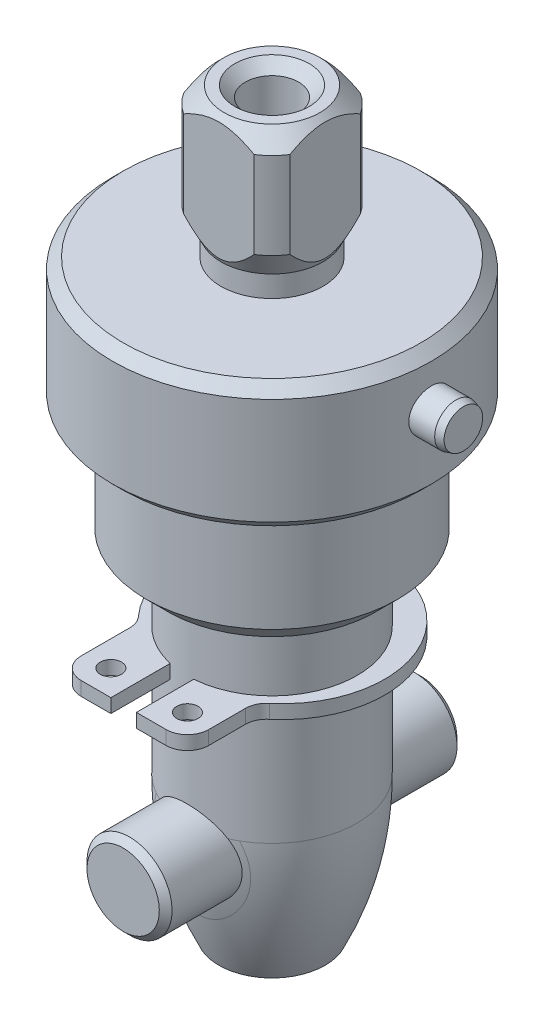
ISO-10303-21;
HEADER;
FILE_DESCRIPTION(('STEP AP214'),'2;1');
FILE_NAME('part.step','',(''),(''),'','','');
FILE_SCHEMA(('AUTOMOTIVE_DESIGN { 1 0 10303 214 1 1 1 1 }'));
ENDSEC;
DATA;
#1=APPLICATION_CONTEXT('core data for automotive mechanical design processes');
#2=APPLICATION_PROTOCOL_DEFINITION('international standard','automotive_design',2000,#1);
#3=PRODUCT_CONTEXT('',#1,'mechanical');
#4=PRODUCT('Part','Part','',(#3));
#5=PRODUCT_RELATED_PRODUCT_CATEGORY('part','',(#4));
#6=PRODUCT_DEFINITION_FORMATION('','',#4);
#7=PRODUCT_DEFINITION_CONTEXT('part definition',#1,'design');
#8=PRODUCT_DEFINITION('design','',#6,#7);
#9=PRODUCT_DEFINITION_SHAPE('','',#8);
#10=(LENGTH_UNIT() NAMED_UNIT(*) SI_UNIT(.MILLI.,.METRE.));
#11=(NAMED_UNIT(*) PLANE_ANGLE_UNIT() SI_UNIT($,.RADIAN.));
#12=(NAMED_UNIT(*) SI_UNIT($,.STERADIAN.) SOLID_ANGLE_UNIT());
#13=UNCERTAINTY_MEASURE_WITH_UNIT(LENGTH_MEASURE(1.E-05),#10,'distance_accuracy_value','');
#14=(GEOMETRIC_REPRESENTATION_CONTEXT(3) GLOBAL_UNCERTAINTY_ASSIGNED_CONTEXT((#13)) GLOBAL_UNIT_ASSIGNED_CONTEXT((#10,
#11,#12)) REPRESENTATION_CONTEXT('',''));
#15=CARTESIAN_POINT('',(0.,0.,0.));
#16=DIRECTION('',(0.,0.,1.));
#17=DIRECTION('',(1.,0.,0.));
#18=AXIS2_PLACEMENT_3D('',#15,#16,#17);
#19=CARTESIAN_POINT('',(-2.29032608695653,7.28825,5.68701804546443));
#20=DIRECTION('',(0.,1.,0.));
#21=DIRECTION('',(0.,0.,1.));
#22=AXIS2_PLACEMENT_3D('',#19,#20,#21);
#23=PLANE('',#22);
#24=CARTESIAN_POINT('',(0.,7.28825,0.));
#25=DIRECTION('',(0.,1.,0.));
#26=DIRECTION('',(0.,0.,1.));
#27=AXIS2_PLACEMENT_3D('',#24,#25,#26);
#28=CIRCLE('',#27,4.);
#29=CARTESIAN_POINT('',(0.30967391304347,7.28825,3.98799474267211));
#30=VERTEX_POINT('',#29);
#31=CARTESIAN_POINT('',(-0.890326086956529,7.28825,3.89965632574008));
#32=VERTEX_POINT('',#31);
#33=EDGE_CURVE('E278',#30,#32,#28,.T.);
#34=ORIENTED_EDGE('',*,*,#33,.F.);
#35=DIRECTION('',(0.,0.,1.));
#36=VECTOR('',#35,1.);
#37=CARTESIAN_POINT('',(0.30967391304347,7.28825,3.68701804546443));
#38=LINE('',#37,#36);
#39=CARTESIAN_POINT('',(0.30967391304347,7.28825,6.68701804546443));
#40=VERTEX_POINT('',#39);
#41=EDGE_CURVE('E310',#30,#40,#38,.T.);
#42=ORIENTED_EDGE('',*,*,#41,.T.);
#43=DIRECTION('',(1.,0.,0.));
#44=VECTOR('',#43,1.);
#45=CARTESIAN_POINT('',(0.30967391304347,7.28825,6.68701804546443));
#46=LINE('',#45,#44);
#47=CARTESIAN_POINT('',(1.70967391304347,7.28825,6.68701804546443));
#48=VERTEX_POINT('',#47);
#49=EDGE_CURVE('E312',#40,#48,#46,.T.);
#50=ORIENTED_EDGE('',*,*,#49,.T.);
#51=CARTESIAN_POINT('',(1.70967391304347,7.28825,5.68701804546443));
#52=DIRECTION('',(0.,1.,0.));
#53=DIRECTION('',(0.,0.,1.));
#54=AXIS2_PLACEMENT_3D('',#51,#52,#53);
#55=CIRCLE('',#54,1.);
#56=CARTESIAN_POINT('',(2.70967391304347,7.28825,5.68701804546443));
#57=VERTEX_POINT('',#56);
#58=EDGE_CURVE('E314',#48,#57,#55,.T.);
#59=ORIENTED_EDGE('',*,*,#58,.T.);
#60=DIRECTION('',(0.,0.,-1.));
#61=VECTOR('',#60,1.);
#62=CARTESIAN_POINT('',(2.70967391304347,7.28825,5.68701804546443));
#63=LINE('',#62,#61);
#64=CARTESIAN_POINT('',(2.70967391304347,7.28825,3.95851090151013));
#65=VERTEX_POINT('',#64);
#66=EDGE_CURVE('E316',#57,#65,#63,.T.);
#67=ORIENTED_EDGE('',*,*,#66,.T.);
#68=CARTESIAN_POINT('',(3.70967391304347,7.28825,3.95851090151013));
#69=DIRECTION('',(0.,-1.,0.));
#70=DIRECTION('',(0.,0.,-1.));
#71=AXIS2_PLACEMENT_3D('',#68,#69,#70);
#72=CIRCLE('',#71,1.);
#73=CARTESIAN_POINT('',(3.07007496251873,7.28825,3.1898021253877));
#74=VERTEX_POINT('',#73);
#75=EDGE_CURVE('E121',#65,#74,#72,.T.);
#76=ORIENTED_EDGE('',*,*,#75,.T.);
#77=CARTESIAN_POINT('',(0.,7.28825,-0.5));
#78=DIRECTION('',(0.,1.,0.));
#79=DIRECTION('',(0.,0.,1.));
#80=AXIS2_PLACEMENT_3D('',#77,#78,#79);
#81=CIRCLE('',#80,4.8);
#82=CARTESIAN_POINT('',(-3.55061469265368,7.28825,2.7300364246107));
#83=VERTEX_POINT('',#82);
#84=EDGE_CURVE('E113',#74,#83,#81,.T.);
#85=ORIENTED_EDGE('',*,*,#84,.T.);
#86=CARTESIAN_POINT('',(-4.29032608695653,7.28825,3.40296067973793));
#87=DIRECTION('',(0.,-1.,0.));
#88=DIRECTION('',(0.,0.,-1.));
#89=AXIS2_PLACEMENT_3D('',#86,#87,#88);
#90=CIRCLE('',#89,1.);
#91=CARTESIAN_POINT('',(-3.29032608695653,7.28825,3.40296067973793));
#92=VERTEX_POINT('',#91);
#93=EDGE_CURVE('E118',#83,#92,#90,.T.);
#94=ORIENTED_EDGE('',*,*,#93,.T.);
#95=DIRECTION('',(0.,0.,1.));
#96=VECTOR('',#95,1.);
#97=CARTESIAN_POINT('',(-3.29032608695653,7.28825,5.68701804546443));
#98=LINE('',#97,#96);
#99=CARTESIAN_POINT('',(-3.29032608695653,7.28825,5.68701804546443));
#100=VERTEX_POINT('',#99);
#101=EDGE_CURVE('E44',#92,#100,#98,.T.);
#102=ORIENTED_EDGE('',*,*,#101,.T.);
#103=CARTESIAN_POINT('',(-2.29032608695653,7.28825,5.68701804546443));
#104=DIRECTION('',(0.,1.,0.));
#105=DIRECTION('',(0.,0.,1.));
#106=AXIS2_PLACEMENT_3D('',#103,#104,#105);
#107=CIRCLE('',#106,1.);
#108=CARTESIAN_POINT('',(-2.29032608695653,7.28825,6.68701804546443));
#109=VERTEX_POINT('',#108);
#110=EDGE_CURVE('E167',#100,#109,#107,.T.);
#111=ORIENTED_EDGE('',*,*,#110,.T.);
#112=DIRECTION('',(1.,0.,0.));
#113=VECTOR('',#112,1.);
#114=CARTESIAN_POINT('',(-0.890326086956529,7.28825,6.68701804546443));
#115=LINE('',#114,#113);
#116=CARTESIAN_POINT('',(-0.890326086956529,7.28825,6.68701804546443));
#117=VERTEX_POINT('',#116);
#118=EDGE_CURVE('E92',#109,#117,#115,.T.);
#119=ORIENTED_EDGE('',*,*,#118,.T.);
#120=DIRECTION('',(0.,0.,-1.));
#121=VECTOR('',#120,1.);
#122=CARTESIAN_POINT('',(-0.890326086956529,7.28825,3.59128381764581));
#123=LINE('',#122,#121);
#124=EDGE_CURVE('E273',#117,#32,#123,.T.);
#125=ORIENTED_EDGE('',*,*,#124,.T.);
#126=EDGE_LOOP('',(#34,#42,#50,#59,#67,#76,#85,#94,#102,#111,#119,#125));
#127=FACE_BOUND('',#126,.T.);
#128=CARTESIAN_POINT('',(-2.09032608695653,7.28825,5.48701804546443));
#129=DIRECTION('',(0.,1.,0.));
#130=DIRECTION('',(0.,0.,1.));
#131=AXIS2_PLACEMENT_3D('',#128,#129,#130);
#132=CIRCLE('',#131,0.5);
#133=CARTESIAN_POINT('',(-2.09032608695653,7.28825,5.98701804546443));
#134=VERTEX_POINT('',#133);
#135=EDGE_CURVE('E147',#134,#134,#132,.T.);
#136=ORIENTED_EDGE('',*,*,#135,.F.);
#137=EDGE_LOOP('',(#136));
#138=FACE_BOUND('',#137,.T.);
#139=CARTESIAN_POINT('',(1.50967391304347,7.28825,5.48701804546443));
#140=DIRECTION('',(0.,1.,0.));
#141=DIRECTION('',(0.,0.,1.));
#142=AXIS2_PLACEMENT_3D('',#139,#140,#141);
#143=CIRCLE('',#142,0.5);
#144=CARTESIAN_POINT('',(1.50967391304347,7.28825,5.98701804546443));
#145=VERTEX_POINT('',#144);
#146=EDGE_CURVE('E295',#145,#145,#143,.T.);
#147=ORIENTED_EDGE('',*,*,#146,.F.);
#148=EDGE_LOOP('',(#147));
#149=FACE_BOUND('',#148,.T.);
#150=ADVANCED_FACE('F17',(#127,#138,#149),#23,.T.);
#151=CARTESIAN_POINT('',(-2.29032608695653,6.63825,5.68701804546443));
#152=DIRECTION('',(0.,1.,0.));
#153=DIRECTION('',(0.,0.,1.));
#154=AXIS2_PLACEMENT_3D('',#151,#152,#153);
#155=PLANE('',#154);
#156=CARTESIAN_POINT('',(-2.09032608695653,6.63825,5.48701804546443));
#157=DIRECTION('',(0.,1.,0.));
#158=DIRECTION('',(0.,0.,1.));
#159=AXIS2_PLACEMENT_3D('',#156,#157,#158);
#160=CIRCLE('',#159,0.5);
#161=CARTESIAN_POINT('',(-2.09032608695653,6.63825,5.98701804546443));
#162=VERTEX_POINT('',#161);
#163=EDGE_CURVE('E298',#162,#162,#160,.T.);
#164=ORIENTED_EDGE('',*,*,#163,.T.);
#165=EDGE_LOOP('',(#164));
#166=FACE_BOUND('',#165,.T.);
#167=DIRECTION('',(0.,0.,1.));
#168=VECTOR('',#167,1.);
#169=CARTESIAN_POINT('',(0.30967391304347,6.63825,3.68701804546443));
#170=LINE('',#169,#168);
#171=CARTESIAN_POINT('',(0.30967391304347,6.63825,3.98799474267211));
#172=VERTEX_POINT('',#171);
#173=CARTESIAN_POINT('',(0.30967391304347,6.63825,6.68701804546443));
#174=VERTEX_POINT('',#173);
#175=EDGE_CURVE('E152',#172,#174,#170,.T.);
#176=ORIENTED_EDGE('',*,*,#175,.F.);
#177=CARTESIAN_POINT('',(0.,6.63825,0.));
#178=DIRECTION('',(0.,1.,0.));
#179=DIRECTION('',(0.,0.,1.));
#180=AXIS2_PLACEMENT_3D('',#177,#178,#179);
#181=CIRCLE('',#180,4.);
#182=CARTESIAN_POINT('',(-0.890326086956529,6.63825,3.89965632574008));
#183=VERTEX_POINT('',#182);
#184=EDGE_CURVE('E36',#172,#183,#181,.T.);
#185=ORIENTED_EDGE('',*,*,#184,.T.);
#186=DIRECTION('',(0.,0.,-1.));
#187=VECTOR('',#186,1.);
#188=CARTESIAN_POINT('',(-0.890326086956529,6.63825,3.59128381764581));
#189=LINE('',#188,#187);
#190=CARTESIAN_POINT('',(-0.890326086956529,6.63825,6.68701804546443));
#191=VERTEX_POINT('',#190);
#192=EDGE_CURVE('E149',#191,#183,#189,.T.);
#193=ORIENTED_EDGE('',*,*,#192,.F.);
#194=DIRECTION('',(1.,0.,0.));
#195=VECTOR('',#194,1.);
#196=CARTESIAN_POINT('',(-0.890326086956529,6.63825,6.68701804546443));
#197=LINE('',#196,#195);
#198=CARTESIAN_POINT('',(-2.29032608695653,6.63825,6.68701804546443));
#199=VERTEX_POINT('',#198);
#200=EDGE_CURVE('E146',#199,#191,#197,.T.);
#201=ORIENTED_EDGE('',*,*,#200,.F.);
#202=CARTESIAN_POINT('',(-2.29032608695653,6.63825,5.68701804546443));
#203=DIRECTION('',(0.,1.,0.));
#204=DIRECTION('',(0.,0.,1.));
#205=AXIS2_PLACEMENT_3D('',#202,#203,#204);
#206=CIRCLE('',#205,1.);
#207=CARTESIAN_POINT('',(-3.29032608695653,6.63825,5.68701804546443));
#208=VERTEX_POINT('',#207);
#209=EDGE_CURVE('E143',#208,#199,#206,.T.);
#210=ORIENTED_EDGE('',*,*,#209,.F.);
#211=DIRECTION('',(0.,0.,1.));
#212=VECTOR('',#211,1.);
#213=CARTESIAN_POINT('',(-3.29032608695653,6.63825,5.68701804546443));
#214=LINE('',#213,#212);
#215=CARTESIAN_POINT('',(-3.29032608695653,6.63825,3.40296067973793));
#216=VERTEX_POINT('',#215);
#217=EDGE_CURVE('E83',#216,#208,#214,.T.);
#218=ORIENTED_EDGE('',*,*,#217,.F.);
#219=CARTESIAN_POINT('',(-4.29032608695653,6.63825,3.40296067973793));
#220=DIRECTION('',(0.,-1.,0.));
#221=DIRECTION('',(0.,0.,-1.));
#222=AXIS2_PLACEMENT_3D('',#219,#220,#221);
#223=CIRCLE('',#222,1.);
#224=CARTESIAN_POINT('',(-3.55061469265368,6.63825,2.7300364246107));
#225=VERTEX_POINT('',#224);
#226=EDGE_CURVE('E164',#225,#216,#223,.T.);
#227=ORIENTED_EDGE('',*,*,#226,.F.);
#228=CARTESIAN_POINT('',(0.,6.63825,-0.5));
#229=DIRECTION('',(0.,1.,0.));
#230=DIRECTION('',(0.,0.,1.));
#231=AXIS2_PLACEMENT_3D('',#228,#229,#230);
#232=CIRCLE('',#231,4.8);
#233=CARTESIAN_POINT('',(3.07007496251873,6.63825,3.1898021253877));
#234=VERTEX_POINT('',#233);
#235=EDGE_CURVE('E131',#234,#225,#232,.T.);
#236=ORIENTED_EDGE('',*,*,#235,.F.);
#237=CARTESIAN_POINT('',(3.70967391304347,6.63825,3.95851090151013));
#238=DIRECTION('',(0.,-1.,0.));
#239=DIRECTION('',(0.,0.,-1.));
#240=AXIS2_PLACEMENT_3D('',#237,#238,#239);
#241=CIRCLE('',#240,1.);
#242=CARTESIAN_POINT('',(2.70967391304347,6.63825,3.95851090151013));
#243=VERTEX_POINT('',#242);
#244=EDGE_CURVE('E160',#243,#234,#241,.T.);
#245=ORIENTED_EDGE('',*,*,#244,.F.);
#246=DIRECTION('',(0.,0.,-1.));
#247=VECTOR('',#246,1.);
#248=CARTESIAN_POINT('',(2.70967391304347,6.63825,5.68701804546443));
#249=LINE('',#248,#247);
#250=CARTESIAN_POINT('',(2.70967391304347,6.63825,5.68701804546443));
#251=VERTEX_POINT('',#250);
#252=EDGE_CURVE('E158',#251,#243,#249,.T.);
#253=ORIENTED_EDGE('',*,*,#252,.F.);
#254=CARTESIAN_POINT('',(1.70967391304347,6.63825,5.68701804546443));
#255=DIRECTION('',(0.,1.,0.));
#256=DIRECTION('',(0.,0.,1.));
#257=AXIS2_PLACEMENT_3D('',#254,#255,#256);
#258=CIRCLE('',#257,1.);
#259=CARTESIAN_POINT('',(1.70967391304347,6.63825,6.68701804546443));
#260=VERTEX_POINT('',#259);
#261=EDGE_CURVE('E156',#260,#251,#258,.T.);
#262=ORIENTED_EDGE('',*,*,#261,.F.);
#263=DIRECTION('',(1.,0.,0.));
#264=VECTOR('',#263,1.);
#265=CARTESIAN_POINT('',(0.30967391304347,6.63825,6.68701804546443));
#266=LINE('',#265,#264);
#267=EDGE_CURVE('E154',#174,#260,#266,.T.);
#268=ORIENTED_EDGE('',*,*,#267,.F.);
#269=EDGE_LOOP('',(#176,#185,#193,#201,#210,#218,#227,#236,#245,#253,#262,#268));
#270=FACE_BOUND('',#269,.T.);
#271=CARTESIAN_POINT('',(1.50967391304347,6.63825,5.48701804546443));
#272=DIRECTION('',(0.,1.,0.));
#273=DIRECTION('',(0.,0.,1.));
#274=AXIS2_PLACEMENT_3D('',#271,#272,#273);
#275=CIRCLE('',#274,0.5);
#276=CARTESIAN_POINT('',(1.50967391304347,6.63825,5.98701804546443));
#277=VERTEX_POINT('',#276);
#278=EDGE_CURVE('E294',#277,#277,#275,.T.);
#279=ORIENTED_EDGE('',*,*,#278,.T.);
#280=EDGE_LOOP('',(#279));
#281=FACE_BOUND('',#280,.T.);
#282=ADVANCED_FACE('F224',(#166,#270,#281),#155,.F.);
#283=CARTESIAN_POINT('',(-2.29032608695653,7.28825,5.68701804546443));
#284=DIRECTION('',(0.,-1.,0.));
#285=DIRECTION('',(0.,0.,-1.));
#286=AXIS2_PLACEMENT_3D('',#283,#284,#285);
#287=CYLINDRICAL_SURFACE('',#286,1.);
#288=ORIENTED_EDGE('',*,*,#209,.T.);
#289=DIRECTION('',(0.,-1.,0.));
#290=VECTOR('',#289,1.);
#291=CARTESIAN_POINT('',(-2.29032608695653,7.28825,6.68701804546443));
#292=LINE('',#291,#290);
#293=EDGE_CURVE('E28',#109,#199,#292,.T.);
#294=ORIENTED_EDGE('',*,*,#293,.F.);
#295=ORIENTED_EDGE('',*,*,#110,.F.);
#296=DIRECTION('',(0.,-1.,0.));
#297=VECTOR('',#296,1.);
#298=CARTESIAN_POINT('',(-3.29032608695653,7.28825,5.68701804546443));
#299=LINE('',#298,#297);
#300=EDGE_CURVE('E139',#100,#208,#299,.T.);
#301=ORIENTED_EDGE('',*,*,#300,.T.);
#302=EDGE_LOOP('',(#288,#294,#295,#301));
#303=FACE_BOUND('',#302,.T.);
#304=ADVANCED_FACE('F19',(#303),#287,.T.);
#305=CARTESIAN_POINT('',(-0.890326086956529,7.28825,6.68701804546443));
#306=DIRECTION('',(0.,0.,-1.));
#307=DIRECTION('',(-1.,0.,0.));
#308=AXIS2_PLACEMENT_3D('',#305,#306,#307);
#309=PLANE('',#308);
#310=ORIENTED_EDGE('',*,*,#200,.T.);
#311=DIRECTION('',(0.,-1.,0.));
#312=VECTOR('',#311,1.);
#313=CARTESIAN_POINT('',(-0.890326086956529,7.28825,6.68701804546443));
#314=LINE('',#313,#312);
#315=EDGE_CURVE('E183',#117,#191,#314,.T.);
#316=ORIENTED_EDGE('',*,*,#315,.F.);
#317=ORIENTED_EDGE('',*,*,#118,.F.);
#318=ORIENTED_EDGE('',*,*,#293,.T.);
#319=EDGE_LOOP('',(#310,#316,#317,#318));
#320=FACE_BOUND('',#319,.T.);
#321=ADVANCED_FACE('F256',(#320),#309,.F.);
#322=CARTESIAN_POINT('',(-0.890326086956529,7.28825,3.59128381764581));
#323=DIRECTION('',(-1.,0.,0.));
#324=DIRECTION('',(0.,0.,1.));
#325=AXIS2_PLACEMENT_3D('',#322,#323,#324);
#326=PLANE('',#325);
#327=ORIENTED_EDGE('',*,*,#192,.T.);
#328=DIRECTION('',(0.,-1.,0.));
#329=VECTOR('',#328,1.);
#330=CARTESIAN_POINT('',(-0.890326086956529,0.,3.89965632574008));
#331=LINE('',#330,#329);
#332=EDGE_CURVE('E282',#183,#32,#331,.F.);
#333=ORIENTED_EDGE('',*,*,#332,.T.);
#334=ORIENTED_EDGE('',*,*,#124,.F.);
#335=ORIENTED_EDGE('',*,*,#315,.T.);
#336=EDGE_LOOP('',(#327,#333,#334,#335));
#337=FACE_BOUND('',#336,.T.);
#338=ADVANCED_FACE('F253',(#337),#326,.F.);
#339=CARTESIAN_POINT('',(0.30967391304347,7.28825,3.68701804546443));
#340=DIRECTION('',(1.,0.,0.));
#341=DIRECTION('',(0.,0.,-1.));
#342=AXIS2_PLACEMENT_3D('',#339,#340,#341);
#343=PLANE('',#342);
#344=ORIENTED_EDGE('',*,*,#41,.F.);
#345=DIRECTION('',(0.,-1.,0.));
#346=VECTOR('',#345,1.);
#347=CARTESIAN_POINT('',(0.30967391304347,0.,3.98799474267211));
#348=LINE('',#347,#346);
#349=EDGE_CURVE('E11',#30,#172,#348,.T.);
#350=ORIENTED_EDGE('',*,*,#349,.T.);
#351=ORIENTED_EDGE('',*,*,#175,.T.);
#352=DIRECTION('',(0.,-1.,0.));
#353=VECTOR('',#352,1.);
#354=CARTESIAN_POINT('',(0.30967391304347,7.28825,6.68701804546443));
#355=LINE('',#354,#353);
#356=EDGE_CURVE('E180',#40,#174,#355,.T.);
#357=ORIENTED_EDGE('',*,*,#356,.F.);
#358=EDGE_LOOP('',(#344,#350,#351,#357));
#359=FACE_BOUND('',#358,.T.);
#360=ADVANCED_FACE('F249',(#359),#343,.F.);
#361=CARTESIAN_POINT('',(0.30967391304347,7.28825,6.68701804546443));
#362=DIRECTION('',(0.,0.,-1.));
#363=DIRECTION('',(-1.,0.,0.));
#364=AXIS2_PLACEMENT_3D('',#361,#362,#363);
#365=PLANE('',#364);
#366=ORIENTED_EDGE('',*,*,#267,.T.);
#367=DIRECTION('',(0.,-1.,0.));
#368=VECTOR('',#367,1.);
#369=CARTESIAN_POINT('',(1.70967391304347,7.28825,6.68701804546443));
#370=LINE('',#369,#368);
#371=EDGE_CURVE('E177',#48,#260,#370,.T.);
#372=ORIENTED_EDGE('',*,*,#371,.F.);
#373=ORIENTED_EDGE('',*,*,#49,.F.);
#374=ORIENTED_EDGE('',*,*,#356,.T.);
#375=EDGE_LOOP('',(#366,#372,#373,#374));
#376=FACE_BOUND('',#375,.T.);
#377=ADVANCED_FACE('F245',(#376),#365,.F.);
#378=CARTESIAN_POINT('',(1.70967391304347,7.28825,5.68701804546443));
#379=DIRECTION('',(0.,-1.,0.));
#380=DIRECTION('',(0.,0.,-1.));
#381=AXIS2_PLACEMENT_3D('',#378,#379,#380);
#382=CYLINDRICAL_SURFACE('',#381,1.);
#383=ORIENTED_EDGE('',*,*,#261,.T.);
#384=DIRECTION('',(0.,-1.,0.));
#385=VECTOR('',#384,1.);
#386=CARTESIAN_POINT('',(2.70967391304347,7.28825,5.68701804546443));
#387=LINE('',#386,#385);
#388=EDGE_CURVE('E174',#57,#251,#387,.T.);
#389=ORIENTED_EDGE('',*,*,#388,.F.);
#390=ORIENTED_EDGE('',*,*,#58,.F.);
#391=ORIENTED_EDGE('',*,*,#371,.T.);
#392=EDGE_LOOP('',(#383,#389,#390,#391));
#393=FACE_BOUND('',#392,.T.);
#394=ADVANCED_FACE('F241',(#393),#382,.T.);
#395=CARTESIAN_POINT('',(2.70967391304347,7.28825,5.68701804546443));
#396=DIRECTION('',(-1.,0.,0.));
#397=DIRECTION('',(0.,0.,1.));
#398=AXIS2_PLACEMENT_3D('',#395,#396,#397);
#399=PLANE('',#398);
#400=ORIENTED_EDGE('',*,*,#252,.T.);
#401=DIRECTION('',(0.,-1.,0.));
#402=VECTOR('',#401,1.);
#403=CARTESIAN_POINT('',(2.70967391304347,7.28825,3.95851090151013));
#404=LINE('',#403,#402);
#405=EDGE_CURVE('E171',#65,#243,#404,.T.);
#406=ORIENTED_EDGE('',*,*,#405,.F.);
#407=ORIENTED_EDGE('',*,*,#66,.F.);
#408=ORIENTED_EDGE('',*,*,#388,.T.);
#409=EDGE_LOOP('',(#400,#406,#407,#408));
#410=FACE_BOUND('',#409,.T.);
#411=ADVANCED_FACE('F237',(#410),#399,.F.);
#412=CARTESIAN_POINT('',(3.70967391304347,7.28825,3.95851090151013));
#413=DIRECTION('',(0.,-1.,0.));
#414=DIRECTION('',(0.,0.,-1.));
#415=AXIS2_PLACEMENT_3D('',#412,#413,#414);
#416=CYLINDRICAL_SURFACE('',#415,1.);
#417=ORIENTED_EDGE('',*,*,#244,.T.);
#418=DIRECTION('',(0.,-1.,0.));
#419=VECTOR('',#418,1.);
#420=CARTESIAN_POINT('',(3.07007496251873,7.28825,3.1898021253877));
#421=LINE('',#420,#419);
#422=EDGE_CURVE('E134',#74,#234,#421,.T.);
#423=ORIENTED_EDGE('',*,*,#422,.F.);
#424=ORIENTED_EDGE('',*,*,#75,.F.);
#425=ORIENTED_EDGE('',*,*,#405,.T.);
#426=EDGE_LOOP('',(#417,#423,#424,#425));
#427=FACE_BOUND('',#426,.T.);
#428=ADVANCED_FACE('F234',(#427),#416,.F.);
#429=CARTESIAN_POINT('',(0.,7.28825,-0.5));
#430=DIRECTION('',(0.,-1.,0.));
#431=DIRECTION('',(0.,0.,-1.));
#432=AXIS2_PLACEMENT_3D('',#429,#430,#431);
#433=CYLINDRICAL_SURFACE('',#432,4.8);
#434=ORIENTED_EDGE('',*,*,#235,.T.);
#435=DIRECTION('',(0.,-1.,0.));
#436=VECTOR('',#435,1.);
#437=CARTESIAN_POINT('',(-3.55061469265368,7.28825,2.7300364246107));
#438=LINE('',#437,#436);
#439=EDGE_CURVE('E128',#83,#225,#438,.T.);
#440=ORIENTED_EDGE('',*,*,#439,.F.);
#441=ORIENTED_EDGE('',*,*,#84,.F.);
#442=ORIENTED_EDGE('',*,*,#422,.T.);
#443=EDGE_LOOP('',(#434,#440,#441,#442));
#444=FACE_BOUND('',#443,.T.);
#445=ADVANCED_FACE('F129',(#444),#433,.T.);
#446=CARTESIAN_POINT('',(-4.29032608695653,7.28825,3.40296067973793));
#447=DIRECTION('',(0.,-1.,0.));
#448=DIRECTION('',(0.,0.,-1.));
#449=AXIS2_PLACEMENT_3D('',#446,#447,#448);
#450=CYLINDRICAL_SURFACE('',#449,1.);
#451=ORIENTED_EDGE('',*,*,#226,.T.);
#452=DIRECTION('',(0.,-1.,0.));
#453=VECTOR('',#452,1.);
#454=CARTESIAN_POINT('',(-3.29032608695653,7.28825,3.40296067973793));
#455=LINE('',#454,#453);
#456=EDGE_CURVE('E135',#92,#216,#455,.T.);
#457=ORIENTED_EDGE('',*,*,#456,.F.);
#458=ORIENTED_EDGE('',*,*,#93,.F.);
#459=ORIENTED_EDGE('',*,*,#439,.T.);
#460=EDGE_LOOP('',(#451,#457,#458,#459));
#461=FACE_BOUND('',#460,.T.);
#462=ADVANCED_FACE('F137',(#461),#450,.F.);
#463=CARTESIAN_POINT('',(-3.29032608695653,7.28825,5.68701804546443));
#464=DIRECTION('',(1.,0.,0.));
#465=DIRECTION('',(0.,0.,-1.));
#466=AXIS2_PLACEMENT_3D('',#463,#464,#465);
#467=PLANE('',#466);
#468=ORIENTED_EDGE('',*,*,#217,.T.);
#469=ORIENTED_EDGE('',*,*,#300,.F.);
#470=ORIENTED_EDGE('',*,*,#101,.F.);
#471=ORIENTED_EDGE('',*,*,#456,.T.);
#472=EDGE_LOOP('',(#468,#469,#470,#471));
#473=FACE_BOUND('',#472,.T.);
#474=ADVANCED_FACE('F220',(#473),#467,.F.);
#475=CARTESIAN_POINT('',(-2.09032608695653,7.28825,5.48701804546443));
#476=DIRECTION('',(0.,-1.,0.));
#477=DIRECTION('',(0.,0.,-1.));
#478=AXIS2_PLACEMENT_3D('',#475,#476,#477);
#479=CYLINDRICAL_SURFACE('',#478,0.5);
#480=ORIENTED_EDGE('',*,*,#135,.T.);
#481=EDGE_LOOP('',(#480));
#482=FACE_BOUND('',#481,.T.);
#483=ORIENTED_EDGE('',*,*,#163,.F.);
#484=EDGE_LOOP('',(#483));
#485=FACE_BOUND('',#484,.T.);
#486=ADVANCED_FACE('F216',(#482,#485),#479,.F.);
#487=CARTESIAN_POINT('',(1.50967391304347,7.28825,5.48701804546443));
#488=DIRECTION('',(0.,-1.,0.));
#489=DIRECTION('',(0.,0.,-1.));
#490=AXIS2_PLACEMENT_3D('',#487,#488,#489);
#491=CYLINDRICAL_SURFACE('',#490,0.5);
#492=ORIENTED_EDGE('',*,*,#146,.T.);
#493=EDGE_LOOP('',(#492));
#494=FACE_BOUND('',#493,.T.);
#495=ORIENTED_EDGE('',*,*,#278,.F.);
#496=EDGE_LOOP('',(#495));
#497=FACE_BOUND('',#496,.T.);
#498=ADVANCED_FACE('F210',(#494,#497),#491,.F.);
#499=CARTESIAN_POINT('',(0.,0.,0.));
#500=DIRECTION('',(0.,-1.,0.));
#501=DIRECTION('',(0.,0.,-1.));
#502=AXIS2_PLACEMENT_3D('',#499,#500,#501);
#503=CYLINDRICAL_SURFACE('',#502,4.);
#504=ORIENTED_EDGE('',*,*,#184,.F.);
#505=ORIENTED_EDGE('',*,*,#349,.F.);
#506=ORIENTED_EDGE('',*,*,#33,.T.);
#507=ORIENTED_EDGE('',*,*,#332,.F.);
#508=EDGE_LOOP('',(#504,#505,#506,#507));
#509=FACE_BOUND('',#508,.T.);
#510=CARTESIAN_POINT('',(0.,1.27825,0.));
#511=DIRECTION('',(0.,1.,0.));
#512=DIRECTION('',(-0.489029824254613,0.,-0.872267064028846));
#513=AXIS2_PLACEMENT_3D('',#510,#511,#512);
#514=CIRCLE('',#513,4.);
#515=CARTESIAN_POINT('',(-1.95626063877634,1.27763442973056,-3.48898900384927));
#516=VERTEX_POINT('',#515);
#517=CARTESIAN_POINT('',(-1.95626063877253,1.27763442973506,3.4889890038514));
#518=VERTEX_POINT('',#517);
#519=EDGE_CURVE('E194',#516,#518,#514,.T.);
#520=ORIENTED_EDGE('',*,*,#519,.T.);
#521=CARTESIAN_POINT('',(0.,1.27825,0.));
#522=DIRECTION('',(0.,-1.,0.));
#523=DIRECTION('',(0.,0.,-1.));
#524=AXIS2_PLACEMENT_3D('',#521,#522,#523);
#525=CIRCLE('',#524,4.);
#526=CARTESIAN_POINT('',(-1.59245094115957,1.27825,3.66934599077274));
#527=VERTEX_POINT('',#526);
#528=EDGE_CURVE('E832',#527,#518,#525,.T.);
#529=ORIENTED_EDGE('',*,*,#528,.F.);
#530=CARTESIAN_POINT('',(0.,2.06825,4.));
#531=CARTESIAN_POINT('',(-0.105143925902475,2.06824339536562,3.99999426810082));
#532=CARTESIAN_POINT('',(-0.210413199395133,2.05990985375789,3.99580982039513));
#533=CARTESIAN_POINT('',(-0.417840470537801,2.02694423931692,3.97948312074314));
#534=CARTESIAN_POINT('',(-0.519992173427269,2.00228121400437,3.96732575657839));
#535=CARTESIAN_POINT('',(-0.717867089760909,1.93786238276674,3.93632558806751));
#536=CARTESIAN_POINT('',(-0.813613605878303,1.89816523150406,3.91750878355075));
#537=CARTESIAN_POINT('',(-0.996945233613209,1.80510875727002,3.87491553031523));
#538=CARTESIAN_POINT('',(-1.08453098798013,1.75175051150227,3.8511394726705));
#539=CARTESIAN_POINT('',(-1.25501563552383,1.62921550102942,3.79912516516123));
#540=CARTESIAN_POINT('',(-1.33731042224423,1.55927704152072,3.77070398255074));
#541=CARTESIAN_POINT('',(-1.48955888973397,1.40720704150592,3.71319940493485));
#542=CARTESIAN_POINT('',(-1.55950316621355,1.32506629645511,3.68411552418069));
#543=CARTESIAN_POINT('',(-1.69050400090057,1.14328330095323,3.62597902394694));
#544=CARTESIAN_POINT('',(-1.75045067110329,1.04277780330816,3.59710373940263));
#545=CARTESIAN_POINT('',(-1.8523364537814,0.831515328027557,3.5457195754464));
#546=CARTESIAN_POINT('',(-1.89428842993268,0.720765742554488,3.52320615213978));
#547=CARTESIAN_POINT('',(-1.95626488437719,0.498919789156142,3.48915734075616));
#548=CARTESIAN_POINT('',(-1.97745171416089,0.388241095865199,3.47704543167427));
#549=CARTESIAN_POINT('',(-2.0008539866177,0.164292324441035,3.46363779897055));
#550=CARTESIAN_POINT('',(-2.00308817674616,0.0510249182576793,3.46233138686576));
#551=CARTESIAN_POINT('',(-1.98937457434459,-0.160322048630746,3.47021860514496));
#552=CARTESIAN_POINT('',(-1.97556911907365,-0.258598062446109,3.47817527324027));
#553=CARTESIAN_POINT('',(-1.93387969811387,-0.45119381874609,3.501524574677));
#554=CARTESIAN_POINT('',(-1.90599124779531,-0.545512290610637,3.51691957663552));
#555=CARTESIAN_POINT('',(-1.83641956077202,-0.730208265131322,3.55374952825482));
#556=CARTESIAN_POINT('',(-1.794430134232,-0.82044279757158,3.57531681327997));
#557=CARTESIAN_POINT('',(-1.69808337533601,-0.993018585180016,3.62206808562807));
#558=CARTESIAN_POINT('',(-1.64372048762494,-1.07535627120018,3.64725369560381));
#559=CARTESIAN_POINT('',(-1.51613210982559,-1.24079250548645,3.70226315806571));
#560=CARTESIAN_POINT('',(-1.44138891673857,-1.32266374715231,3.73227020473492));
#561=CARTESIAN_POINT('',(-1.27911115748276,-1.4732208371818,3.79095246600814));
#562=CARTESIAN_POINT('',(-1.19157051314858,-1.54190038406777,3.81962703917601));
#563=CARTESIAN_POINT('',(-1.00103301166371,-1.66712132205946,3.87403974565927));
#564=CARTESIAN_POINT('',(-0.897507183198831,-1.72295094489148,3.89957968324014));
#565=CARTESIAN_POINT('',(-0.680932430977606,-1.81594405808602,3.94315762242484));
#566=CARTESIAN_POINT('',(-0.567891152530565,-1.85312237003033,3.96120157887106));
#567=CARTESIAN_POINT('',(-0.345532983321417,-1.90470080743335,3.98648667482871));
#568=CARTESIAN_POINT('',(-0.236683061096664,-1.92073247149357,3.9944987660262));
#569=CARTESIAN_POINT('',(-0.0175591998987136,-1.93467946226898,4.00146026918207));
#570=CARTESIAN_POINT('',(0.0927140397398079,-1.93260337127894,4.00041397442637));
#571=CARTESIAN_POINT('',(0.302465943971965,-1.91133662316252,3.9898238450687));
#572=CARTESIAN_POINT('',(0.402118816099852,-1.89348493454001,3.98094491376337));
#573=CARTESIAN_POINT('',(0.596813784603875,-1.84327385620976,3.95644342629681));
#574=CARTESIAN_POINT('',(0.691855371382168,-1.81091286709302,3.94082012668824));
#575=CARTESIAN_POINT('',(0.87777721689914,-1.73175306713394,3.90368502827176));
#576=CARTESIAN_POINT('',(0.968460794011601,-1.68456789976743,3.88201763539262));
#577=CARTESIAN_POINT('',(1.14092272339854,-1.57753492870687,3.83487948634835));
#578=CARTESIAN_POINT('',(1.22269725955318,-1.51768173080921,3.80940711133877));
#579=CARTESIAN_POINT('',(1.38353537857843,-1.38022914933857,3.75416442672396));
#580=CARTESIAN_POINT('',(1.46154415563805,-1.3014642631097,3.72421769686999));
#581=CARTESIAN_POINT('',(1.60371264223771,-1.13189969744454,3.6652478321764));
#582=CARTESIAN_POINT('',(1.66786277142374,-1.04109176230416,3.63622534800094));
#583=CARTESIAN_POINT('',(1.78341582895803,-0.844462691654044,3.58102384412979));
#584=CARTESIAN_POINT('',(1.83405099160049,-0.738127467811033,3.55505059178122));
#585=CARTESIAN_POINT('',(1.9161656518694,-0.516729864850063,3.5114814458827));
#586=CARTESIAN_POINT('',(1.94766983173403,-0.401678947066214,3.493874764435));
#587=CARTESIAN_POINT('',(1.98772337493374,-0.177929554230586,3.47123002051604));
#588=CARTESIAN_POINT('',(1.9981859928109,-0.0696814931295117,3.4651476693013));
#589=CARTESIAN_POINT('',(2.0013783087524,0.147144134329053,3.46330709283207));
#590=CARTESIAN_POINT('',(1.99411569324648,0.255721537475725,3.4675443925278));
#591=CARTESIAN_POINT('',(1.96385225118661,0.459217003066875,3.48475724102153));
#592=CARTESIAN_POINT('',(1.94241662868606,0.554450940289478,3.49686188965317));
#593=CARTESIAN_POINT('',(1.88635071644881,0.739866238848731,3.52742032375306));
#594=CARTESIAN_POINT('',(1.85171618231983,0.83004596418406,3.54587615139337));
#595=CARTESIAN_POINT('',(1.76763149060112,1.00949970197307,3.58857060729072));
#596=CARTESIAN_POINT('',(1.71734227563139,1.09830580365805,3.61311444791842));
#597=CARTESIAN_POINT('',(1.60430194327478,1.26679907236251,3.66470663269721));
#598=CARTESIAN_POINT('',(1.54154434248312,1.34648146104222,3.69175627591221));
#599=CARTESIAN_POINT('',(1.39640665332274,1.50453396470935,3.74924646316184));
#600=CARTESIAN_POINT('',(1.31256884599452,1.58156820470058,3.77969966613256));
#601=CARTESIAN_POINT('',(1.13230961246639,1.72077596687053,3.83755504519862));
#602=CARTESIAN_POINT('',(1.03588144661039,1.78294147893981,3.8649555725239));
#603=CARTESIAN_POINT('',(0.831863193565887,1.89072272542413,3.91396019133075));
#604=CARTESIAN_POINT('',(0.724199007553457,1.93621833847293,3.93552192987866));
#605=CARTESIAN_POINT('',(0.501484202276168,2.00786633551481,3.97002682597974));
#606=CARTESIAN_POINT('',(0.386455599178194,2.03407369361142,3.98299446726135));
#607=CARTESIAN_POINT('',(0.225203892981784,2.05604482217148,3.99390923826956));
#608=CARTESIAN_POINT('',(0.180323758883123,2.06061528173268,3.99618730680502));
#609=CARTESIAN_POINT('',(0.0903034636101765,2.06671933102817,3.99923393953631));
#610=CARTESIAN_POINT('',(0.0451632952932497,2.06825283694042,4.00000246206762));
#611=CARTESIAN_POINT('',(0.,2.06825,4.));
#612=B_SPLINE_CURVE_WITH_KNOTS('',3,(#530,#531,#532,#533,#534,#535,#536,#537,#538,#539,#540,
#541,#542,#543,#544,#545,#546,#547,#548,#549,#550,#551,#552,#553,#554,#555,#556,#557,#558,#559,
#560,#561,#562,#563,#564,#565,#566,#567,#568,#569,#570,#571,#572,#573,#574,#575,#576,#577,#578,
#579,#580,#581,#582,#583,#584,#585,#586,#587,#588,#589,#590,#591,#592,#593,#594,#595,#596,#597,
#598,#599,#600,#601,#602,#603,#604,#605,#606,#607,#608,#609,#610,#611),.UNSPECIFIED.,.T.,.F.,(4,
2,2,2,2,2,2,2,2,2,2,2,2,2,2,2,2,2,2,2,2,2,2,2,2,2,2,2,2,2,2,2,2,2,2,2,2,2,2,2,4),(0.,
0.315248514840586,0.631096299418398,0.945724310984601,1.26032752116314,1.59396351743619,
1.92785247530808,2.28763452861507,2.64715895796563,2.9851602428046,3.32282714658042,
3.62011424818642,3.91749607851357,4.22180480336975,4.52625042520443,4.86929882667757,
5.21251069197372,5.57166044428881,5.93052433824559,6.25966580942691,6.58865129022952,
6.89213813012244,7.19565843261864,7.50785712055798,7.82018901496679,8.16319221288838,
8.50643177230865,8.86629364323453,9.22569023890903,9.55058615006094,9.87534119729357,
10.1691586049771,10.463070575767,10.7767291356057,11.0905512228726,11.4425048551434,
11.7946476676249,12.1492802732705,12.502898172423,12.6383056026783,12.7737167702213),.UNSPECIFIED.);
#613=CARTESIAN_POINT('',(1.59245094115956,1.27825,3.66934599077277));
#614=VERTEX_POINT('',#613);
#615=EDGE_CURVE('E285',#614,#527,#612,.T.);
#616=ORIENTED_EDGE('',*,*,#615,.F.);
#617=CARTESIAN_POINT('',(1.95626063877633,1.27763442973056,3.48898900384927));
#618=VERTEX_POINT('',#617);
#619=EDGE_CURVE('E831',#618,#614,#525,.T.);
#620=ORIENTED_EDGE('',*,*,#619,.F.);
#621=CARTESIAN_POINT('',(0.,1.27825,0.));
#622=DIRECTION('',(0.,1.,0.));
#623=DIRECTION('',(0.489029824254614,0.,0.872267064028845));
#624=AXIS2_PLACEMENT_3D('',#621,#622,#623);
#625=CIRCLE('',#624,4.);
#626=CARTESIAN_POINT('',(1.95626063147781,1.27763442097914,-3.48898900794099));
#627=VERTEX_POINT('',#626);
#628=EDGE_CURVE('E893',#618,#627,#625,.T.);
#629=ORIENTED_EDGE('',*,*,#628,.T.);
#630=CARTESIAN_POINT('',(1.59245094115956,1.27825,-3.66934599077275));
#631=VERTEX_POINT('',#630);
#632=EDGE_CURVE('E828',#631,#627,#525,.T.);
#633=ORIENTED_EDGE('',*,*,#632,.F.);
#634=CARTESIAN_POINT('',(0.,2.06825,-4.));
#635=CARTESIAN_POINT('',(0.105143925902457,2.06824339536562,-3.99999426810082));
#636=CARTESIAN_POINT('',(0.210413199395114,2.05990985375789,-3.99580982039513));
#637=CARTESIAN_POINT('',(0.417840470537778,2.02694423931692,-3.97948312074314));
#638=CARTESIAN_POINT('',(0.519992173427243,2.00228121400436,-3.96732575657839));
#639=CARTESIAN_POINT('',(0.71786708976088,1.93786238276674,-3.93632558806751));
#640=CARTESIAN_POINT('',(0.813613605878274,1.89816523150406,-3.91750878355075));
#641=CARTESIAN_POINT('',(0.996945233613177,1.80510875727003,-3.87491553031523));
#642=CARTESIAN_POINT('',(1.0845309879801,1.75175051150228,-3.85113947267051));
#643=CARTESIAN_POINT('',(1.25501563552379,1.62921550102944,-3.79912516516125));
#644=CARTESIAN_POINT('',(1.33731042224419,1.55927704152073,-3.77070398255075));
#645=CARTESIAN_POINT('',(1.48955888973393,1.40720704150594,-3.71319940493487));
#646=CARTESIAN_POINT('',(1.55950316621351,1.32506629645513,-3.6841155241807));
#647=CARTESIAN_POINT('',(1.69050400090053,1.14328330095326,-3.62597902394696));
#648=CARTESIAN_POINT('',(1.75045067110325,1.0427778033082,-3.59710373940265));
#649=CARTESIAN_POINT('',(1.85233645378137,0.831515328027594,-3.54571957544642));
#650=CARTESIAN_POINT('',(1.89428842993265,0.720765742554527,-3.5232061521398));
#651=CARTESIAN_POINT('',(1.95626488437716,0.498919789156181,-3.48915734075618));
#652=CARTESIAN_POINT('',(1.97745171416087,0.388241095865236,-3.47704543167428));
#653=CARTESIAN_POINT('',(2.00085398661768,0.164292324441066,-3.46363779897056));
#654=CARTESIAN_POINT('',(2.00308817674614,0.051024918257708,-3.46233138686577));
#655=CARTESIAN_POINT('',(1.98937457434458,-0.160322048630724,-3.47021860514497));
#656=CARTESIAN_POINT('',(1.97556911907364,-0.258598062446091,-3.47817527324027));
#657=CARTESIAN_POINT('',(1.93387969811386,-0.451193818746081,-3.50152457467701));
#658=CARTESIAN_POINT('',(1.9059912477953,-0.545512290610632,-3.51691957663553));
#659=CARTESIAN_POINT('',(1.836419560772,-0.730208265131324,-3.55374952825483));
#660=CARTESIAN_POINT('',(1.79443013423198,-0.820442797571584,-3.57531681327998));
#661=CARTESIAN_POINT('',(1.69808337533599,-0.993018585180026,-3.62206808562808));
#662=CARTESIAN_POINT('',(1.64372048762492,-1.07535627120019,-3.64725369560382));
#663=CARTESIAN_POINT('',(1.51613210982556,-1.24079250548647,-3.70226315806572));
#664=CARTESIAN_POINT('',(1.44138891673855,-1.32266374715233,-3.73227020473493));
#665=CARTESIAN_POINT('',(1.27911115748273,-1.47322083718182,-3.79095246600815));
#666=CARTESIAN_POINT('',(1.19157051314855,-1.54190038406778,-3.81962703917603));
#667=CARTESIAN_POINT('',(1.00103301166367,-1.66712132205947,-3.87403974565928));
#668=CARTESIAN_POINT('',(0.897507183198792,-1.72295094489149,-3.89957968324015));
#669=CARTESIAN_POINT('',(0.680932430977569,-1.81594405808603,-3.94315762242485));
#670=CARTESIAN_POINT('',(0.567891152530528,-1.85312237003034,-3.96120157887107));
#671=CARTESIAN_POINT('',(0.345532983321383,-1.90470080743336,-3.98648667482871));
#672=CARTESIAN_POINT('',(0.236683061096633,-1.92073247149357,-3.9944987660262));
#673=CARTESIAN_POINT('',(0.0175591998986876,-1.93467946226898,-4.00146026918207));
#674=CARTESIAN_POINT('',(-0.0927140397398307,-1.93260337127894,-4.00041397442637));
#675=CARTESIAN_POINT('',(-0.302465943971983,-1.91133662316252,-3.9898238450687));
#676=CARTESIAN_POINT('',(-0.402118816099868,-1.89348493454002,-3.98094491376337));
#677=CARTESIAN_POINT('',(-0.596813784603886,-1.84327385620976,-3.9564434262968));
#678=CARTESIAN_POINT('',(-0.691855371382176,-1.81091286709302,-3.94082012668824));
#679=CARTESIAN_POINT('',(-0.877777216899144,-1.73175306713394,-3.90368502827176));
#680=CARTESIAN_POINT('',(-0.968460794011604,-1.68456789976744,-3.88201763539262));
#681=CARTESIAN_POINT('',(-1.14092272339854,-1.57753492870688,-3.83487948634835));
#682=CARTESIAN_POINT('',(-1.22269725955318,-1.51768173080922,-3.80940711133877));
#683=CARTESIAN_POINT('',(-1.38353537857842,-1.38022914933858,-3.75416442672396));
#684=CARTESIAN_POINT('',(-1.46154415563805,-1.30146426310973,-3.72421769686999));
#685=CARTESIAN_POINT('',(-1.6037126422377,-1.13189969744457,-3.6652478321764));
#686=CARTESIAN_POINT('',(-1.66786277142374,-1.04109176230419,-3.63622534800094));
#687=CARTESIAN_POINT('',(-1.78341582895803,-0.844462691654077,-3.58102384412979));
#688=CARTESIAN_POINT('',(-1.83405099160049,-0.738127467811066,-3.55505059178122));
#689=CARTESIAN_POINT('',(-1.91616565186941,-0.516729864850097,-3.5114814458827));
#690=CARTESIAN_POINT('',(-1.94766983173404,-0.40167894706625,-3.493874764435));
#691=CARTESIAN_POINT('',(-1.98772337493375,-0.177929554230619,-3.47123002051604));
#692=CARTESIAN_POINT('',(-1.99818599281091,-0.0696814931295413,-3.46514766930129));
#693=CARTESIAN_POINT('',(-2.00137830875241,0.147144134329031,-3.46330709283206));
#694=CARTESIAN_POINT('',(-1.9941156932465,0.255721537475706,-3.4675443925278));
#695=CARTESIAN_POINT('',(-1.96385225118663,0.459217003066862,-3.48475724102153));
#696=CARTESIAN_POINT('',(-1.94241662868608,0.554450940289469,-3.49686188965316));
#697=CARTESIAN_POINT('',(-1.88635071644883,0.739866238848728,-3.52742032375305));
#698=CARTESIAN_POINT('',(-1.85171618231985,0.830045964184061,-3.54587615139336));
#699=CARTESIAN_POINT('',(-1.76763149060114,1.00949970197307,-3.58857060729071));
#700=CARTESIAN_POINT('',(-1.71734227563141,1.09830580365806,-3.61311444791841));
#701=CARTESIAN_POINT('',(-1.60430194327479,1.26679907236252,-3.66470663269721));
#702=CARTESIAN_POINT('',(-1.54154434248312,1.34648146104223,-3.69175627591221));
#703=CARTESIAN_POINT('',(-1.39640665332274,1.50453396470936,-3.74924646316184));
#704=CARTESIAN_POINT('',(-1.31256884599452,1.58156820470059,-3.77969966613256));
#705=CARTESIAN_POINT('',(-1.13230961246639,1.72077596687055,-3.83755504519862));
#706=CARTESIAN_POINT('',(-1.03588144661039,1.78294147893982,-3.86495557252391));
#707=CARTESIAN_POINT('',(-0.831863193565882,1.89072272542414,-3.91396019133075));
#708=CARTESIAN_POINT('',(-0.724199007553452,1.93621833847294,-3.93552192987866));
#709=CARTESIAN_POINT('',(-0.501484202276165,2.00786633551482,-3.97002682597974));
#710=CARTESIAN_POINT('',(-0.386455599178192,2.03407369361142,-3.98299446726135));
#711=CARTESIAN_POINT('',(-0.225203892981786,2.05604482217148,-3.99390923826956));
#712=CARTESIAN_POINT('',(-0.180323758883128,2.06061528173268,-3.99618730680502));
#713=CARTESIAN_POINT('',(-0.0903034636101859,2.06671933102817,-3.99923393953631));
#714=CARTESIAN_POINT('',(-0.0451632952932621,2.06825283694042,-4.00000246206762));
#715=CARTESIAN_POINT('',(0.,2.06825,-4.));
#716=B_SPLINE_CURVE_WITH_KNOTS('',3,(#634,#635,#636,#637,#638,#639,#640,#641,#642,#643,#644,
#645,#646,#647,#648,#649,#650,#651,#652,#653,#654,#655,#656,#657,#658,#659,#660,#661,#662,#663,
#664,#665,#666,#667,#668,#669,#670,#671,#672,#673,#674,#675,#676,#677,#678,#679,#680,#681,#682,
#683,#684,#685,#686,#687,#688,#689,#690,#691,#692,#693,#694,#695,#696,#697,#698,#699,#700,#701,
#702,#703,#704,#705,#706,#707,#708,#709,#710,#711,#712,#713,#714,#715),.UNSPECIFIED.,.T.,.F.,(4,
2,2,2,2,2,2,2,2,2,2,2,2,2,2,2,2,2,2,2,2,2,2,2,2,2,2,2,2,2,2,2,2,2,2,2,2,2,2,2,4),(0.,
0.31524851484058,0.631096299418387,0.945724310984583,1.26032752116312,1.59396351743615,
1.92785247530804,2.28763452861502,2.64715895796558,2.98516024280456,3.32282714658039,
3.6201142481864,3.91749607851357,4.22180480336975,4.52625042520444,4.86929882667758,
5.21251069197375,5.57166044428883,5.93052433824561,6.25966580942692,6.58865129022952,
6.89213813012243,7.19565843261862,7.50785712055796,7.82018901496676,8.16319221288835,
8.5064317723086,8.86629364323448,9.22569023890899,9.55058615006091,9.87534119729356,
10.1691586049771,10.463070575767,10.7767291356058,11.0905512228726,11.4425048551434,
11.7946476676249,12.1492802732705,12.502898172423,12.6383056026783,12.7737167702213),.UNSPECIFIED.);
#717=CARTESIAN_POINT('',(-1.59245094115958,1.27825,-3.66934599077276));
#718=VERTEX_POINT('',#717);
#719=EDGE_CURVE('E844',#718,#631,#716,.T.);
#720=ORIENTED_EDGE('',*,*,#719,.F.);
#721=EDGE_CURVE('E816',#516,#718,#525,.T.);
#722=ORIENTED_EDGE('',*,*,#721,.F.);
#723=EDGE_LOOP('',(#520,#529,#616,#620,#629,#633,#720,#722));
#724=FACE_BOUND('',#723,.T.);
#725=CARTESIAN_POINT('',(0.,10.33825,0.));
#726=DIRECTION('',(0.,1.,0.));
#727=DIRECTION('',(-1.,0.,0.));
#728=AXIS2_PLACEMENT_3D('',#725,#726,#727);
#729=CIRCLE('',#728,4.);
#730=CARTESIAN_POINT('',(-4.00000000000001,10.33825,0.));
#731=VERTEX_POINT('',#730);
#732=EDGE_CURVE('E481',#731,#731,#729,.T.);
#733=ORIENTED_EDGE('',*,*,#732,.F.);
#734=EDGE_LOOP('',(#733));
#735=FACE_BOUND('',#734,.T.);
#736=ADVANCED_FACE('F199',(#509,#724,#735),#503,.T.);
#737=CARTESIAN_POINT('',(9.,19.83825,0.));
#738=DIRECTION('',(-1.,0.,0.));
#739=DIRECTION('',(0.,0.128993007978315,0.991645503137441));
#740=AXIS2_PLACEMENT_3D('',#737,#738,#739);
#741=CYLINDRICAL_SURFACE('',#740,1.);
#742=CARTESIAN_POINT('',(7.43415356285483,19.9672430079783,0.991645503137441));
#743=CARTESIAN_POINT('',(7.43319464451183,19.9119289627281,0.99883840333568));
#744=CARTESIAN_POINT('',(7.43284660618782,19.8559679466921,1.0013980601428));
#745=CARTESIAN_POINT('',(7.43341722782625,19.7443719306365,0.997151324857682));
#746=CARTESIAN_POINT('',(7.43433711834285,19.6887373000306,0.990335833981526));
#747=CARTESIAN_POINT('',(7.43733814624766,19.5794427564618,0.967539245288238));
#748=CARTESIAN_POINT('',(7.43941860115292,19.525781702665,0.951563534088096));
#749=CARTESIAN_POINT('',(7.44450389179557,19.4219187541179,0.910921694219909));
#750=CARTESIAN_POINT('',(7.44750858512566,19.3717163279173,0.886256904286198));
#751=CARTESIAN_POINT('',(7.45411979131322,19.2759356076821,0.828815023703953));
#752=CARTESIAN_POINT('',(7.45772886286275,19.2303783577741,0.796003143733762));
#753=CARTESIAN_POINT('',(7.4651362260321,19.1453901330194,0.723239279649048));
#754=CARTESIAN_POINT('',(7.46893453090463,19.1059595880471,0.683286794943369));
#755=CARTESIAN_POINT('',(7.47632342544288,19.0340719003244,0.59705091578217));
#756=CARTESIAN_POINT('',(7.47991242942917,19.0016639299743,0.550726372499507));
#757=CARTESIAN_POINT('',(7.48645084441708,18.9450876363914,0.453250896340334));
#758=CARTESIAN_POINT('',(7.48940026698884,18.9209191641,0.402100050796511));
#759=CARTESIAN_POINT('',(7.49432043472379,18.8815781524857,0.296551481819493));
#760=CARTESIAN_POINT('',(7.49629365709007,18.8663828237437,0.24216237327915));
#761=CARTESIAN_POINT('',(7.49904961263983,18.8453475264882,0.131575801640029));
#762=CARTESIAN_POINT('',(7.49983241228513,18.8395070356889,0.0753784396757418));
#763=CARTESIAN_POINT('',(7.50011788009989,18.8373658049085,-0.0367596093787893));
#764=CARTESIAN_POINT('',(7.49963051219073,18.8409908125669,-0.0926988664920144));
#765=CARTESIAN_POINT('',(7.49745134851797,18.8575141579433,-0.20316539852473));
#766=CARTESIAN_POINT('',(7.49575955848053,18.8704124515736,-0.257692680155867));
#767=CARTESIAN_POINT('',(7.4913621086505,18.9050836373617,-0.363744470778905));
#768=CARTESIAN_POINT('',(7.48865742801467,18.9268479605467,-0.415271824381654));
#769=CARTESIAN_POINT('',(7.48253284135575,18.9786246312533,-0.513954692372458));
#770=CARTESIAN_POINT('',(7.47911290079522,19.0086373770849,-0.561109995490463));
#771=CARTESIAN_POINT('',(7.47190741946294,19.0763197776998,-0.65008426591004));
#772=CARTESIAN_POINT('',(7.46811937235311,19.1140441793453,-0.691861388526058));
#773=CARTESIAN_POINT('',(7.46062161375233,19.1959612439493,-0.768512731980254));
#774=CARTESIAN_POINT('',(7.456911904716,19.2401541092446,-0.80338673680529));
#775=CARTESIAN_POINT('',(7.4499718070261,19.3339929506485,-0.865390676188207));
#776=CARTESIAN_POINT('',(7.44674360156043,19.3836620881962,-0.892485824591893));
#777=CARTESIAN_POINT('',(7.44115566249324,19.4868946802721,-0.937939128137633));
#778=CARTESIAN_POINT('',(7.43879589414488,19.5404579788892,-0.956297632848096));
#779=CARTESIAN_POINT('',(7.43522771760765,19.6496486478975,-0.983656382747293));
#780=CARTESIAN_POINT('',(7.43401306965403,19.7052630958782,-0.992707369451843));
#781=CARTESIAN_POINT('',(7.43285334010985,19.8172341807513,-1.00135460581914));
#782=CARTESIAN_POINT('',(7.43290819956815,19.8735907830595,-1.00095129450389));
#783=CARTESIAN_POINT('',(7.43427614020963,19.9850364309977,-0.990738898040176));
#784=CARTESIAN_POINT('',(7.43558056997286,20.0401315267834,-0.980994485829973));
#785=CARTESIAN_POINT('',(7.43928617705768,20.1478963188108,-0.952484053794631));
#786=CARTESIAN_POINT('',(7.44168737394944,20.2005659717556,-0.933717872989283));
#787=CARTESIAN_POINT('',(7.44732257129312,20.3021405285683,-0.887650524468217));
#788=CARTESIAN_POINT('',(7.45055865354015,20.3510356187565,-0.860327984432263));
#789=CARTESIAN_POINT('',(7.45749814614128,20.4435688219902,-0.797936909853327));
#790=CARTESIAN_POINT('',(7.46120158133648,20.4872066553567,-0.762867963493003));
#791=CARTESIAN_POINT('',(7.4686947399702,20.5683525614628,-0.685647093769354));
#792=CARTESIAN_POINT('',(7.47248491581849,20.6058090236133,-0.643440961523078));
#793=CARTESIAN_POINT('',(7.47969781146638,20.6731167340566,-0.553317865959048));
#794=CARTESIAN_POINT('',(7.48312052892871,20.7029679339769,-0.505400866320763));
#795=CARTESIAN_POINT('',(7.48921783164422,20.7542386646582,-0.405139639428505));
#796=CARTESIAN_POINT('',(7.49189162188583,20.7756492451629,-0.352790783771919));
#797=CARTESIAN_POINT('',(7.49618399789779,20.8093608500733,-0.24519685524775));
#798=CARTESIAN_POINT('',(7.49780263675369,20.8216623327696,-0.189951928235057));
#799=CARTESIAN_POINT('',(7.49979369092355,20.8367295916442,-0.0785710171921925));
#800=CARTESIAN_POINT('',(7.50017522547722,20.8395651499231,-0.0224446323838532));
#801=CARTESIAN_POINT('',(7.49967495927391,20.8358109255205,0.0894851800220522));
#802=CARTESIAN_POINT('',(7.49879319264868,20.8292213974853,0.145288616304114));
#803=CARTESIAN_POINT('',(7.49587172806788,20.8068642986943,0.254741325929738));
#804=CARTESIAN_POINT('',(7.49383702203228,20.7911362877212,0.308398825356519));
#805=CARTESIAN_POINT('',(7.48883887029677,20.750994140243,0.412311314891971));
#806=CARTESIAN_POINT('',(7.48587542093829,20.7265799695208,0.462566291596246));
#807=CARTESIAN_POINT('',(7.47932868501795,20.6696100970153,0.558543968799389));
#808=CARTESIAN_POINT('',(7.47574219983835,20.6370119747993,0.604241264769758));
#809=CARTESIAN_POINT('',(7.46835696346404,20.5646436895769,0.689551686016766));
#810=CARTESIAN_POINT('',(7.46455815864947,20.5248717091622,0.729163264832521));
#811=CARTESIAN_POINT('',(7.45714418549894,20.4389514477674,0.801457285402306));
#812=CARTESIAN_POINT('',(7.45353054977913,20.392758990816,0.834087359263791));
#813=CARTESIAN_POINT('',(7.44693036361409,20.2955391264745,0.891098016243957));
#814=CARTESIAN_POINT('',(7.44394316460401,20.2445167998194,0.915487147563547));
#815=CARTESIAN_POINT('',(7.4397200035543,20.1556523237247,0.949080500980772));
#816=CARTESIAN_POINT('',(7.43822864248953,20.1186966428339,0.960648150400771));
#817=CARTESIAN_POINT('',(7.43577804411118,20.0436787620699,0.979435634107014));
#818=CARTESIAN_POINT('',(7.43481880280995,20.005616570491,0.98665550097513));
#819=CARTESIAN_POINT('',(7.43415356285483,19.9672430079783,0.991645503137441));
#820=B_SPLINE_CURVE_WITH_KNOTS('',3,(#742,#743,#744,#745,#746,#747,#748,#749,#750,#751,#752,
#753,#754,#755,#756,#757,#758,#759,#760,#761,#762,#763,#764,#765,#766,#767,#768,#769,#770,#771,
#772,#773,#774,#775,#776,#777,#778,#779,#780,#781,#782,#783,#784,#785,#786,#787,#788,#789,#790,
#791,#792,#793,#794,#795,#796,#797,#798,#799,#800,#801,#802,#803,#804,#805,#806,#807,#808,#809,
#810,#811,#812,#813,#814,#815,#816,#817,#818,#819),.UNSPECIFIED.,.T.,.F.,(4,2,2,2,2,2,2,2,2,2,2,
2,2,2,2,2,2,2,2,2,2,2,2,2,2,2,2,2,2,2,2,2,2,2,2,2,2,2,4),(0.,0.167223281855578,
0.334608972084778,0.501896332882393,0.669157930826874,0.837146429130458,1.00514670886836,
1.17428782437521,1.34342587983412,1.51213250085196,1.6808297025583,1.8482075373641,
2.01558457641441,2.18280022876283,2.35002395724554,2.51847886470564,2.6869390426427,
2.85614122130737,3.02533662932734,3.1936046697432,3.36186489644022,3.52896852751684,
3.69607514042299,3.86360253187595,4.03113883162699,4.20001001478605,4.36888227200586,
4.53793311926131,4.70697546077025,4.87476884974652,5.04255770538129,5.20962557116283,
5.37669409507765,5.54464715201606,5.71264281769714,5.88185756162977,6.05089623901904,
6.16690657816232,6.28291604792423),.UNSPECIFIED.);
#821=CARTESIAN_POINT('',(7.43415356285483,19.9672430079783,0.991645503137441));
#822=VERTEX_POINT('',#821);
#823=EDGE_CURVE('E639',#822,#822,#820,.T.);
#824=ORIENTED_EDGE('',*,*,#823,.T.);
#825=EDGE_LOOP('',(#824));
#826=FACE_BOUND('',#825,.T.);
#827=CARTESIAN_POINT('',(8.65,19.83825,0.));
#828=DIRECTION('',(1.,0.,0.));
#829=DIRECTION('',(0.,-0.128993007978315,-0.991645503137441));
#830=AXIS2_PLACEMENT_3D('',#827,#828,#829);
#831=CIRCLE('',#830,1.);
#832=CARTESIAN_POINT('',(8.65,19.7092569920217,-0.991645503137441));
#833=VERTEX_POINT('',#832);
#834=EDGE_CURVE('E713',#833,#833,#831,.F.);
#835=ORIENTED_EDGE('',*,*,#834,.T.);
#836=EDGE_LOOP('',(#835));
#837=FACE_BOUND('',#836,.T.);
#838=ADVANCED_FACE('F209',(#826,#837),#741,.T.);
#839=CARTESIAN_POINT('',(9.,19.83825,0.));
#840=DIRECTION('',(-1.,0.,0.));
#841=DIRECTION('',(0.,0.128993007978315,0.991645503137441));
#842=AXIS2_PLACEMENT_3D('',#839,#840,#841);
#843=CONICAL_SURFACE('',#842,0.906217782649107,0.261799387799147);
#844=ORIENTED_EDGE('',*,*,#834,.F.);
#845=EDGE_LOOP('',(#844));
#846=FACE_BOUND('',#845,.T.);
#847=CARTESIAN_POINT('',(9.,19.83825,0.));
#848=DIRECTION('',(1.,0.,0.));
#849=DIRECTION('',(0.,-0.128993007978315,-0.991645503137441));
#850=AXIS2_PLACEMENT_3D('',#847,#848,#849);
#851=CIRCLE('',#850,0.906217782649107);
#852=CARTESIAN_POINT('',(9.,19.7213542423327,-0.89864678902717));
#853=VERTEX_POINT('',#852);
#854=EDGE_CURVE('E451',#853,#853,#851,.T.);
#855=ORIENTED_EDGE('',*,*,#854,.F.);
#856=EDGE_LOOP('',(#855));
#857=FACE_BOUND('',#856,.T.);
#858=ADVANCED_FACE('F702',(#846,#857),#843,.T.);
#859=CARTESIAN_POINT('',(9.,19.83825,0.));
#860=DIRECTION('',(-1.,0.,0.));
#861=DIRECTION('',(0.,0.,1.));
#862=AXIS2_PLACEMENT_3D('',#859,#860,#861);
#863=CONICAL_SURFACE('',#862,0.906217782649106,1.562577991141);
#864=CARTESIAN_POINT('',(9.0074477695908,19.83825,0.));
#865=VERTEX_POINT('',#864);
#866=VERTEX_LOOP('',#865);
#867=FACE_BOUND('',#866,.T.);
#868=ORIENTED_EDGE('',*,*,#854,.T.);
#869=EDGE_LOOP('',(#868));
#870=FACE_BOUND('',#869,.T.);
#871=ADVANCED_FACE('F653',(#867,#870),#863,.T.);
#872=CARTESIAN_POINT('',(0.,20.83825,0.));
#873=DIRECTION('',(0.,-1.,0.));
#874=DIRECTION('',(0.,0.,-1.));
#875=AXIS2_PLACEMENT_3D('',#872,#873,#874);
#876=PLANE('',#875);
#877=CARTESIAN_POINT('',(0.,20.83825,0.));
#878=DIRECTION('',(0.,1.,0.));
#879=DIRECTION('',(-1.,0.,0.));
#880=AXIS2_PLACEMENT_3D('',#877,#878,#879);
#881=CIRCLE('',#880,1.24999999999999);
#882=CARTESIAN_POINT('',(-1.24999999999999,20.83825,0.));
#883=VERTEX_POINT('',#882);
#884=EDGE_CURVE('E1143',#883,#883,#881,.T.);
#885=ORIENTED_EDGE('',*,*,#884,.T.);
#886=EDGE_LOOP('',(#885));
#887=FACE_BOUND('',#886,.T.);
#888=ADVANCED_FACE('F651',(#887),#876,.F.);
#889=CARTESIAN_POINT('',(0.,29.33825,0.));
#890=DIRECTION('',(0.,-1.,0.));
#891=DIRECTION('',(1.,0.,0.));
#892=AXIS2_PLACEMENT_3D('',#889,#890,#891);
#893=CYLINDRICAL_SURFACE('',#892,3.);
#894=CARTESIAN_POINT('',(0.,24.5158163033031,0.));
#895=DIRECTION('',(0.,-1.,0.));
#896=DIRECTION('',(0.,0.,1.));
#897=AXIS2_PLACEMENT_3D('',#894,#895,#896);
#898=CIRCLE('',#897,3.);
#899=CARTESIAN_POINT('',(-1.65831239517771,24.5158163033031,2.5));
#900=VERTEX_POINT('',#899);
#901=CARTESIAN_POINT('',(-2.5,24.5158163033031,1.6583123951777));
#902=VERTEX_POINT('',#901);
#903=EDGE_CURVE('E444',#900,#902,#898,.T.);
#904=ORIENTED_EDGE('',*,*,#903,.F.);
#905=DIRECTION('',(0.,-1.,0.));
#906=VECTOR('',#905,1.);
#907=CARTESIAN_POINT('',(-1.65831239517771,29.33825,2.5));
#908=LINE('',#907,#906);
#909=CARTESIAN_POINT('',(-1.65831239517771,28.58825,2.5));
#910=VERTEX_POINT('',#909);
#911=EDGE_CURVE('E459',#910,#900,#908,.T.);
#912=ORIENTED_EDGE('',*,*,#911,.F.);
#913=CARTESIAN_POINT('',(0.,28.58825,0.));
#914=DIRECTION('',(0.,-1.,0.));
#915=DIRECTION('',(1.,0.,0.));
#916=AXIS2_PLACEMENT_3D('',#913,#914,#915);
#917=CIRCLE('',#916,3.);
#918=CARTESIAN_POINT('',(-2.5,28.58825,1.6583123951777));
#919=VERTEX_POINT('',#918);
#920=EDGE_CURVE('E592',#910,#919,#917,.T.);
#921=ORIENTED_EDGE('',*,*,#920,.T.);
#922=DIRECTION('',(0.,-1.,0.));
#923=VECTOR('',#922,1.);
#924=CARTESIAN_POINT('',(-2.5,29.33825,1.6583123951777));
#925=LINE('',#924,#923);
#926=EDGE_CURVE('E460',#902,#919,#925,.F.);
#927=ORIENTED_EDGE('',*,*,#926,.F.);
#928=EDGE_LOOP('',(#904,#912,#921,#927));
#929=FACE_BOUND('',#928,.T.);
#930=ADVANCED_FACE('F457',(#929),#893,.T.);
#931=CARTESIAN_POINT('',(2.5,24.5158163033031,1.65831239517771));
#932=VERTEX_POINT('',#931);
#933=CARTESIAN_POINT('',(1.6583123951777,24.5158163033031,2.5));
#934=VERTEX_POINT('',#933);
#935=EDGE_CURVE('E447',#932,#934,#898,.T.);
#936=ORIENTED_EDGE('',*,*,#935,.F.);
#937=DIRECTION('',(0.,-1.,0.));
#938=VECTOR('',#937,1.);
#939=CARTESIAN_POINT('',(2.5,29.33825,1.6583123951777));
#940=LINE('',#939,#938);
#941=CARTESIAN_POINT('',(2.5,28.58825,1.6583123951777));
#942=VERTEX_POINT('',#941);
#943=EDGE_CURVE('E621',#942,#932,#940,.T.);
#944=ORIENTED_EDGE('',*,*,#943,.F.);
#945=CARTESIAN_POINT('',(1.6583123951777,28.58825,2.5));
#946=VERTEX_POINT('',#945);
#947=EDGE_CURVE('E589',#942,#946,#917,.T.);
#948=ORIENTED_EDGE('',*,*,#947,.T.);
#949=DIRECTION('',(0.,-1.,0.));
#950=VECTOR('',#949,1.);
#951=CARTESIAN_POINT('',(1.6583123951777,29.33825,2.5));
#952=LINE('',#951,#950);
#953=EDGE_CURVE('E469',#934,#946,#952,.F.);
#954=ORIENTED_EDGE('',*,*,#953,.F.);
#955=EDGE_LOOP('',(#936,#944,#948,#954));
#956=FACE_BOUND('',#955,.T.);
#957=ADVANCED_FACE('F1195',(#956),#893,.T.);
#958=CARTESIAN_POINT('',(-2.5,24.5158163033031,-1.6583123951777));
#959=VERTEX_POINT('',#958);
#960=CARTESIAN_POINT('',(-1.65831239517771,24.5158163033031,-2.5));
#961=VERTEX_POINT('',#960);
#962=EDGE_CURVE('E463',#959,#961,#898,.T.);
#963=ORIENTED_EDGE('',*,*,#962,.F.);
#964=DIRECTION('',(0.,-1.,0.));
#965=VECTOR('',#964,1.);
#966=CARTESIAN_POINT('',(-2.5,29.33825,-1.6583123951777));
#967=LINE('',#966,#965);
#968=CARTESIAN_POINT('',(-2.5,28.58825,-1.6583123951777));
#969=VERTEX_POINT('',#968);
#970=EDGE_CURVE('E474',#969,#959,#967,.T.);
#971=ORIENTED_EDGE('',*,*,#970,.F.);
#972=CARTESIAN_POINT('',(-1.65831239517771,28.58825,-2.5));
#973=VERTEX_POINT('',#972);
#974=EDGE_CURVE('E603',#969,#973,#917,.T.);
#975=ORIENTED_EDGE('',*,*,#974,.T.);
#976=DIRECTION('',(0.,-1.,0.));
#977=VECTOR('',#976,1.);
#978=CARTESIAN_POINT('',(-1.65831239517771,29.33825,-2.5));
#979=LINE('',#978,#977);
#980=EDGE_CURVE('E619',#961,#973,#979,.F.);
#981=ORIENTED_EDGE('',*,*,#980,.F.);
#982=EDGE_LOOP('',(#963,#971,#975,#981));
#983=FACE_BOUND('',#982,.T.);
#984=ADVANCED_FACE('F628',(#983),#893,.T.);
#985=CARTESIAN_POINT('',(-2.5,22.33825,-2.5));
#986=DIRECTION('',(-1.,0.,0.));
#987=DIRECTION('',(0.,0.,1.));
#988=AXIS2_PLACEMENT_3D('',#985,#986,#987);
#989=PLANE('',#988);
#990=ORIENTED_EDGE('',*,*,#970,.T.);
#991=CARTESIAN_POINT('',(-2.5,28.0354853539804,-4.08978107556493));
#992=CARTESIAN_POINT('',(-2.5,27.9192822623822,-4.0203824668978));
#993=CARTESIAN_POINT('',(-2.5,27.803286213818,-3.95063614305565));
#994=CARTESIAN_POINT('',(-2.5,27.5717858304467,-3.8103225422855));
#995=CARTESIAN_POINT('',(-2.5,27.45628151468,-3.73975523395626));
#996=CARTESIAN_POINT('',(-2.5,27.1103343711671,-3.52645559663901));
#997=CARTESIAN_POINT('',(-2.5,26.8807619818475,-3.38230658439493));
#998=CARTESIAN_POINT('',(-2.5,26.4179582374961,-3.08433009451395));
#999=CARTESIAN_POINT('',(-2.5,26.184829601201,-2.93034145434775));
#1000=CARTESIAN_POINT('',(-2.5,25.8393807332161,-2.69330641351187));
#1001=CARTESIAN_POINT('',(-2.5,25.7249706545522,-2.61330985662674));
#1002=CARTESIAN_POINT('',(-2.5,25.4979729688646,-2.45077754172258));
#1003=CARTESIAN_POINT('',(-2.5,25.3853852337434,-2.36824196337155));
#1004=CARTESIAN_POINT('',(-2.5,25.1633517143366,-2.20051864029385));
#1005=CARTESIAN_POINT('',(-2.5,25.053890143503,-2.11535189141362));
#1006=CARTESIAN_POINT('',(-2.5,24.8381726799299,-1.94089482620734));
#1007=CARTESIAN_POINT('',(-2.5,24.7319186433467,-1.85160219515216));
#1008=CARTESIAN_POINT('',(-2.5,24.5248796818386,-1.6683260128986));
#1009=CARTESIAN_POINT('',(-2.5,24.4240604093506,-1.57438159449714));
#1010=CARTESIAN_POINT('',(-2.5,24.2294954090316,-1.37950280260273));
#1011=CARTESIAN_POINT('',(-2.5,24.135741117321,-1.27857718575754));
#1012=CARTESIAN_POINT('',(-2.5,23.9844177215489,-1.0970094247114));
#1013=CARTESIAN_POINT('',(-2.5,23.9241059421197,-1.01868613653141));
#1014=CARTESIAN_POINT('',(-2.5,23.8119392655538,-0.855923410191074));
#1015=CARTESIAN_POINT('',(-2.5,23.7600967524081,-0.771475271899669));
#1016=CARTESIAN_POINT('',(-2.5,23.6683673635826,-0.594171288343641));
#1017=CARTESIAN_POINT('',(-2.5,23.6286939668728,-0.501198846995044));
#1018=CARTESIAN_POINT('',(-2.5,23.5835297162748,-0.357411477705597));
#1019=CARTESIAN_POINT('',(-2.5,23.5708735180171,-0.308830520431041));
#1020=CARTESIAN_POINT('',(-2.5,23.550952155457,-0.210564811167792));
#1021=CARTESIAN_POINT('',(-2.5,23.543685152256,-0.16088044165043));
#1022=CARTESIAN_POINT('',(-2.5,23.5355435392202,-0.0673120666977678));
#1023=CARTESIAN_POINT('',(-2.5,23.5339776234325,-0.0234878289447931));
#1024=CARTESIAN_POINT('',(-2.5,23.5353680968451,0.0640951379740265));
#1025=CARTESIAN_POINT('',(-2.5,23.5383259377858,0.107853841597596));
#1026=CARTESIAN_POINT('',(-2.5,23.5538352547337,0.238378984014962));
#1027=CARTESIAN_POINT('',(-2.5,23.5730217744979,0.324403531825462));
#1028=CARTESIAN_POINT('',(-2.5,23.631019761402,0.508051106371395));
#1029=CARTESIAN_POINT('',(-2.5,23.6729368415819,0.604649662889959));
#1030=CARTESIAN_POINT('',(-2.5,23.7463404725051,0.743855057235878));
#1031=CARTESIAN_POINT('',(-2.5,23.7726225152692,0.789388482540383));
#1032=CARTESIAN_POINT('',(-2.5,23.8280744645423,0.878666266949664));
#1033=CARTESIAN_POINT('',(-2.5,23.8572440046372,0.922410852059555));
#1034=CARTESIAN_POINT('',(-2.5,23.9291329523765,1.02410558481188));
#1035=CARTESIAN_POINT('',(-2.5,23.9728746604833,1.08132804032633));
#1036=CARTESIAN_POINT('',(-2.5,24.0636923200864,1.19307853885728));
#1037=CARTESIAN_POINT('',(-2.5,24.1107699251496,1.2476052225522));
#1038=CARTESIAN_POINT('',(-2.5,24.2559724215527,1.40790633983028));
#1039=CARTESIAN_POINT('',(-2.5,24.3579217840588,1.51020721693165));
#1040=CARTESIAN_POINT('',(-2.5,24.5691645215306,1.70904881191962));
#1041=CARTESIAN_POINT('',(-2.5,24.6785237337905,1.80551782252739));
#1042=CARTESIAN_POINT('',(-2.5,24.9014042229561,1.99323106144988));
#1043=CARTESIAN_POINT('',(-2.5,25.0149207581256,2.08448095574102));
#1044=CARTESIAN_POINT('',(-2.5,25.2472886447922,2.26491735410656));
#1045=CARTESIAN_POINT('',(-2.5,25.3662015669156,2.35402394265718));
#1046=CARTESIAN_POINT('',(-2.5,25.6063096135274,2.52912063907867));
#1047=CARTESIAN_POINT('',(-2.5,25.7275049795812,2.61511041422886));
#1048=CARTESIAN_POINT('',(-2.5,25.9717196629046,2.78469637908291));
#1049=CARTESIAN_POINT('',(-2.5,26.0947405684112,2.8682902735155));
#1050=CARTESIAN_POINT('',(-2.5,26.3421139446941,3.03348535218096));
#1051=CARTESIAN_POINT('',(-2.5,26.4664664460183,3.11508649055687));
#1052=CARTESIAN_POINT('',(-2.5,26.7103031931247,3.27282447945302));
#1053=CARTESIAN_POINT('',(-2.5,26.8297386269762,3.34903694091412));
#1054=CARTESIAN_POINT('',(-2.5,27.0693935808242,3.50022207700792));
#1055=CARTESIAN_POINT('',(-2.5,27.1896131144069,3.57519473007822));
#1056=CARTESIAN_POINT('',(-2.5,27.4304686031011,3.7239487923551));
#1057=CARTESIAN_POINT('',(-2.5,27.5511033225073,3.79773220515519));
#1058=CARTESIAN_POINT('',(-2.5,27.7929126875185,3.94439632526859));
#1059=CARTESIAN_POINT('',(-2.5,27.9140873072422,4.01727707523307));
#1060=CARTESIAN_POINT('',(-2.5,28.0354853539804,4.08978107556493));
#1061=B_SPLINE_CURVE_WITH_KNOTS('',3,(#991,#992,#993,#994,#995,#996,#997,#998,#999,#1000,#1001,
#1002,#1003,#1004,#1005,#1006,#1007,#1008,#1009,#1010,#1011,#1012,#1013,#1014,#1015,#1016,#1017,
#1018,#1019,#1020,#1021,#1022,#1023,#1024,#1025,#1026,#1027,#1028,#1029,#1030,#1031,#1032,#1033,
#1034,#1035,#1036,#1037,#1038,#1039,#1040,#1041,#1042,#1043,#1044,#1045,#1046,#1047,#1048,#1049,
#1050,#1051,#1052,#1053,#1054,#1055,#1056,#1057,#1058,#1059,#1060),.UNSPECIFIED.,.F.,.F.,(4,2,2,
2,2,2,2,2,2,2,2,2,2,2,2,2,2,2,2,2,2,2,2,2,2,2,2,2,2,2,2,2,2,2,4),(0.,0.406046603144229,
0.812108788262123,1.62529612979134,2.46334513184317,2.88212955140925,3.30088440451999,
3.71688708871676,4.13312606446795,4.54631742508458,4.95899959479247,5.25516150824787,
5.55175267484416,5.85328307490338,6.0036362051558,6.15393800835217,6.2852610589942,
6.41662626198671,6.67932987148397,6.99344079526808,7.15109130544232,7.30872183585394,
7.52463325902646,7.74065246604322,8.17341588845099,8.61072042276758,9.04754082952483,
9.49326087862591,9.93902836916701,10.3852095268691,10.8314009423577,11.2564314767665,
11.6814693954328,12.1056946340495,12.5298997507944),.UNSPECIFIED.);
#1062=EDGE_CURVE('E462',#959,#902,#1061,.T.);
#1063=ORIENTED_EDGE('',*,*,#1062,.T.);
#1064=ORIENTED_EDGE('',*,*,#926,.T.);
#1065=CARTESIAN_POINT('',(-2.5,25.9453547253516,-5.05888002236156));
#1066=CARTESIAN_POINT('',(-2.5,26.0775442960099,-4.91138140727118));
#1067=CARTESIAN_POINT('',(-2.5,26.2091550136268,-4.76335506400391));
#1068=CARTESIAN_POINT('',(-2.5,26.4707892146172,-4.46582058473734));
#1069=CARTESIAN_POINT('',(-2.5,26.6008121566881,-4.3163119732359));
#1070=CARTESIAN_POINT('',(-2.5,26.8601229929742,-4.0138861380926));
#1071=CARTESIAN_POINT('',(-2.5,26.9893884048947,-3.86094957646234));
#1072=CARTESIAN_POINT('',(-2.5,27.2449749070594,-3.55267359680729));
#1073=CARTESIAN_POINT('',(-2.5,27.371296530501,-3.39733462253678));
#1074=CARTESIAN_POINT('',(-2.5,27.6104875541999,-3.09523190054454));
#1075=CARTESIAN_POINT('',(-2.5,27.7236533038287,-2.94870414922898));
#1076=CARTESIAN_POINT('',(-2.5,27.9450166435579,-2.65196653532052));
#1077=CARTESIAN_POINT('',(-2.5,28.0532151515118,-2.50175736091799));
#1078=CARTESIAN_POINT('',(-2.5,28.2622070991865,-2.19658145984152));
#1079=CARTESIAN_POINT('',(-2.5,28.3630137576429,-2.04162396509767));
#1080=CARTESIAN_POINT('',(-2.5,28.5058414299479,-1.8042146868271));
#1081=CARTESIAN_POINT('',(-2.5,28.5520379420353,-1.72428014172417));
#1082=CARTESIAN_POINT('',(-2.5,28.6409158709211,-1.56248498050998));
#1083=CARTESIAN_POINT('',(-2.5,28.6835979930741,-1.48062475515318));
#1084=CARTESIAN_POINT('',(-2.5,28.7617823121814,-1.32040328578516));
#1085=CARTESIAN_POINT('',(-2.5,28.7975758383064,-1.24218520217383));
#1086=CARTESIAN_POINT('',(-2.5,28.8644116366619,-1.08372287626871));
#1087=CARTESIAN_POINT('',(-2.5,28.8954538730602,-1.00347861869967));
#1088=CARTESIAN_POINT('',(-2.5,28.9515854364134,-0.841284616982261));
#1089=CARTESIAN_POINT('',(-2.5,28.9766991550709,-0.759343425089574));
#1090=CARTESIAN_POINT('',(-2.5,29.0199747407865,-0.593652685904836));
#1091=CARTESIAN_POINT('',(-2.5,29.0381394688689,-0.509903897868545));
#1092=CARTESIAN_POINT('',(-2.5,29.0667175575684,-0.339545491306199));
#1093=CARTESIAN_POINT('',(-2.5,29.0769884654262,-0.252911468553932));
#1094=CARTESIAN_POINT('',(-2.5,29.0885040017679,-0.0790471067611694));
#1095=CARTESIAN_POINT('',(-2.5,29.0897500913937,0.00818313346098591));
#1096=CARTESIAN_POINT('',(-2.5,29.0831189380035,0.182402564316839));
#1097=CARTESIAN_POINT('',(-2.5,29.0752298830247,0.269391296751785));
#1098=CARTESIAN_POINT('',(-2.5,29.0508933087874,0.442160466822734));
#1099=CARTESIAN_POINT('',(-2.5,29.0344432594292,0.527940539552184));
#1100=CARTESIAN_POINT('',(-2.5,28.9893830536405,0.717212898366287));
#1101=CARTESIAN_POINT('',(-2.5,28.9588464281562,0.820241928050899));
#1102=CARTESIAN_POINT('',(-2.5,28.8886752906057,1.02312714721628));
#1103=CARTESIAN_POINT('',(-2.5,28.8490366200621,1.12298186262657));
#1104=CARTESIAN_POINT('',(-2.5,28.7622302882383,1.32074900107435));
#1105=CARTESIAN_POINT('',(-2.5,28.7149780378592,1.41862377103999));
#1106=CARTESIAN_POINT('',(-2.5,28.6150232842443,1.61148295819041));
#1107=CARTESIAN_POINT('',(-2.5,28.5623222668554,1.70646815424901));
#1108=CARTESIAN_POINT('',(-2.5,28.462127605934,1.87792756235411));
#1109=CARTESIAN_POINT('',(-2.5,28.4152870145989,1.9547869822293));
#1110=CARTESIAN_POINT('',(-2.5,28.3192820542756,2.10704439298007));
#1111=CARTESIAN_POINT('',(-2.5,28.270117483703,2.18244225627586));
#1112=CARTESIAN_POINT('',(-2.5,28.1197671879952,2.40681609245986));
#1113=CARTESIAN_POINT('',(-2.5,28.0157661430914,2.55390350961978));
#1114=CARTESIAN_POINT('',(-2.5,27.8024200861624,2.84468717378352));
#1115=CARTESIAN_POINT('',(-2.5,27.6930619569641,2.98837367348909));
#1116=CARTESIAN_POINT('',(-2.5,27.470712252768,3.2729180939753));
#1117=CARTESIAN_POINT('',(-2.5,27.357720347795,3.41377575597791));
#1118=CARTESIAN_POINT('',(-2.5,27.1382020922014,3.68217171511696));
#1119=CARTESIAN_POINT('',(-2.5,27.0318784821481,3.80987657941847));
#1120=CARTESIAN_POINT('',(-2.5,26.8174938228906,4.06383353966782));
#1121=CARTESIAN_POINT('',(-2.5,26.7094326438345,4.19008552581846));
#1122=CARTESIAN_POINT('',(-2.5,26.4926312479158,4.44063725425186));
#1123=CARTESIAN_POINT('',(-2.5,26.3838993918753,4.56494424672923));
#1124=CARTESIAN_POINT('',(-2.5,26.1653680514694,4.81258590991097));
#1125=CARTESIAN_POINT('',(-2.5,26.0555687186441,4.93592071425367));
#1126=CARTESIAN_POINT('',(-2.5,25.9453547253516,5.05888002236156));
#1127=B_SPLINE_CURVE_WITH_KNOTS('',3,(#1065,#1066,#1067,#1068,#1069,#1070,#1071,#1072,#1073,
#1074,#1075,#1076,#1077,#1078,#1079,#1080,#1081,#1082,#1083,#1084,#1085,#1086,#1087,#1088,#1089,
#1090,#1091,#1092,#1093,#1094,#1095,#1096,#1097,#1098,#1099,#1100,#1101,#1102,#1103,#1104,#1105,
#1106,#1107,#1108,#1109,#1110,#1111,#1112,#1113,#1114,#1115,#1116,#1117,#1118,#1119,#1120,#1121,
#1122,#1123,#1124,#1125,#1126),.UNSPECIFIED.,.F.,.F.,(4,2,2,2,2,2,2,2,2,2,2,2,2,2,2,2,2,2,2,2,2,
2,2,2,2,2,2,2,2,2,4),(0.,0.594204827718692,1.18860687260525,1.78932342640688,2.38993031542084,
2.9452740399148,3.50051473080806,4.05473696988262,4.33164173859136,4.60849079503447,
4.86642126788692,5.12435368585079,5.38120563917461,5.63795172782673,5.89922884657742,
6.16046366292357,6.42203663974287,6.68368696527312,7.00550843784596,7.32747723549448,
7.65330717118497,7.97904848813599,8.2490249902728,8.51902495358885,9.05926524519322,
9.60090183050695,10.1425877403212,10.6410867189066,11.1396231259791,11.6350693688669,
12.1304462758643),.UNSPECIFIED.);
#1128=EDGE_CURVE('E536',#969,#919,#1127,.T.);
#1129=ORIENTED_EDGE('',*,*,#1128,.F.);
#1130=EDGE_LOOP('',(#990,#1063,#1064,#1129));
#1131=FACE_BOUND('',#1130,.T.);
#1132=ADVANCED_FACE('F563',(#1131),#989,.T.);
#1133=CARTESIAN_POINT('',(1.65831239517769,24.5158163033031,-2.5));
#1134=VERTEX_POINT('',#1133);
#1135=CARTESIAN_POINT('',(2.5,24.5158163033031,-1.6583123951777));
#1136=VERTEX_POINT('',#1135);
#1137=EDGE_CURVE('E629',#1134,#1136,#898,.T.);
#1138=ORIENTED_EDGE('',*,*,#1137,.F.);
#1139=DIRECTION('',(0.,-1.,0.));
#1140=VECTOR('',#1139,1.);
#1141=CARTESIAN_POINT('',(1.65831239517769,29.33825,-2.5));
#1142=LINE('',#1141,#1140);
#1143=CARTESIAN_POINT('',(1.65831239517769,28.58825,-2.5));
#1144=VERTEX_POINT('',#1143);
#1145=EDGE_CURVE('E616',#1144,#1134,#1142,.T.);
#1146=ORIENTED_EDGE('',*,*,#1145,.F.);
#1147=CARTESIAN_POINT('',(2.5,28.58825,-1.6583123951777));
#1148=VERTEX_POINT('',#1147);
#1149=EDGE_CURVE('E588',#1144,#1148,#917,.T.);
#1150=ORIENTED_EDGE('',*,*,#1149,.T.);
#1151=DIRECTION('',(0.,-1.,0.));
#1152=VECTOR('',#1151,1.);
#1153=CARTESIAN_POINT('',(2.5,29.33825,-1.6583123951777));
#1154=LINE('',#1153,#1152);
#1155=EDGE_CURVE('E614',#1136,#1148,#1154,.F.);
#1156=ORIENTED_EDGE('',*,*,#1155,.F.);
#1157=EDGE_LOOP('',(#1138,#1146,#1150,#1156));
#1158=FACE_BOUND('',#1157,.T.);
#1159=ADVANCED_FACE('F561',(#1158),#893,.T.);
#1160=CARTESIAN_POINT('',(-2.5,22.33825,-2.5));
#1161=DIRECTION('',(0.,0.,-1.));
#1162=DIRECTION('',(-1.,0.,0.));
#1163=AXIS2_PLACEMENT_3D('',#1160,#1161,#1162);
#1164=PLANE('',#1163);
#1165=ORIENTED_EDGE('',*,*,#1145,.T.);
#1166=CARTESIAN_POINT('',(4.08978107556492,28.0354853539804,-2.5));
#1167=CARTESIAN_POINT('',(4.0203824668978,27.9192822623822,-2.5));
#1168=CARTESIAN_POINT('',(3.95063614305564,27.803286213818,-2.5));
#1169=CARTESIAN_POINT('',(3.81032254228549,27.5717858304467,-2.5));
#1170=CARTESIAN_POINT('',(3.73975523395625,27.45628151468,-2.5));
#1171=CARTESIAN_POINT('',(3.526455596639,27.1103343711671,-2.5));
#1172=CARTESIAN_POINT('',(3.38230658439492,26.8807619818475,-2.5));
#1173=CARTESIAN_POINT('',(3.08433009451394,26.4179582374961,-2.5));
#1174=CARTESIAN_POINT('',(2.93034145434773,26.184829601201,-2.5));
#1175=CARTESIAN_POINT('',(2.69330641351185,25.8393807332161,-2.5));
#1176=CARTESIAN_POINT('',(2.61330985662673,25.7249706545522,-2.5));
#1177=CARTESIAN_POINT('',(2.45077754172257,25.4979729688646,-2.5));
#1178=CARTESIAN_POINT('',(2.36824196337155,25.3853852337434,-2.5));
#1179=CARTESIAN_POINT('',(2.20051864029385,25.1633517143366,-2.5));
#1180=CARTESIAN_POINT('',(2.11535189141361,25.0538901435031,-2.5));
#1181=CARTESIAN_POINT('',(1.94089482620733,24.8381726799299,-2.5));
#1182=CARTESIAN_POINT('',(1.85160219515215,24.7319186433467,-2.5));
#1183=CARTESIAN_POINT('',(1.66832601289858,24.5248796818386,-2.5));
#1184=CARTESIAN_POINT('',(1.57438159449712,24.4240604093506,-2.5));
#1185=CARTESIAN_POINT('',(1.37950280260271,24.2294954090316,-2.5));
#1186=CARTESIAN_POINT('',(1.27857718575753,24.135741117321,-2.5));
#1187=CARTESIAN_POINT('',(1.09700942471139,23.9844177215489,-2.5));
#1188=CARTESIAN_POINT('',(1.0186861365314,23.9241059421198,-2.5));
#1189=CARTESIAN_POINT('',(0.855923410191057,23.8119392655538,-2.5));
#1190=CARTESIAN_POINT('',(0.771475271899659,23.7600967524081,-2.5));
#1191=CARTESIAN_POINT('',(0.594171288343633,23.6683673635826,-2.5));
#1192=CARTESIAN_POINT('',(0.501198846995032,23.6286939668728,-2.5));
#1193=CARTESIAN_POINT('',(0.357411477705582,23.5835297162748,-2.5));
#1194=CARTESIAN_POINT('',(0.308830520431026,23.5708735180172,-2.5));
#1195=CARTESIAN_POINT('',(0.210564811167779,23.550952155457,-2.5));
#1196=CARTESIAN_POINT('',(0.160880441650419,23.543685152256,-2.5));
#1197=CARTESIAN_POINT('',(0.0673120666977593,23.5355435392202,-2.5));
#1198=CARTESIAN_POINT('',(0.0234878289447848,23.5339776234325,-2.5));
#1199=CARTESIAN_POINT('',(-0.0640951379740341,23.5353680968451,-2.5));
#1200=CARTESIAN_POINT('',(-0.107853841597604,23.5383259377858,-2.5));
#1201=CARTESIAN_POINT('',(-0.23837898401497,23.5538352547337,-2.5));
#1202=CARTESIAN_POINT('',(-0.324403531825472,23.5730217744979,-2.5));
#1203=CARTESIAN_POINT('',(-0.508051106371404,23.631019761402,-2.5));
#1204=CARTESIAN_POINT('',(-0.604649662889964,23.6729368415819,-2.5));
#1205=CARTESIAN_POINT('',(-0.74385505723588,23.7463404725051,-2.5));
#1206=CARTESIAN_POINT('',(-0.789388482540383,23.7726225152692,-2.5));
#1207=CARTESIAN_POINT('',(-0.878666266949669,23.8280744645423,-2.5));
#1208=CARTESIAN_POINT('',(-0.922410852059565,23.8572440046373,-2.5));
#1209=CARTESIAN_POINT('',(-1.02410558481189,23.9291329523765,-2.5));
#1210=CARTESIAN_POINT('',(-1.08132804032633,23.9728746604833,-2.5));
#1211=CARTESIAN_POINT('',(-1.19307853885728,24.0636923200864,-2.5));
#1212=CARTESIAN_POINT('',(-1.2476052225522,24.1107699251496,-2.5));
#1213=CARTESIAN_POINT('',(-1.40790633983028,24.2559724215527,-2.5));
#1214=CARTESIAN_POINT('',(-1.51020721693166,24.3579217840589,-2.5));
#1215=CARTESIAN_POINT('',(-1.70904881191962,24.5691645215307,-2.5));
#1216=CARTESIAN_POINT('',(-1.80551782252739,24.6785237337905,-2.5));
#1217=CARTESIAN_POINT('',(-1.99323106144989,24.9014042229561,-2.5));
#1218=CARTESIAN_POINT('',(-2.08448095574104,25.0149207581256,-2.5));
#1219=CARTESIAN_POINT('',(-2.26491735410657,25.2472886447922,-2.5));
#1220=CARTESIAN_POINT('',(-2.35402394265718,25.3662015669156,-2.5));
#1221=CARTESIAN_POINT('',(-2.52912063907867,25.6063096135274,-2.5));
#1222=CARTESIAN_POINT('',(-2.61511041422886,25.7275049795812,-2.5));
#1223=CARTESIAN_POINT('',(-2.78469637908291,25.9717196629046,-2.5));
#1224=CARTESIAN_POINT('',(-2.8682902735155,26.0947405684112,-2.5));
#1225=CARTESIAN_POINT('',(-3.03348535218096,26.3421139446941,-2.5));
#1226=CARTESIAN_POINT('',(-3.11508649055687,26.4664664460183,-2.5));
#1227=CARTESIAN_POINT('',(-3.27282447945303,26.7103031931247,-2.5));
#1228=CARTESIAN_POINT('',(-3.34903694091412,26.8297386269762,-2.5));
#1229=CARTESIAN_POINT('',(-3.50022207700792,27.0693935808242,-2.5));
#1230=CARTESIAN_POINT('',(-3.57519473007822,27.1896131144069,-2.5));
#1231=CARTESIAN_POINT('',(-3.7239487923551,27.4304686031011,-2.5));
#1232=CARTESIAN_POINT('',(-3.79773220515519,27.5511033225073,-2.5));
#1233=CARTESIAN_POINT('',(-3.94439632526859,27.7929126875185,-2.5));
#1234=CARTESIAN_POINT('',(-4.01727707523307,27.9140873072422,-2.5));
#1235=CARTESIAN_POINT('',(-4.08978107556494,28.0354853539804,-2.5));
#1236=B_SPLINE_CURVE_WITH_KNOTS('',3,(#1166,#1167,#1168,#1169,#1170,#1171,#1172,#1173,#1174,
#1175,#1176,#1177,#1178,#1179,#1180,#1181,#1182,#1183,#1184,#1185,#1186,#1187,#1188,#1189,#1190,
#1191,#1192,#1193,#1194,#1195,#1196,#1197,#1198,#1199,#1200,#1201,#1202,#1203,#1204,#1205,#1206,
#1207,#1208,#1209,#1210,#1211,#1212,#1213,#1214,#1215,#1216,#1217,#1218,#1219,#1220,#1221,#1222,
#1223,#1224,#1225,#1226,#1227,#1228,#1229,#1230,#1231,#1232,#1233,#1234,#1235),.UNSPECIFIED.,
.F.,.F.,(4,2,2,2,2,2,2,2,2,2,2,2,2,2,2,2,2,2,2,2,2,2,2,2,2,2,2,2,2,2,2,2,2,2,4),(0.,
0.406046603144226,0.812108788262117,1.62529612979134,2.46334513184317,2.88212955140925,
3.30088440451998,3.71688708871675,4.13312606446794,4.54631742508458,4.95899959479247,
5.25516150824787,5.55175267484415,5.85328307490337,6.00363620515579,6.15393800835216,
6.28526105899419,6.4166262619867,6.67932987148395,6.99344079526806,7.1510913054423,
7.30872183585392,7.52463325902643,7.7406524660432,8.17341588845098,8.61072042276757,
9.04754082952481,9.4932608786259,9.93902836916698,10.3852095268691,10.8314009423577,
11.2564314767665,11.6814693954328,12.1056946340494,12.5298997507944),.UNSPECIFIED.);
#1237=EDGE_CURVE('E568',#1134,#961,#1236,.T.);
#1238=ORIENTED_EDGE('',*,*,#1237,.T.);
#1239=ORIENTED_EDGE('',*,*,#980,.T.);
#1240=CARTESIAN_POINT('',(5.05888002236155,25.9453547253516,-2.5));
#1241=CARTESIAN_POINT('',(4.91138140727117,26.0775442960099,-2.5));
#1242=CARTESIAN_POINT('',(4.7633550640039,26.2091550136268,-2.5));
#1243=CARTESIAN_POINT('',(4.46582058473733,26.4707892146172,-2.5));
#1244=CARTESIAN_POINT('',(4.31631197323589,26.6008121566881,-2.5));
#1245=CARTESIAN_POINT('',(4.01388613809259,26.8601229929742,-2.5));
#1246=CARTESIAN_POINT('',(3.86094957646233,26.9893884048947,-2.5));
#1247=CARTESIAN_POINT('',(3.55267359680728,27.2449749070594,-2.5));
#1248=CARTESIAN_POINT('',(3.39733462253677,27.371296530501,-2.5));
#1249=CARTESIAN_POINT('',(3.09523190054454,27.6104875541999,-2.5));
#1250=CARTESIAN_POINT('',(2.94870414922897,27.7236533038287,-2.5));
#1251=CARTESIAN_POINT('',(2.65196653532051,27.9450166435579,-2.5));
#1252=CARTESIAN_POINT('',(2.50175736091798,28.0532151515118,-2.5));
#1253=CARTESIAN_POINT('',(2.19658145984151,28.2622070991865,-2.5));
#1254=CARTESIAN_POINT('',(2.04162396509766,28.3630137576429,-2.5));
#1255=CARTESIAN_POINT('',(1.80421468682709,28.5058414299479,-2.5));
#1256=CARTESIAN_POINT('',(1.72428014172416,28.5520379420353,-2.5));
#1257=CARTESIAN_POINT('',(1.56248498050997,28.6409158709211,-2.5));
#1258=CARTESIAN_POINT('',(1.48062475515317,28.6835979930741,-2.5));
#1259=CARTESIAN_POINT('',(1.32040328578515,28.7617823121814,-2.5));
#1260=CARTESIAN_POINT('',(1.24218520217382,28.7975758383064,-2.5));
#1261=CARTESIAN_POINT('',(1.0837228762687,28.8644116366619,-2.5));
#1262=CARTESIAN_POINT('',(1.00347861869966,28.8954538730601,-2.5));
#1263=CARTESIAN_POINT('',(0.841284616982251,28.9515854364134,-2.5));
#1264=CARTESIAN_POINT('',(0.759343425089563,28.9766991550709,-2.5));
#1265=CARTESIAN_POINT('',(0.593652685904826,29.0199747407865,-2.5));
#1266=CARTESIAN_POINT('',(0.509903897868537,29.0381394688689,-2.5));
#1267=CARTESIAN_POINT('',(0.339545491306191,29.0667175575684,-2.5));
#1268=CARTESIAN_POINT('',(0.252911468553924,29.0769884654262,-2.5));
#1269=CARTESIAN_POINT('',(0.0790471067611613,29.0885040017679,-2.5));
#1270=CARTESIAN_POINT('',(-0.00818313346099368,29.0897500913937,-2.5));
#1271=CARTESIAN_POINT('',(-0.182402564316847,29.0831189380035,-2.5));
#1272=CARTESIAN_POINT('',(-0.269391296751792,29.0752298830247,-2.5));
#1273=CARTESIAN_POINT('',(-0.442160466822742,29.0508933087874,-2.5));
#1274=CARTESIAN_POINT('',(-0.527940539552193,29.0344432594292,-2.5));
#1275=CARTESIAN_POINT('',(-0.717212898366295,28.9893830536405,-2.5));
#1276=CARTESIAN_POINT('',(-0.820241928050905,28.9588464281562,-2.5));
#1277=CARTESIAN_POINT('',(-1.02312714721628,28.8886752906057,-2.5));
#1278=CARTESIAN_POINT('',(-1.12298186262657,28.8490366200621,-2.5));
#1279=CARTESIAN_POINT('',(-1.32074900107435,28.7622302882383,-2.5));
#1280=CARTESIAN_POINT('',(-1.41862377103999,28.7149780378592,-2.5));
#1281=CARTESIAN_POINT('',(-1.61148295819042,28.6150232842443,-2.5));
#1282=CARTESIAN_POINT('',(-1.70646815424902,28.5623222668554,-2.5));
#1283=CARTESIAN_POINT('',(-1.87792756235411,28.462127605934,-2.5));
#1284=CARTESIAN_POINT('',(-1.9547869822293,28.4152870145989,-2.5));
#1285=CARTESIAN_POINT('',(-2.10704439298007,28.3192820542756,-2.5));
#1286=CARTESIAN_POINT('',(-2.18244225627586,28.270117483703,-2.5));
#1287=CARTESIAN_POINT('',(-2.40681609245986,28.1197671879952,-2.5));
#1288=CARTESIAN_POINT('',(-2.55390350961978,28.0157661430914,-2.5));
#1289=CARTESIAN_POINT('',(-2.84468717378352,27.8024200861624,-2.5));
#1290=CARTESIAN_POINT('',(-2.9883736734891,27.6930619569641,-2.5));
#1291=CARTESIAN_POINT('',(-3.27291809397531,27.470712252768,-2.5));
#1292=CARTESIAN_POINT('',(-3.41377575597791,27.357720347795,-2.5));
#1293=CARTESIAN_POINT('',(-3.68217171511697,27.1382020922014,-2.5));
#1294=CARTESIAN_POINT('',(-3.80987657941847,27.0318784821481,-2.5));
#1295=CARTESIAN_POINT('',(-4.06383353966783,26.8174938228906,-2.5));
#1296=CARTESIAN_POINT('',(-4.19008552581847,26.7094326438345,-2.5));
#1297=CARTESIAN_POINT('',(-4.44063725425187,26.4926312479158,-2.5));
#1298=CARTESIAN_POINT('',(-4.56494424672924,26.3838993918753,-2.5));
#1299=CARTESIAN_POINT('',(-4.81258590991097,26.1653680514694,-2.5));
#1300=CARTESIAN_POINT('',(-4.93592071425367,26.0555687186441,-2.5));
#1301=CARTESIAN_POINT('',(-5.05888002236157,25.9453547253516,-2.5));
#1302=B_SPLINE_CURVE_WITH_KNOTS('',3,(#1240,#1241,#1242,#1243,#1244,#1245,#1246,#1247,#1248,
#1249,#1250,#1251,#1252,#1253,#1254,#1255,#1256,#1257,#1258,#1259,#1260,#1261,#1262,#1263,#1264,
#1265,#1266,#1267,#1268,#1269,#1270,#1271,#1272,#1273,#1274,#1275,#1276,#1277,#1278,#1279,#1280,
#1281,#1282,#1283,#1284,#1285,#1286,#1287,#1288,#1289,#1290,#1291,#1292,#1293,#1294,#1295,#1296,
#1297,#1298,#1299,#1300,#1301),.UNSPECIFIED.,.F.,.F.,(4,2,2,2,2,2,2,2,2,2,2,2,2,2,2,2,2,2,2,2,2,
2,2,2,2,2,2,2,2,2,4),(0.,0.594204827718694,1.18860687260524,1.78932342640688,2.38993031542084,
2.9452740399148,3.50051473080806,4.05473696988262,4.33164173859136,4.60849079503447,
4.86642126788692,5.12435368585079,5.38120563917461,5.63795172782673,5.89922884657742,
6.16046366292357,6.42203663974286,6.68368696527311,7.00550843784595,7.32747723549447,
7.65330717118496,7.97904848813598,8.24902499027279,8.51902495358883,9.05926524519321,
9.60090183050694,10.1425877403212,10.6410867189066,11.1396231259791,11.6350693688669,
12.1304462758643),.UNSPECIFIED.);
#1303=EDGE_CURVE('E544',#1144,#973,#1302,.T.);
#1304=ORIENTED_EDGE('',*,*,#1303,.F.);
#1305=EDGE_LOOP('',(#1165,#1238,#1239,#1304));
#1306=FACE_BOUND('',#1305,.T.);
#1307=ADVANCED_FACE('F557',(#1306),#1164,.T.);
#1308=CARTESIAN_POINT('',(2.5,22.33825,-2.5));
#1309=DIRECTION('',(1.,0.,0.));
#1310=DIRECTION('',(0.,0.,-1.));
#1311=AXIS2_PLACEMENT_3D('',#1308,#1309,#1310);
#1312=PLANE('',#1311);
#1313=ORIENTED_EDGE('',*,*,#943,.T.);
#1314=CARTESIAN_POINT('',(2.5,28.0354853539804,4.08978107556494));
#1315=CARTESIAN_POINT('',(2.5,27.9192822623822,4.0203824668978));
#1316=CARTESIAN_POINT('',(2.5,27.803286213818,3.95063614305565));
#1317=CARTESIAN_POINT('',(2.5,27.5717858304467,3.81032254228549));
#1318=CARTESIAN_POINT('',(2.5,27.45628151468,3.73975523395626));
#1319=CARTESIAN_POINT('',(2.5,27.1103343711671,3.52645559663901));
#1320=CARTESIAN_POINT('',(2.5,26.8807619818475,3.38230658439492));
#1321=CARTESIAN_POINT('',(2.5,26.4179582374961,3.08433009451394));
#1322=CARTESIAN_POINT('',(2.5,26.184829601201,2.93034145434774));
#1323=CARTESIAN_POINT('',(2.5,25.8393807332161,2.69330641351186));
#1324=CARTESIAN_POINT('',(2.5,25.7249706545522,2.61330985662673));
#1325=CARTESIAN_POINT('',(2.5,25.4979729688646,2.45077754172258));
#1326=CARTESIAN_POINT('',(2.5,25.3853852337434,2.36824196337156));
#1327=CARTESIAN_POINT('',(2.5,25.1633517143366,2.20051864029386));
#1328=CARTESIAN_POINT('',(2.5,25.0538901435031,2.11535189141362));
#1329=CARTESIAN_POINT('',(2.5,24.8381726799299,1.94089482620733));
#1330=CARTESIAN_POINT('',(2.5,24.7319186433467,1.85160219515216));
#1331=CARTESIAN_POINT('',(2.5,24.5248796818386,1.66832601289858));
#1332=CARTESIAN_POINT('',(2.5,24.4240604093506,1.57438159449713));
#1333=CARTESIAN_POINT('',(2.5,24.2294954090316,1.37950280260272));
#1334=CARTESIAN_POINT('',(2.5,24.135741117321,1.27857718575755));
#1335=CARTESIAN_POINT('',(2.5,23.9844177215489,1.0970094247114));
#1336=CARTESIAN_POINT('',(2.5,23.9241059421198,1.0186861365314));
#1337=CARTESIAN_POINT('',(2.5,23.8119392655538,0.855923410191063));
#1338=CARTESIAN_POINT('',(2.5,23.7600967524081,0.771475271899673));
#1339=CARTESIAN_POINT('',(2.5,23.6683673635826,0.59417128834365));
#1340=CARTESIAN_POINT('',(2.5,23.6286939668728,0.501198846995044));
#1341=CARTESIAN_POINT('',(2.5,23.5835297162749,0.357411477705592));
#1342=CARTESIAN_POINT('',(2.5,23.5708735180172,0.308830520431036));
#1343=CARTESIAN_POINT('',(2.5,23.550952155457,0.210564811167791));
#1344=CARTESIAN_POINT('',(2.5,23.543685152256,0.160880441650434));
#1345=CARTESIAN_POINT('',(2.5,23.5355435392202,0.067312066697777));
#1346=CARTESIAN_POINT('',(2.5,23.5339776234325,0.0234878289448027));
#1347=CARTESIAN_POINT('',(2.5,23.5353680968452,-0.064095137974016));
#1348=CARTESIAN_POINT('',(2.5,23.5383259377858,-0.107853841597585));
#1349=CARTESIAN_POINT('',(2.5,23.5538352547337,-0.238378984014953));
#1350=CARTESIAN_POINT('',(2.5,23.5730217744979,-0.324403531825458));
#1351=CARTESIAN_POINT('',(2.5,23.631019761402,-0.508051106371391));
#1352=CARTESIAN_POINT('',(2.5,23.6729368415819,-0.604649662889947));
#1353=CARTESIAN_POINT('',(2.5,23.7463404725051,-0.74385505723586));
#1354=CARTESIAN_POINT('',(2.5,23.7726225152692,-0.789388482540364));
#1355=CARTESIAN_POINT('',(2.5,23.8280744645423,-0.878666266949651));
#1356=CARTESIAN_POINT('',(2.5,23.8572440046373,-0.92241085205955));
#1357=CARTESIAN_POINT('',(2.5,23.9291329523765,-1.02410558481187));
#1358=CARTESIAN_POINT('',(2.5,23.9728746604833,-1.08132804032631));
#1359=CARTESIAN_POINT('',(2.5,24.0636923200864,-1.19307853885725));
#1360=CARTESIAN_POINT('',(2.5,24.1107699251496,-1.24760522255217));
#1361=CARTESIAN_POINT('',(2.5,24.2559724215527,-1.40790633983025));
#1362=CARTESIAN_POINT('',(2.5,24.3579217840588,-1.51020721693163));
#1363=CARTESIAN_POINT('',(2.5,24.5691645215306,-1.70904881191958));
#1364=CARTESIAN_POINT('',(2.5,24.6785237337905,-1.80551782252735));
#1365=CARTESIAN_POINT('',(2.5,24.9014042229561,-1.99323106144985));
#1366=CARTESIAN_POINT('',(2.5,25.0149207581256,-2.08448095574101));
#1367=CARTESIAN_POINT('',(2.5,25.2472886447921,-2.26491735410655));
#1368=CARTESIAN_POINT('',(2.5,25.3662015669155,-2.35402394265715));
#1369=CARTESIAN_POINT('',(2.5,25.6063096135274,-2.52912063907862));
#1370=CARTESIAN_POINT('',(2.5,25.7275049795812,-2.61511041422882));
#1371=CARTESIAN_POINT('',(2.5,25.9717196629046,-2.78469637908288));
#1372=CARTESIAN_POINT('',(2.5,26.0947405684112,-2.86829027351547));
#1373=CARTESIAN_POINT('',(2.5,26.3421139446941,-3.03348535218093));
#1374=CARTESIAN_POINT('',(2.5,26.4664664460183,-3.11508649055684));
#1375=CARTESIAN_POINT('',(2.5,26.7103031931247,-3.272824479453));
#1376=CARTESIAN_POINT('',(2.5,26.8297386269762,-3.3490369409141));
#1377=CARTESIAN_POINT('',(2.5,27.0693935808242,-3.5002220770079));
#1378=CARTESIAN_POINT('',(2.5,27.1896131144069,-3.5751947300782));
#1379=CARTESIAN_POINT('',(2.5,27.4304686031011,-3.72394879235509));
#1380=CARTESIAN_POINT('',(2.5,27.5511033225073,-3.79773220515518));
#1381=CARTESIAN_POINT('',(2.5,27.7929126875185,-3.94439632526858));
#1382=CARTESIAN_POINT('',(2.5,27.9140873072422,-4.01727707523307));
#1383=CARTESIAN_POINT('',(2.5,28.0354853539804,-4.08978107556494));
#1384=B_SPLINE_CURVE_WITH_KNOTS('',3,(#1314,#1315,#1316,#1317,#1318,#1319,#1320,#1321,#1322,
#1323,#1324,#1325,#1326,#1327,#1328,#1329,#1330,#1331,#1332,#1333,#1334,#1335,#1336,#1337,#1338,
#1339,#1340,#1341,#1342,#1343,#1344,#1345,#1346,#1347,#1348,#1349,#1350,#1351,#1352,#1353,#1354,
#1355,#1356,#1357,#1358,#1359,#1360,#1361,#1362,#1363,#1364,#1365,#1366,#1367,#1368,#1369,#1370,
#1371,#1372,#1373,#1374,#1375,#1376,#1377,#1378,#1379,#1380,#1381,#1382,#1383),.UNSPECIFIED.,
.F.,.F.,(4,2,2,2,2,2,2,2,2,2,2,2,2,2,2,2,2,2,2,2,2,2,2,2,2,2,2,2,2,2,2,2,2,2,4),(0.,
0.406046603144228,0.812108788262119,1.62529612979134,2.46334513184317,2.88212955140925,
3.30088440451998,3.71688708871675,4.13312606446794,4.54631742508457,4.95899959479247,
5.25516150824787,5.55175267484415,5.85328307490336,6.00363620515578,6.15393800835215,
6.28526105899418,6.41662626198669,6.67932987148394,6.99344079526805,7.15109130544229,
7.30872183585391,7.52463325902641,7.74065246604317,8.17341588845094,8.61072042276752,
9.04754082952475,9.49326087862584,9.93902836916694,10.3852095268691,10.8314009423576,
11.2564314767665,11.6814693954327,12.1056946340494,12.5298997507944),.UNSPECIFIED.);
#1385=EDGE_CURVE('E577',#932,#1136,#1384,.T.);
#1386=ORIENTED_EDGE('',*,*,#1385,.T.);
#1387=ORIENTED_EDGE('',*,*,#1155,.T.);
#1388=CARTESIAN_POINT('',(2.5,25.9453547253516,5.05888002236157));
#1389=CARTESIAN_POINT('',(2.5,26.0775442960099,4.91138140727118));
#1390=CARTESIAN_POINT('',(2.5,26.2091550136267,4.76335506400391));
#1391=CARTESIAN_POINT('',(2.5,26.4707892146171,4.46582058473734));
#1392=CARTESIAN_POINT('',(2.5,26.6008121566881,4.3163119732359));
#1393=CARTESIAN_POINT('',(2.5,26.8601229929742,4.0138861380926));
#1394=CARTESIAN_POINT('',(2.5,26.9893884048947,3.86094957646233));
#1395=CARTESIAN_POINT('',(2.5,27.2449749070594,3.55267359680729));
#1396=CARTESIAN_POINT('',(2.5,27.371296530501,3.39733462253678));
#1397=CARTESIAN_POINT('',(2.5,27.6104875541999,3.09523190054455));
#1398=CARTESIAN_POINT('',(2.5,27.7236533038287,2.94870414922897));
#1399=CARTESIAN_POINT('',(2.5,27.9450166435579,2.65196653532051));
#1400=CARTESIAN_POINT('',(2.5,28.0532151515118,2.50175736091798));
#1401=CARTESIAN_POINT('',(2.5,28.2622070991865,2.19658145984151));
#1402=CARTESIAN_POINT('',(2.5,28.3630137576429,2.04162396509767));
#1403=CARTESIAN_POINT('',(2.5,28.5058414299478,1.80421468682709));
#1404=CARTESIAN_POINT('',(2.5,28.5520379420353,1.72428014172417));
#1405=CARTESIAN_POINT('',(2.5,28.6409158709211,1.56248498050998));
#1406=CARTESIAN_POINT('',(2.5,28.6835979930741,1.48062475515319));
#1407=CARTESIAN_POINT('',(2.5,28.7617823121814,1.32040328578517));
#1408=CARTESIAN_POINT('',(2.5,28.7975758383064,1.24218520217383));
#1409=CARTESIAN_POINT('',(2.5,28.8644116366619,1.08372287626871));
#1410=CARTESIAN_POINT('',(2.5,28.8954538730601,1.00347861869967));
#1411=CARTESIAN_POINT('',(2.5,28.9515854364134,0.841284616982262));
#1412=CARTESIAN_POINT('',(2.5,28.9766991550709,0.759343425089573));
#1413=CARTESIAN_POINT('',(2.5,29.0199747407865,0.593652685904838));
#1414=CARTESIAN_POINT('',(2.5,29.0381394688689,0.50990389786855));
#1415=CARTESIAN_POINT('',(2.5,29.0667175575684,0.339545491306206));
#1416=CARTESIAN_POINT('',(2.5,29.0769884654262,0.252911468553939));
#1417=CARTESIAN_POINT('',(2.5,29.0885040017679,0.0790471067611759));
#1418=CARTESIAN_POINT('',(2.5,29.0897500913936,-0.00818313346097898));
#1419=CARTESIAN_POINT('',(2.5,29.0831189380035,-0.182402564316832));
#1420=CARTESIAN_POINT('',(2.5,29.0752298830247,-0.269391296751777));
#1421=CARTESIAN_POINT('',(2.5,29.0508933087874,-0.442160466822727));
#1422=CARTESIAN_POINT('',(2.5,29.0344432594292,-0.527940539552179));
#1423=CARTESIAN_POINT('',(2.5,28.9893830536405,-0.717212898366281));
#1424=CARTESIAN_POINT('',(2.5,28.9588464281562,-0.820241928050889));
#1425=CARTESIAN_POINT('',(2.5,28.8886752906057,-1.02312714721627));
#1426=CARTESIAN_POINT('',(2.5,28.8490366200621,-1.12298186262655));
#1427=CARTESIAN_POINT('',(2.5,28.7622302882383,-1.32074900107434));
#1428=CARTESIAN_POINT('',(2.5,28.7149780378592,-1.41862377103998));
#1429=CARTESIAN_POINT('',(2.5,28.6150232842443,-1.6114829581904));
#1430=CARTESIAN_POINT('',(2.5,28.5623222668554,-1.706468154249));
#1431=CARTESIAN_POINT('',(2.5,28.462127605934,-1.8779275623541));
#1432=CARTESIAN_POINT('',(2.5,28.4152870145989,-1.95478698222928));
#1433=CARTESIAN_POINT('',(2.5,28.3192820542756,-2.10704439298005));
#1434=CARTESIAN_POINT('',(2.5,28.270117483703,-2.18244225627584));
#1435=CARTESIAN_POINT('',(2.5,28.1197671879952,-2.40681609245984));
#1436=CARTESIAN_POINT('',(2.5,28.0157661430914,-2.55390350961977));
#1437=CARTESIAN_POINT('',(2.5,27.8024200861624,-2.84468717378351));
#1438=CARTESIAN_POINT('',(2.5,27.6930619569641,-2.98837367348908));
#1439=CARTESIAN_POINT('',(2.5,27.470712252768,-3.27291809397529));
#1440=CARTESIAN_POINT('',(2.5,27.357720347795,-3.4137757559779));
#1441=CARTESIAN_POINT('',(2.5,27.1382020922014,-3.68217171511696));
#1442=CARTESIAN_POINT('',(2.5,27.0318784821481,-3.80987657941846));
#1443=CARTESIAN_POINT('',(2.5,26.8174938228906,-4.06383353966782));
#1444=CARTESIAN_POINT('',(2.5,26.7094326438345,-4.19008552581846));
#1445=CARTESIAN_POINT('',(2.5,26.4926312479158,-4.44063725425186));
#1446=CARTESIAN_POINT('',(2.5,26.3838993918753,-4.56494424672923));
#1447=CARTESIAN_POINT('',(2.5,26.1653680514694,-4.81258590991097));
#1448=CARTESIAN_POINT('',(2.5,26.0555687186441,-4.93592071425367));
#1449=CARTESIAN_POINT('',(2.5,25.9453547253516,-5.05888002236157));
#1450=B_SPLINE_CURVE_WITH_KNOTS('',3,(#1388,#1389,#1390,#1391,#1392,#1393,#1394,#1395,#1396,
#1397,#1398,#1399,#1400,#1401,#1402,#1403,#1404,#1405,#1406,#1407,#1408,#1409,#1410,#1411,#1412,
#1413,#1414,#1415,#1416,#1417,#1418,#1419,#1420,#1421,#1422,#1423,#1424,#1425,#1426,#1427,#1428,
#1429,#1430,#1431,#1432,#1433,#1434,#1435,#1436,#1437,#1438,#1439,#1440,#1441,#1442,#1443,#1444,
#1445,#1446,#1447,#1448,#1449),.UNSPECIFIED.,.F.,.F.,(4,2,2,2,2,2,2,2,2,2,2,2,2,2,2,2,2,2,2,2,2,
2,2,2,2,2,2,2,2,2,4),(0.,0.594204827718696,1.18860687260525,1.78932342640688,2.38993031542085,
2.94527403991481,3.50051473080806,4.05473696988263,4.33164173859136,4.60849079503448,
4.86642126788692,5.12435368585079,5.38120563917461,5.63795172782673,5.89922884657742,
6.16046366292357,6.42203663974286,6.68368696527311,7.00550843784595,7.32747723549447,
7.65330717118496,7.97904848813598,8.24902499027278,8.51902495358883,9.0592652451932,
9.60090183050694,10.1425877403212,10.6410867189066,11.1396231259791,11.6350693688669,
12.1304462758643),.UNSPECIFIED.);
#1451=EDGE_CURVE('E551',#942,#1148,#1450,.T.);
#1452=ORIENTED_EDGE('',*,*,#1451,.F.);
#1453=EDGE_LOOP('',(#1313,#1386,#1387,#1452));
#1454=FACE_BOUND('',#1453,.T.);
#1455=ADVANCED_FACE('F560',(#1454),#1312,.T.);
#1456=CARTESIAN_POINT('',(-2.5,22.33825,2.5));
#1457=DIRECTION('',(0.,0.,1.));
#1458=DIRECTION('',(1.,0.,0.));
#1459=AXIS2_PLACEMENT_3D('',#1456,#1457,#1458);
#1460=PLANE('',#1459);
#1461=ORIENTED_EDGE('',*,*,#911,.T.);
#1462=CARTESIAN_POINT('',(-4.08978107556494,28.0354853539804,2.5));
#1463=CARTESIAN_POINT('',(-4.02038246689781,27.9192822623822,2.5));
#1464=CARTESIAN_POINT('',(-3.95063614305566,27.803286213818,2.5));
#1465=CARTESIAN_POINT('',(-3.81032254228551,27.5717858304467,2.5));
#1466=CARTESIAN_POINT('',(-3.73975523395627,27.45628151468,2.5));
#1467=CARTESIAN_POINT('',(-3.52645559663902,27.1103343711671,2.5));
#1468=CARTESIAN_POINT('',(-3.38230658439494,26.8807619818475,2.5));
#1469=CARTESIAN_POINT('',(-3.08433009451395,26.4179582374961,2.5));
#1470=CARTESIAN_POINT('',(-2.93034145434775,26.184829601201,2.5));
#1471=CARTESIAN_POINT('',(-2.69330641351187,25.8393807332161,2.5));
#1472=CARTESIAN_POINT('',(-2.61330985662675,25.7249706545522,2.5));
#1473=CARTESIAN_POINT('',(-2.45077754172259,25.4979729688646,2.5));
#1474=CARTESIAN_POINT('',(-2.36824196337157,25.3853852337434,2.5));
#1475=CARTESIAN_POINT('',(-2.20051864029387,25.1633517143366,2.5));
#1476=CARTESIAN_POINT('',(-2.11535189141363,25.0538901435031,2.5));
#1477=CARTESIAN_POINT('',(-1.94089482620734,24.8381726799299,2.5));
#1478=CARTESIAN_POINT('',(-1.85160219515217,24.7319186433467,2.5));
#1479=CARTESIAN_POINT('',(-1.6683260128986,24.5248796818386,2.5));
#1480=CARTESIAN_POINT('',(-1.57438159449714,24.4240604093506,2.5));
#1481=CARTESIAN_POINT('',(-1.37950280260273,24.2294954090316,2.5));
#1482=CARTESIAN_POINT('',(-1.27857718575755,24.135741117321,2.5));
#1483=CARTESIAN_POINT('',(-1.09700942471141,23.9844177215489,2.5));
#1484=CARTESIAN_POINT('',(-1.01868613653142,23.9241059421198,2.5));
#1485=CARTESIAN_POINT('',(-0.855923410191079,23.8119392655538,2.5));
#1486=CARTESIAN_POINT('',(-0.771475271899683,23.7600967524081,2.5));
#1487=CARTESIAN_POINT('',(-0.594171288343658,23.6683673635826,2.5));
#1488=CARTESIAN_POINT('',(-0.501198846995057,23.6286939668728,2.5));
#1489=CARTESIAN_POINT('',(-0.357411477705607,23.5835297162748,2.5));
#1490=CARTESIAN_POINT('',(-0.308830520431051,23.5708735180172,2.5));
#1491=CARTESIAN_POINT('',(-0.210564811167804,23.550952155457,2.5));
#1492=CARTESIAN_POINT('',(-0.160880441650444,23.543685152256,2.5));
#1493=CARTESIAN_POINT('',(-0.0673120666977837,23.5355435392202,2.5));
#1494=CARTESIAN_POINT('',(-0.0234878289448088,23.5339776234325,2.5));
#1495=CARTESIAN_POINT('',(0.0640951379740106,23.5353680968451,2.5));
#1496=CARTESIAN_POINT('',(0.10785384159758,23.5383259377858,2.5));
#1497=CARTESIAN_POINT('',(0.238378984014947,23.5538352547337,2.5));
#1498=CARTESIAN_POINT('',(0.32440353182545,23.5730217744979,2.5));
#1499=CARTESIAN_POINT('',(0.508051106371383,23.631019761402,2.5));
#1500=CARTESIAN_POINT('',(0.604649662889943,23.6729368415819,2.5));
#1501=CARTESIAN_POINT('',(0.743855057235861,23.7463404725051,2.5));
#1502=CARTESIAN_POINT('',(0.789388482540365,23.7726225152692,2.5));
#1503=CARTESIAN_POINT('',(0.878666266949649,23.8280744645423,2.5));
#1504=CARTESIAN_POINT('',(0.922410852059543,23.8572440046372,2.5));
#1505=CARTESIAN_POINT('',(1.02410558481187,23.9291329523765,2.5));
#1506=CARTESIAN_POINT('',(1.08132804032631,23.9728746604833,2.5));
#1507=CARTESIAN_POINT('',(1.19307853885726,24.0636923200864,2.5));
#1508=CARTESIAN_POINT('',(1.24760522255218,24.1107699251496,2.5));
#1509=CARTESIAN_POINT('',(1.40790633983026,24.2559724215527,2.5));
#1510=CARTESIAN_POINT('',(1.51020721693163,24.3579217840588,2.5));
#1511=CARTESIAN_POINT('',(1.7090488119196,24.5691645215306,2.5));
#1512=CARTESIAN_POINT('',(1.80551782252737,24.6785237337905,2.5));
#1513=CARTESIAN_POINT('',(1.99323106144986,24.9014042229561,2.5));
#1514=CARTESIAN_POINT('',(2.08448095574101,25.0149207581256,2.5));
#1515=CARTESIAN_POINT('',(2.26491735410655,25.2472886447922,2.5));
#1516=CARTESIAN_POINT('',(2.35402394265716,25.3662015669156,2.5));
#1517=CARTESIAN_POINT('',(2.52912063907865,25.6063096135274,2.5));
#1518=CARTESIAN_POINT('',(2.61511041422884,25.7275049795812,2.5));
#1519=CARTESIAN_POINT('',(2.78469637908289,25.9717196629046,2.5));
#1520=CARTESIAN_POINT('',(2.86829027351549,26.0947405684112,2.5));
#1521=CARTESIAN_POINT('',(3.03348535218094,26.3421139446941,2.5));
#1522=CARTESIAN_POINT('',(3.11508649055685,26.4664664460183,2.5));
#1523=CARTESIAN_POINT('',(3.27282447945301,26.7103031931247,2.5));
#1524=CARTESIAN_POINT('',(3.34903694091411,26.8297386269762,2.5));
#1525=CARTESIAN_POINT('',(3.50022207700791,27.0693935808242,2.5));
#1526=CARTESIAN_POINT('',(3.57519473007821,27.1896131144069,2.5));
#1527=CARTESIAN_POINT('',(3.72394879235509,27.4304686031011,2.5));
#1528=CARTESIAN_POINT('',(3.79773220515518,27.5511033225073,2.5));
#1529=CARTESIAN_POINT('',(3.94439632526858,27.7929126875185,2.5));
#1530=CARTESIAN_POINT('',(4.01727707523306,27.9140873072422,2.5));
#1531=CARTESIAN_POINT('',(4.08978107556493,28.0354853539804,2.5));
#1532=B_SPLINE_CURVE_WITH_KNOTS('',3,(#1462,#1463,#1464,#1465,#1466,#1467,#1468,#1469,#1470,
#1471,#1472,#1473,#1474,#1475,#1476,#1477,#1478,#1479,#1480,#1481,#1482,#1483,#1484,#1485,#1486,
#1487,#1488,#1489,#1490,#1491,#1492,#1493,#1494,#1495,#1496,#1497,#1498,#1499,#1500,#1501,#1502,
#1503,#1504,#1505,#1506,#1507,#1508,#1509,#1510,#1511,#1512,#1513,#1514,#1515,#1516,#1517,#1518,
#1519,#1520,#1521,#1522,#1523,#1524,#1525,#1526,#1527,#1528,#1529,#1530,#1531),.UNSPECIFIED.,
.F.,.F.,(4,2,2,2,2,2,2,2,2,2,2,2,2,2,2,2,2,2,2,2,2,2,2,2,2,2,2,2,2,2,2,2,2,2,4),(0.,
0.406046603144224,0.812108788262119,1.62529612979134,2.46334513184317,2.88212955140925,
3.30088440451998,3.71688708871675,4.13312606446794,4.54631742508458,4.95899959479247,
5.25516150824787,5.55175267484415,5.85328307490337,6.00363620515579,6.15393800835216,
6.28526105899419,6.4166262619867,6.67932987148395,6.99344079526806,7.1510913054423,
7.30872183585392,7.52463325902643,7.7406524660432,8.17341588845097,8.61072042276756,
9.04754082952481,9.4932608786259,9.93902836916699,10.3852095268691,10.8314009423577,
11.2564314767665,11.6814693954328,12.1056946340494,12.5298997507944),.UNSPECIFIED.);
#1533=EDGE_CURVE('E440',#900,#934,#1532,.T.);
#1534=ORIENTED_EDGE('',*,*,#1533,.T.);
#1535=ORIENTED_EDGE('',*,*,#953,.T.);
#1536=CARTESIAN_POINT('',(-5.05888002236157,25.9453547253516,2.5));
#1537=CARTESIAN_POINT('',(-4.91138140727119,26.0775442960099,2.5));
#1538=CARTESIAN_POINT('',(-4.76335506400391,26.2091550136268,2.5));
#1539=CARTESIAN_POINT('',(-4.46582058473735,26.4707892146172,2.5));
#1540=CARTESIAN_POINT('',(-4.31631197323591,26.6008121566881,2.5));
#1541=CARTESIAN_POINT('',(-4.01388613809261,26.8601229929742,2.5));
#1542=CARTESIAN_POINT('',(-3.86094957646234,26.9893884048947,2.5));
#1543=CARTESIAN_POINT('',(-3.5526735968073,27.2449749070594,2.5));
#1544=CARTESIAN_POINT('',(-3.39733462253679,27.371296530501,2.5));
#1545=CARTESIAN_POINT('',(-3.09523190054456,27.6104875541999,2.5));
#1546=CARTESIAN_POINT('',(-2.94870414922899,27.7236533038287,2.5));
#1547=CARTESIAN_POINT('',(-2.65196653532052,27.9450166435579,2.5));
#1548=CARTESIAN_POINT('',(-2.50175736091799,28.0532151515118,2.5));
#1549=CARTESIAN_POINT('',(-2.19658145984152,28.2622070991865,2.5));
#1550=CARTESIAN_POINT('',(-2.04162396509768,28.3630137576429,2.5));
#1551=CARTESIAN_POINT('',(-1.80421468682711,28.5058414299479,2.5));
#1552=CARTESIAN_POINT('',(-1.72428014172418,28.5520379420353,2.5));
#1553=CARTESIAN_POINT('',(-1.56248498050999,28.6409158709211,2.5));
#1554=CARTESIAN_POINT('',(-1.48062475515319,28.6835979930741,2.5));
#1555=CARTESIAN_POINT('',(-1.32040328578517,28.7617823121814,2.5));
#1556=CARTESIAN_POINT('',(-1.24218520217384,28.7975758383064,2.5));
#1557=CARTESIAN_POINT('',(-1.08372287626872,28.8644116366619,2.5));
#1558=CARTESIAN_POINT('',(-1.00347861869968,28.8954538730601,2.5));
#1559=CARTESIAN_POINT('',(-0.841284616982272,28.9515854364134,2.5));
#1560=CARTESIAN_POINT('',(-0.759343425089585,28.9766991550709,2.5));
#1561=CARTESIAN_POINT('',(-0.593652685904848,29.0199747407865,2.5));
#1562=CARTESIAN_POINT('',(-0.509903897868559,29.0381394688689,2.5));
#1563=CARTESIAN_POINT('',(-0.339545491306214,29.0667175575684,2.5));
#1564=CARTESIAN_POINT('',(-0.252911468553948,29.0769884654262,2.5));
#1565=CARTESIAN_POINT('',(-0.079047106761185,29.0885040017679,2.5));
#1566=CARTESIAN_POINT('',(0.00818313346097,29.0897500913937,2.5));
#1567=CARTESIAN_POINT('',(0.182402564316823,29.0831189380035,2.5));
#1568=CARTESIAN_POINT('',(0.269391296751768,29.0752298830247,2.5));
#1569=CARTESIAN_POINT('',(0.442160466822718,29.0508933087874,2.5));
#1570=CARTESIAN_POINT('',(0.527940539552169,29.0344432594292,2.5));
#1571=CARTESIAN_POINT('',(0.71721289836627,28.9893830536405,2.5));
#1572=CARTESIAN_POINT('',(0.82024192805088,28.9588464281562,2.5));
#1573=CARTESIAN_POINT('',(1.02312714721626,28.8886752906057,2.5));
#1574=CARTESIAN_POINT('',(1.12298186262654,28.8490366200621,2.5));
#1575=CARTESIAN_POINT('',(1.32074900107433,28.7622302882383,2.5));
#1576=CARTESIAN_POINT('',(1.41862377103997,28.7149780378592,2.5));
#1577=CARTESIAN_POINT('',(1.61148295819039,28.6150232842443,2.5));
#1578=CARTESIAN_POINT('',(1.70646815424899,28.5623222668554,2.5));
#1579=CARTESIAN_POINT('',(1.87792756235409,28.462127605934,2.5));
#1580=CARTESIAN_POINT('',(1.95478698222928,28.4152870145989,2.5));
#1581=CARTESIAN_POINT('',(2.10704439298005,28.3192820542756,2.5));
#1582=CARTESIAN_POINT('',(2.18244225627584,28.270117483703,2.5));
#1583=CARTESIAN_POINT('',(2.40681609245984,28.1197671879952,2.5));
#1584=CARTESIAN_POINT('',(2.55390350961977,28.0157661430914,2.5));
#1585=CARTESIAN_POINT('',(2.84468717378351,27.8024200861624,2.5));
#1586=CARTESIAN_POINT('',(2.98837367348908,27.6930619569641,2.5));
#1587=CARTESIAN_POINT('',(3.27291809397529,27.470712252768,2.5));
#1588=CARTESIAN_POINT('',(3.4137757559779,27.357720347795,2.5));
#1589=CARTESIAN_POINT('',(3.68217171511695,27.1382020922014,2.5));
#1590=CARTESIAN_POINT('',(3.80987657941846,27.0318784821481,2.5));
#1591=CARTESIAN_POINT('',(4.06383353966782,26.8174938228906,2.5));
#1592=CARTESIAN_POINT('',(4.19008552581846,26.7094326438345,2.5));
#1593=CARTESIAN_POINT('',(4.44063725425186,26.4926312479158,2.5));
#1594=CARTESIAN_POINT('',(4.56494424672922,26.3838993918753,2.5));
#1595=CARTESIAN_POINT('',(4.81258590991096,26.1653680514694,2.5));
#1596=CARTESIAN_POINT('',(4.93592071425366,26.0555687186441,2.5));
#1597=CARTESIAN_POINT('',(5.05888002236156,25.9453547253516,2.5));
#1598=B_SPLINE_CURVE_WITH_KNOTS('',3,(#1536,#1537,#1538,#1539,#1540,#1541,#1542,#1543,#1544,
#1545,#1546,#1547,#1548,#1549,#1550,#1551,#1552,#1553,#1554,#1555,#1556,#1557,#1558,#1559,#1560,
#1561,#1562,#1563,#1564,#1565,#1566,#1567,#1568,#1569,#1570,#1571,#1572,#1573,#1574,#1575,#1576,
#1577,#1578,#1579,#1580,#1581,#1582,#1583,#1584,#1585,#1586,#1587,#1588,#1589,#1590,#1591,#1592,
#1593,#1594,#1595,#1596,#1597),.UNSPECIFIED.,.F.,.F.,(4,2,2,2,2,2,2,2,2,2,2,2,2,2,2,2,2,2,2,2,2,
2,2,2,2,2,2,2,2,2,4),(0.,0.594204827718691,1.18860687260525,1.78932342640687,2.38993031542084,
2.9452740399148,3.50051473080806,4.05473696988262,4.33164173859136,4.60849079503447,
4.86642126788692,5.12435368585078,5.38120563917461,5.63795172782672,5.89922884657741,
6.16046366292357,6.42203663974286,6.68368696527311,7.00550843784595,7.32747723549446,
7.65330717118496,7.97904848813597,8.24902499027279,8.51902495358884,9.05926524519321,
9.60090183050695,10.1425877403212,10.6410867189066,11.1396231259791,11.6350693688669,
12.1304462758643),.UNSPECIFIED.);
#1599=EDGE_CURVE('E452',#910,#946,#1598,.T.);
#1600=ORIENTED_EDGE('',*,*,#1599,.F.);
#1601=EDGE_LOOP('',(#1461,#1534,#1535,#1600));
#1602=FACE_BOUND('',#1601,.T.);
#1603=ADVANCED_FACE('F466',(#1602),#1460,.T.);
#1604=CARTESIAN_POINT('',(0.,29.33825,0.));
#1605=DIRECTION('',(0.,-1.,0.));
#1606=DIRECTION('',(1.,0.,0.));
#1607=AXIS2_PLACEMENT_3D('',#1604,#1605,#1606);
#1608=CONICAL_SURFACE('',#1607,2.25,0.785398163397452);
#1609=ORIENTED_EDGE('',*,*,#1451,.T.);
#1610=ORIENTED_EDGE('',*,*,#1149,.F.);
#1611=ORIENTED_EDGE('',*,*,#1303,.T.);
#1612=ORIENTED_EDGE('',*,*,#974,.F.);
#1613=ORIENTED_EDGE('',*,*,#1128,.T.);
#1614=ORIENTED_EDGE('',*,*,#920,.F.);
#1615=ORIENTED_EDGE('',*,*,#1599,.T.);
#1616=ORIENTED_EDGE('',*,*,#947,.F.);
#1617=EDGE_LOOP('',(#1609,#1610,#1611,#1612,#1613,#1614,#1615,#1616));
#1618=FACE_BOUND('',#1617,.T.);
#1619=CARTESIAN_POINT('',(0.,29.33825,0.));
#1620=DIRECTION('',(0.,-1.,0.));
#1621=DIRECTION('',(1.,0.,0.));
#1622=AXIS2_PLACEMENT_3D('',#1619,#1620,#1621);
#1623=CIRCLE('',#1622,2.25);
#1624=CARTESIAN_POINT('',(2.24999999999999,29.33825,0.));
#1625=VERTEX_POINT('',#1624);
#1626=EDGE_CURVE('E591',#1625,#1625,#1623,.T.);
#1627=ORIENTED_EDGE('',*,*,#1626,.T.);
#1628=EDGE_LOOP('',(#1627));
#1629=FACE_BOUND('',#1628,.T.);
#1630=ADVANCED_FACE('F521',(#1618,#1629),#1608,.T.);
#1631=CARTESIAN_POINT('',(0.,29.33825,0.));
#1632=DIRECTION('',(0.,1.,0.));
#1633=DIRECTION('',(-1.,0.,0.));
#1634=AXIS2_PLACEMENT_3D('',#1631,#1632,#1633);
#1635=PLANE('',#1634);
#1636=ORIENTED_EDGE('',*,*,#1626,.F.);
#1637=EDGE_LOOP('',(#1636));
#1638=FACE_BOUND('',#1637,.T.);
#1639=CARTESIAN_POINT('',(0.,29.33825,0.));
#1640=DIRECTION('',(0.,1.,0.));
#1641=DIRECTION('',(-1.,0.,0.));
#1642=AXIS2_PLACEMENT_3D('',#1639,#1640,#1641);
#1643=CIRCLE('',#1642,1.75);
#1644=CARTESIAN_POINT('',(-1.75000000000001,29.33825,0.));
#1645=VERTEX_POINT('',#1644);
#1646=EDGE_CURVE('E1343',#1645,#1645,#1643,.T.);
#1647=ORIENTED_EDGE('',*,*,#1646,.F.);
#1648=EDGE_LOOP('',(#1647));
#1649=FACE_BOUND('',#1648,.T.);
#1650=ADVANCED_FACE('F525',(#1638,#1649),#1635,.T.);
#1651=CARTESIAN_POINT('',(0.,29.33825,0.));
#1652=DIRECTION('',(0.,1.,0.));
#1653=DIRECTION('',(-1.,0.,0.));
#1654=AXIS2_PLACEMENT_3D('',#1651,#1652,#1653);
#1655=CONICAL_SURFACE('',#1654,1.75,0.785398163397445);
#1656=CARTESIAN_POINT('',(0.,28.83825,0.));
#1657=DIRECTION('',(0.,1.,0.));
#1658=DIRECTION('',(-1.,0.,0.));
#1659=AXIS2_PLACEMENT_3D('',#1656,#1657,#1658);
#1660=CIRCLE('',#1659,1.25);
#1661=CARTESIAN_POINT('',(-1.25000000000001,28.83825,0.));
#1662=VERTEX_POINT('',#1661);
#1663=EDGE_CURVE('E1340',#1662,#1662,#1660,.T.);
#1664=ORIENTED_EDGE('',*,*,#1663,.F.);
#1665=EDGE_LOOP('',(#1664));
#1666=FACE_BOUND('',#1665,.T.);
#1667=ORIENTED_EDGE('',*,*,#1646,.T.);
#1668=EDGE_LOOP('',(#1667));
#1669=FACE_BOUND('',#1668,.T.);
#1670=ADVANCED_FACE('F529',(#1666,#1669),#1655,.F.);
#1671=CARTESIAN_POINT('',(0.,29.33825,0.));
#1672=DIRECTION('',(0.,1.,0.));
#1673=DIRECTION('',(-1.,0.,0.));
#1674=AXIS2_PLACEMENT_3D('',#1671,#1672,#1673);
#1675=CYLINDRICAL_SURFACE('',#1674,1.24999999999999);
#1676=ORIENTED_EDGE('',*,*,#884,.F.);
#1677=EDGE_LOOP('',(#1676));
#1678=FACE_BOUND('',#1677,.T.);
#1679=ORIENTED_EDGE('',*,*,#1663,.T.);
#1680=EDGE_LOOP('',(#1679));
#1681=FACE_BOUND('',#1680,.T.);
#1682=ADVANCED_FACE('F657',(#1678,#1681),#1675,.F.);
#1683=CARTESIAN_POINT('',(0.,-5.26175,0.));
#1684=DIRECTION('',(0.,-1.,0.));
#1685=DIRECTION('',(0.,0.,1.));
#1686=AXIS2_PLACEMENT_3D('',#1683,#1684,#1685);
#1687=CYLINDRICAL_SURFACE('',#1686,2.4);
#1688=CARTESIAN_POINT('',(0.,23.33825,0.));
#1689=DIRECTION('',(0.,-1.,0.));
#1690=DIRECTION('',(0.,0.,1.));
#1691=AXIS2_PLACEMENT_3D('',#1688,#1689,#1690);
#1692=CIRCLE('',#1691,2.4);
#1693=CARTESIAN_POINT('',(0.,23.33825,2.4));
#1694=VERTEX_POINT('',#1693);
#1695=EDGE_CURVE('E631',#1694,#1694,#1692,.T.);
#1696=ORIENTED_EDGE('',*,*,#1695,.T.);
#1697=EDGE_LOOP('',(#1696));
#1698=FACE_BOUND('',#1697,.T.);
#1699=CARTESIAN_POINT('',(0.,22.33825,0.));
#1700=DIRECTION('',(0.,-1.,0.));
#1701=DIRECTION('',(0.,0.,1.));
#1702=AXIS2_PLACEMENT_3D('',#1699,#1700,#1701);
#1703=CIRCLE('',#1702,2.4);
#1704=CARTESIAN_POINT('',(0.,22.33825,2.4));
#1705=VERTEX_POINT('',#1704);
#1706=EDGE_CURVE('E635',#1705,#1705,#1703,.T.);
#1707=ORIENTED_EDGE('',*,*,#1706,.F.);
#1708=EDGE_LOOP('',(#1707));
#1709=FACE_BOUND('',#1708,.T.);
#1710=ADVANCED_FACE('F655',(#1698,#1709),#1687,.T.);
#1711=CARTESIAN_POINT('',(0.,23.33825,0.));
#1712=DIRECTION('',(0.,1.,0.));
#1713=DIRECTION('',(0.,0.,-1.));
#1714=AXIS2_PLACEMENT_3D('',#1711,#1712,#1713);
#1715=CONICAL_SURFACE('',#1714,2.4,0.471238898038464);
#1716=ORIENTED_EDGE('',*,*,#935,.T.);
#1717=ORIENTED_EDGE('',*,*,#1533,.F.);
#1718=ORIENTED_EDGE('',*,*,#903,.T.);
#1719=ORIENTED_EDGE('',*,*,#1062,.F.);
#1720=ORIENTED_EDGE('',*,*,#962,.T.);
#1721=ORIENTED_EDGE('',*,*,#1237,.F.);
#1722=ORIENTED_EDGE('',*,*,#1137,.T.);
#1723=ORIENTED_EDGE('',*,*,#1385,.F.);
#1724=EDGE_LOOP('',(#1716,#1717,#1718,#1719,#1720,#1721,#1722,#1723));
#1725=FACE_BOUND('',#1724,.T.);
#1726=ORIENTED_EDGE('',*,*,#1695,.F.);
#1727=EDGE_LOOP('',(#1726));
#1728=FACE_BOUND('',#1727,.T.);
#1729=ADVANCED_FACE('F442',(#1725,#1728),#1715,.T.);
#1730=CARTESIAN_POINT('',(0.,11.33825,0.));
#1731=DIRECTION('',(0.,1.,0.));
#1732=DIRECTION('',(-1.,0.,0.));
#1733=AXIS2_PLACEMENT_3D('',#1730,#1731,#1732);
#1734=CONICAL_SURFACE('',#1733,5.9,0.78539816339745);
#1735=CARTESIAN_POINT('',(0.,10.33825,0.));
#1736=DIRECTION('',(0.,1.,0.));
#1737=DIRECTION('',(-1.,0.,0.));
#1738=AXIS2_PLACEMENT_3D('',#1735,#1736,#1737);
#1739=CIRCLE('',#1738,4.9);
#1740=CARTESIAN_POINT('',(-4.90000000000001,10.33825,0.));
#1741=VERTEX_POINT('',#1740);
#1742=EDGE_CURVE('E502',#1741,#1741,#1739,.F.);
#1743=ORIENTED_EDGE('',*,*,#1742,.F.);
#1744=EDGE_LOOP('',(#1743));
#1745=FACE_BOUND('',#1744,.T.);
#1746=CARTESIAN_POINT('',(0.,11.33825,0.));
#1747=DIRECTION('',(0.,1.,0.));
#1748=DIRECTION('',(-1.,0.,0.));
#1749=AXIS2_PLACEMENT_3D('',#1746,#1747,#1748);
#1750=CIRCLE('',#1749,5.9);
#1751=CARTESIAN_POINT('',(-5.90000000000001,11.33825,0.));
#1752=VERTEX_POINT('',#1751);
#1753=EDGE_CURVE('E499',#1752,#1752,#1750,.T.);
#1754=ORIENTED_EDGE('',*,*,#1753,.F.);
#1755=EDGE_LOOP('',(#1754));
#1756=FACE_BOUND('',#1755,.T.);
#1757=ADVANCED_FACE('F664',(#1745,#1756),#1734,.T.);
#1758=CARTESIAN_POINT('',(0.,16.33825,4.));
#1759=DIRECTION('',(0.,-1.,0.));
#1760=DIRECTION('',(1.,0.,0.));
#1761=AXIS2_PLACEMENT_3D('',#1758,#1759,#1760);
#1762=PLANE('',#1761);
#1763=CARTESIAN_POINT('',(0.,16.33825,0.));
#1764=DIRECTION('',(0.,1.,0.));
#1765=DIRECTION('',(-1.,0.,0.));
#1766=AXIS2_PLACEMENT_3D('',#1763,#1764,#1765);
#1767=CIRCLE('',#1766,5.9);
#1768=CARTESIAN_POINT('',(-5.90000000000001,16.33825,0.));
#1769=VERTEX_POINT('',#1768);
#1770=EDGE_CURVE('E472',#1769,#1769,#1767,.T.);
#1771=ORIENTED_EDGE('',*,*,#1770,.T.);
#1772=EDGE_LOOP('',(#1771));
#1773=FACE_BOUND('',#1772,.T.);
#1774=CARTESIAN_POINT('',(0.,16.33825,0.));
#1775=DIRECTION('',(0.,-1.,0.));
#1776=DIRECTION('',(1.,0.,0.));
#1777=AXIS2_PLACEMENT_3D('',#1774,#1775,#1776);
#1778=CIRCLE('',#1777,7.);
#1779=CARTESIAN_POINT('',(6.99999999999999,16.33825,0.));
#1780=VERTEX_POINT('',#1779);
#1781=EDGE_CURVE('E487',#1780,#1780,#1778,.T.);
#1782=ORIENTED_EDGE('',*,*,#1781,.T.);
#1783=EDGE_LOOP('',(#1782));
#1784=FACE_BOUND('',#1783,.T.);
#1785=ADVANCED_FACE('F692',(#1773,#1784),#1762,.T.);
#1786=CARTESIAN_POINT('',(0.,16.33825,0.));
#1787=DIRECTION('',(0.,1.,0.));
#1788=DIRECTION('',(-1.,0.,0.));
#1789=AXIS2_PLACEMENT_3D('',#1786,#1787,#1788);
#1790=CONICAL_SURFACE('',#1789,7.,0.785398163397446);
#1791=CARTESIAN_POINT('',(0.,16.83825,0.));
#1792=DIRECTION('',(0.,-1.,0.));
#1793=DIRECTION('',(1.,0.,0.));
#1794=AXIS2_PLACEMENT_3D('',#1791,#1792,#1793);
#1795=CIRCLE('',#1794,7.5);
#1796=CARTESIAN_POINT('',(7.49999999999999,16.83825,0.));
#1797=VERTEX_POINT('',#1796);
#1798=EDGE_CURVE('E493',#1797,#1797,#1795,.F.);
#1799=ORIENTED_EDGE('',*,*,#1798,.F.);
#1800=EDGE_LOOP('',(#1799));
#1801=FACE_BOUND('',#1800,.T.);
#1802=ORIENTED_EDGE('',*,*,#1781,.F.);
#1803=EDGE_LOOP('',(#1802));
#1804=FACE_BOUND('',#1803,.T.);
#1805=ADVANCED_FACE('F690',(#1801,#1804),#1790,.T.);
#1806=CARTESIAN_POINT('',(0.,-5.26175,0.));
#1807=DIRECTION('',(0.,-1.,0.));
#1808=DIRECTION('',(1.,0.,0.));
#1809=AXIS2_PLACEMENT_3D('',#1806,#1807,#1808);
#1810=CYLINDRICAL_SURFACE('',#1809,7.5);
#1811=CARTESIAN_POINT('',(0.,21.83825,0.));
#1812=DIRECTION('',(0.,1.,0.));
#1813=DIRECTION('',(-1.,0.,0.));
#1814=AXIS2_PLACEMENT_3D('',#1811,#1812,#1813);
#1815=CIRCLE('',#1814,7.5);
#1816=CARTESIAN_POINT('',(-7.50000000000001,21.83825,0.));
#1817=VERTEX_POINT('',#1816);
#1818=EDGE_CURVE('E490',#1817,#1817,#1815,.F.);
#1819=ORIENTED_EDGE('',*,*,#1818,.T.);
#1820=EDGE_LOOP('',(#1819));
#1821=FACE_BOUND('',#1820,.T.);
#1822=ORIENTED_EDGE('',*,*,#1798,.T.);
#1823=EDGE_LOOP('',(#1822));
#1824=FACE_BOUND('',#1823,.T.);
#1825=ORIENTED_EDGE('',*,*,#823,.F.);
#1826=EDGE_LOOP('',(#1825));
#1827=FACE_BOUND('',#1826,.T.);
#1828=ADVANCED_FACE('F684',(#1821,#1824,#1827),#1810,.T.);
#1829=CARTESIAN_POINT('',(0.,21.83825,0.));
#1830=DIRECTION('',(0.,-1.,0.));
#1831=DIRECTION('',(1.,0.,0.));
#1832=AXIS2_PLACEMENT_3D('',#1829,#1830,#1831);
#1833=CONICAL_SURFACE('',#1832,7.5,0.785398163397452);
#1834=CARTESIAN_POINT('',(0.,22.33825,0.));
#1835=DIRECTION('',(0.,1.,0.));
#1836=DIRECTION('',(-1.,0.,0.));
#1837=AXIS2_PLACEMENT_3D('',#1834,#1835,#1836);
#1838=CIRCLE('',#1837,7.);
#1839=CARTESIAN_POINT('',(-7.00000000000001,22.33825,0.));
#1840=VERTEX_POINT('',#1839);
#1841=EDGE_CURVE('E496',#1840,#1840,#1838,.T.);
#1842=ORIENTED_EDGE('',*,*,#1841,.F.);
#1843=EDGE_LOOP('',(#1842));
#1844=FACE_BOUND('',#1843,.T.);
#1845=ORIENTED_EDGE('',*,*,#1818,.F.);
#1846=EDGE_LOOP('',(#1845));
#1847=FACE_BOUND('',#1846,.T.);
#1848=ADVANCED_FACE('F673',(#1844,#1847),#1833,.T.);
#1849=CARTESIAN_POINT('',(0.,22.33825,0.));
#1850=DIRECTION('',(0.,1.,0.));
#1851=DIRECTION('',(-1.,0.,0.));
#1852=AXIS2_PLACEMENT_3D('',#1849,#1850,#1851);
#1853=PLANE('',#1852);
#1854=ORIENTED_EDGE('',*,*,#1841,.T.);
#1855=EDGE_LOOP('',(#1854));
#1856=FACE_BOUND('',#1855,.T.);
#1857=ORIENTED_EDGE('',*,*,#1706,.T.);
#1858=EDGE_LOOP('',(#1857));
#1859=FACE_BOUND('',#1858,.T.);
#1860=ADVANCED_FACE('F670',(#1856,#1859),#1853,.T.);
#1861=CARTESIAN_POINT('',(0.,16.33825,0.));
#1862=DIRECTION('',(0.,1.,0.));
#1863=DIRECTION('',(-1.,0.,0.));
#1864=AXIS2_PLACEMENT_3D('',#1861,#1862,#1863);
#1865=CYLINDRICAL_SURFACE('',#1864,5.9);
#1866=ORIENTED_EDGE('',*,*,#1753,.T.);
#1867=EDGE_LOOP('',(#1866));
#1868=FACE_BOUND('',#1867,.T.);
#1869=ORIENTED_EDGE('',*,*,#1770,.F.);
#1870=EDGE_LOOP('',(#1869));
#1871=FACE_BOUND('',#1870,.T.);
#1872=ADVANCED_FACE('F672',(#1868,#1871),#1865,.T.);
#1873=CARTESIAN_POINT('',(0.,10.33825,4.));
#1874=DIRECTION('',(0.,1.,0.));
#1875=DIRECTION('',(-1.,0.,0.));
#1876=AXIS2_PLACEMENT_3D('',#1873,#1874,#1875);
#1877=PLANE('',#1876);
#1878=ORIENTED_EDGE('',*,*,#1742,.T.);
#1879=EDGE_LOOP('',(#1878));
#1880=FACE_BOUND('',#1879,.T.);
#1881=ORIENTED_EDGE('',*,*,#732,.T.);
#1882=EDGE_LOOP('',(#1881));
#1883=FACE_BOUND('',#1882,.T.);
#1884=ADVANCED_FACE('F681',(#1880,#1883),#1877,.F.);
#1885=CARTESIAN_POINT('',(0.,1.27825,0.));
#1886=DIRECTION('',(0.,-1.,0.));
#1887=DIRECTION('',(0.,0.,-1.));
#1888=AXIS2_PLACEMENT_3D('',#1885,#1886,#1887);
#1889=DEGENERATE_TOROIDAL_SURFACE('',#1888,11.,15.,.F.);
#1890=ORIENTED_EDGE('',*,*,#528,.T.);
#1891=CARTESIAN_POINT('',(1.95649851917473,1.27659841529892,3.48885562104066));
#1892=CARTESIAN_POINT('',(1.97864709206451,1.2283466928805,3.4764340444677));
#1893=CARTESIAN_POINT('',(1.99950566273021,1.17945638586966,3.46419362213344));
#1894=CARTESIAN_POINT('',(2.03858399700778,1.08059978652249,3.4402193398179));
#1895=CARTESIAN_POINT('',(2.05680766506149,1.03063521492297,3.428484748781));
#1896=CARTESIAN_POINT('',(2.09064083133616,0.929635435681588,3.40561697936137));
#1897=CARTESIAN_POINT('',(2.10624769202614,0.87859920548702,3.39448441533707));
#1898=CARTESIAN_POINT('',(2.13487861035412,0.775466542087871,3.3728930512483));
#1899=CARTESIAN_POINT('',(2.14789338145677,0.723367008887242,3.36243676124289));
#1900=CARTESIAN_POINT('',(2.17140568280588,0.617929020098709,3.34222140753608));
#1901=CARTESIAN_POINT('',(2.18187803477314,0.564583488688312,3.33246994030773));
#1902=CARTESIAN_POINT('',(2.20000866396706,0.457687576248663,3.31397224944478));
#1903=CARTESIAN_POINT('',(2.20768845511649,0.404142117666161,3.30521871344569));
#1904=CARTESIAN_POINT('',(2.2202807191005,0.296856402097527,3.28876749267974));
#1905=CARTESIAN_POINT('',(2.22520748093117,0.243118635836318,3.28106451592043));
#1906=CARTESIAN_POINT('',(2.23233749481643,0.135457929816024,3.26674433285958));
#1907=CARTESIAN_POINT('',(2.2345475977,0.081535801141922,3.26012443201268));
#1908=CARTESIAN_POINT('',(2.23629286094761,-0.0272253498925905,3.24789940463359));
#1909=CARTESIAN_POINT('',(2.23579048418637,-0.0820667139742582,3.24230963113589));
#1910=CARTESIAN_POINT('',(2.23198696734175,-0.191186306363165,3.23238508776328));
#1911=CARTESIAN_POINT('',(2.22871523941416,-0.245464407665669,3.22803776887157));
#1912=CARTESIAN_POINT('',(2.21942145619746,-0.353450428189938,3.22058632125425));
#1913=CARTESIAN_POINT('',(2.21342063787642,-0.407159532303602,3.21747293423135));
#1914=CARTESIAN_POINT('',(2.19871071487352,-0.514001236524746,3.2124573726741));
#1915=CARTESIAN_POINT('',(2.19001461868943,-0.567135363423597,3.21054951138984));
#1916=CARTESIAN_POINT('',(2.16964392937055,-0.674448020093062,3.20785109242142));
#1917=CARTESIAN_POINT('',(2.15789071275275,-0.72861251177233,3.20709432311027));
#1918=CARTESIAN_POINT('',(2.13165136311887,-0.835630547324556,3.2068008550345));
#1919=CARTESIAN_POINT('',(2.11719763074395,-0.888491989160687,3.2072504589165));
#1920=CARTESIAN_POINT('',(2.08559650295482,-0.99290373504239,3.20929150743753));
#1921=CARTESIAN_POINT('',(2.06847242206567,-1.04446127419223,3.21087345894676));
#1922=CARTESIAN_POINT('',(2.03156402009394,-1.14626416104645,3.21508180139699));
#1923=CARTESIAN_POINT('',(2.0117940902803,-1.19651496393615,3.2177026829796));
#1924=CARTESIAN_POINT('',(1.96896849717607,-1.2972537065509,3.22396667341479));
#1925=CARTESIAN_POINT('',(1.94583468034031,-1.34770689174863,3.22763701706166));
#1926=CARTESIAN_POINT('',(1.90912387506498,-1.42200909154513,3.23380094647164));
#1927=CARTESIAN_POINT('',(1.89662212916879,-1.44642332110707,3.23595244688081));
#1928=CARTESIAN_POINT('',(1.87099442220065,-1.49472020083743,3.24045146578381));
#1929=CARTESIAN_POINT('',(1.8578725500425,-1.51860512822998,3.24279776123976));
#1930=CARTESIAN_POINT('',(1.83100768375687,-1.565843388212,3.24767011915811));
#1931=CARTESIAN_POINT('',(1.81726816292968,-1.5891987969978,3.25019521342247));
#1932=CARTESIAN_POINT('',(1.7891701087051,-1.6353793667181,3.25540793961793));
#1933=CARTESIAN_POINT('',(1.77481444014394,-1.65820635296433,3.25809483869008));
#1934=CARTESIAN_POINT('',(1.74548610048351,-1.70333125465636,3.26361289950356));
#1935=CARTESIAN_POINT('',(1.7305156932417,-1.72563070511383,3.26644353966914));
#1936=CARTESIAN_POINT('',(1.6999592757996,-1.7697015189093,3.27223004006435));
#1937=CARTESIAN_POINT('',(1.68437494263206,-1.79147408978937,3.27518556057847));
#1938=CARTESIAN_POINT('',(1.65198548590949,-1.83531555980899,3.28131600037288));
#1939=CARTESIAN_POINT('',(1.63515656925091,-1.85736632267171,3.28449499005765));
#1940=CARTESIAN_POINT('',(1.60096919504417,-1.90070442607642,3.29092505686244));
#1941=CARTESIAN_POINT('',(1.58361717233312,-1.9219969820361,3.29417518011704));
#1942=CARTESIAN_POINT('',(1.54838486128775,-1.96382039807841,3.30073163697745));
#1943=CARTESIAN_POINT('',(1.53051028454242,-1.98435617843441,3.30403726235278));
#1944=CARTESIAN_POINT('',(1.4942340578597,-2.02466811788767,3.3106878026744));
#1945=CARTESIAN_POINT('',(1.47583737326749,-2.04444882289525,3.31403223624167));
#1946=CARTESIAN_POINT('',(1.43851762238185,-2.08325270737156,3.32074270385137));
#1947=CARTESIAN_POINT('',(1.41959876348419,-2.10227998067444,3.32410845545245));
#1948=CARTESIAN_POINT('',(1.38123497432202,-2.13957913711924,3.33084303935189));
#1949=CARTESIAN_POINT('',(1.36179348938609,-2.157854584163,3.33421175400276));
#1950=CARTESIAN_POINT('',(1.32238446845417,-2.1936524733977,3.34093282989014));
#1951=CARTESIAN_POINT('',(1.30241962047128,-2.21117787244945,3.34428519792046));
#1952=CARTESIAN_POINT('',(1.26196329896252,-2.24547740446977,3.35095354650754));
#1953=CARTESIAN_POINT('',(1.24147377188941,-2.26225381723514,3.35426961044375));
#1954=CARTESIAN_POINT('',(1.19873296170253,-2.29603613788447,3.36103910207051));
#1955=CARTESIAN_POINT('',(1.17644800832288,-2.31300009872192,3.36448951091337));
#1956=CARTESIAN_POINT('',(1.13149868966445,-2.3459004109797,3.37127572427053));
#1957=CARTESIAN_POINT('',(1.10884126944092,-2.36184606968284,3.37461237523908));
#1958=CARTESIAN_POINT('',(1.06314527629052,-2.39271233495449,3.38115891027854));
#1959=CARTESIAN_POINT('',(1.04011255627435,-2.40764140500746,3.38436971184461));
#1960=CARTESIAN_POINT('',(0.993664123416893,-2.43647771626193,3.39065113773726));
#1961=CARTESIAN_POINT('',(0.970253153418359,-2.45039238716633,3.39372270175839));
#1962=CARTESIAN_POINT('',(0.923045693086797,-2.4772030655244,3.39971133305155));
#1963=CARTESIAN_POINT('',(0.899252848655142,-2.49010528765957,3.40262929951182));
#1964=CARTESIAN_POINT('',(0.851278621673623,-2.51489427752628,3.40829537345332));
#1965=CARTESIAN_POINT('',(0.827099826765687,-2.52678587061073,3.41104426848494));
#1966=CARTESIAN_POINT('',(0.778350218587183,-2.54955708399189,3.4163556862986));
#1967=CARTESIAN_POINT('',(0.753781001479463,-2.56043998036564,3.41891880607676));
#1968=CARTESIAN_POINT('',(0.704246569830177,-2.5811964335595,3.42384125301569));
#1969=CARTESIAN_POINT('',(0.679282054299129,-2.59107158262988,3.42620090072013));
#1970=CARTESIAN_POINT('',(0.628057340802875,-2.61015202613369,3.43077689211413));
#1971=CARTESIAN_POINT('',(0.601782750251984,-2.61932069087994,3.43298508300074));
#1972=CARTESIAN_POINT('',(0.549103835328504,-2.63644491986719,3.43712697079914));
#1973=CARTESIAN_POINT('',(0.522703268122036,-2.64441143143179,3.43906313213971));
#1974=CARTESIAN_POINT('',(0.469766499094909,-2.65913422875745,3.44265942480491));
#1975=CARTESIAN_POINT('',(0.44323288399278,-2.66589931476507,3.4443215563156));
#1976=CARTESIAN_POINT('',(0.39002376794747,-2.67822303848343,3.44736654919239));
#1977=CARTESIAN_POINT('',(0.363349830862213,-2.68378805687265,3.44875088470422));
#1978=CARTESIAN_POINT('',(0.309853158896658,-2.69371522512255,3.45123562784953));
#1979=CARTESIAN_POINT('',(0.283031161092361,-2.69808112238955,3.45233691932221));
#1980=CARTESIAN_POINT('',(0.22923099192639,-2.70561364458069,3.45424935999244));
#1981=CARTESIAN_POINT('',(0.202252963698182,-2.70878123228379,3.45506074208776));
#1982=CARTESIAN_POINT('',(0.148132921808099,-2.71392061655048,3.45638556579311));
#1983=CARTESIAN_POINT('',(0.120990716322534,-2.71589051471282,3.45689853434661));
#1984=CARTESIAN_POINT('',(0.0665343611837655,-2.71863776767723,3.45761711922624));
#1985=CARTESIAN_POINT('',(0.0392199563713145,-2.71941036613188,3.45782150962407));
#1986=CARTESIAN_POINT('',(-0.0155031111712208,-2.71976560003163,3.45791166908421));
#1987=CARTESIAN_POINT('',(-0.0429118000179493,-2.71934448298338,3.4577964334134));
#1988=CARTESIAN_POINT('',(-0.0975653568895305,-2.71729004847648,3.45725302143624));
#1989=CARTESIAN_POINT('',(-0.124810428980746,-2.71566183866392,3.45682616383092));
#1990=CARTESIAN_POINT('',(-0.179144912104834,-2.71119570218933,3.45567017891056));
#1991=CARTESIAN_POINT('',(-0.206234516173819,-2.70835998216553,3.45494160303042));
#1992=CARTESIAN_POINT('',(-0.260266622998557,-2.70148119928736,3.45319109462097));
#1993=CARTESIAN_POINT('',(-0.287209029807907,-2.6974374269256,3.45216898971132));
#1994=CARTESIAN_POINT('',(-0.340955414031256,-2.68814462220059,3.44983862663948));
#1995=CARTESIAN_POINT('',(-0.367758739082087,-2.68289203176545,3.4485295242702));
#1996=CARTESIAN_POINT('',(-0.421235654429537,-2.67118339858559,3.44563066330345));
#1997=CARTESIAN_POINT('',(-0.447907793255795,-2.66472109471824,3.4440394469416));
#1998=CARTESIAN_POINT('',(-0.501130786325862,-2.65059421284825,3.44058028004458));
#1999=CARTESIAN_POINT('',(-0.527679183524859,-2.64292088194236,3.43871032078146));
#2000=CARTESIAN_POINT('',(-0.580663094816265,-2.62637348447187,3.43469573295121));
#2001=CARTESIAN_POINT('',(-0.607094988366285,-2.61748844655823,3.43254860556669));
#2002=CARTESIAN_POINT('',(-0.658657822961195,-2.59894524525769,3.42808465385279));
#2003=CARTESIAN_POINT('',(-0.68380253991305,-2.58932336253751,3.42577601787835));
#2004=CARTESIAN_POINT('',(-0.73370115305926,-2.56906065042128,3.42094959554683));
#2005=CARTESIAN_POINT('',(-0.75845441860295,-2.55841834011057,3.41843150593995));
#2006=CARTESIAN_POINT('',(-0.807576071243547,-2.53611558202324,3.41320414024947));
#2007=CARTESIAN_POINT('',(-0.831942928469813,-2.52445190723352,3.41049426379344));
#2008=CARTESIAN_POINT('',(-0.880297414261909,-2.50010610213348,3.40490017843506));
#2009=CARTESIAN_POINT('',(-0.904282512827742,-2.48741913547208,3.40201515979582));
#2010=CARTESIAN_POINT('',(-0.951878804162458,-2.46102637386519,3.39608630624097));
#2011=CARTESIAN_POINT('',(-0.975486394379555,-2.44731429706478,3.39304153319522));
#2012=CARTESIAN_POINT('',(-1.02233257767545,-2.41887062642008,3.38680747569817));
#2013=CARTESIAN_POINT('',(-1.04556645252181,-2.40413148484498,3.38361719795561));
#2014=CARTESIAN_POINT('',(-1.09166945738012,-2.3736325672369,3.37710537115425));
#2015=CARTESIAN_POINT('',(-1.11453273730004,-2.35786416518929,3.37378283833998));
#2016=CARTESIAN_POINT('',(-1.15989862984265,-2.32530587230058,3.36701838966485));
#2017=CARTESIAN_POINT('',(-1.1823942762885,-2.30850647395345,3.36357555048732));
#2018=CARTESIAN_POINT('',(-1.22569085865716,-2.27491909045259,3.35679175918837));
#2019=CARTESIAN_POINT('',(-1.24652146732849,-2.25816871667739,3.35345377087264));
#2020=CARTESIAN_POINT('',(-1.28765274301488,-2.2239003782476,3.34673571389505));
#2021=CARTESIAN_POINT('',(-1.30795143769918,-2.20638006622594,3.34335554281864));
#2022=CARTESIAN_POINT('',(-1.34802108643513,-2.17057143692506,3.33657360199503));
#2023=CARTESIAN_POINT('',(-1.36778929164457,-2.15228005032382,3.33317180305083));
#2024=CARTESIAN_POINT('',(-1.40679960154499,-2.11492808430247,3.32636633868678));
#2025=CARTESIAN_POINT('',(-1.4260381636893,-2.09586378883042,3.32296276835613));
#2026=CARTESIAN_POINT('',(-1.46399052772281,-2.05696489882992,3.31617246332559));
#2027=CARTESIAN_POINT('',(-1.48269998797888,-2.03712602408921,3.31278599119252));
#2028=CARTESIAN_POINT('',(-1.51959508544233,-1.99667674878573,3.30604764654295));
#2029=CARTESIAN_POINT('',(-1.53777558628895,-1.97606158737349,3.30269624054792));
#2030=CARTESIAN_POINT('',(-1.57361314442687,-1.93405836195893,3.29604494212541));
#2031=CARTESIAN_POINT('',(-1.59126428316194,-1.91266513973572,3.29274575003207));
#2032=CARTESIAN_POINT('',(-1.62604339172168,-1.86910462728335,3.28621465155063));
#2033=CARTESIAN_POINT('',(-1.64316468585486,-1.84693186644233,3.28298369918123));
#2034=CARTESIAN_POINT('',(-1.67600680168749,-1.80298161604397,3.27677058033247));
#2035=CARTESIAN_POINT('',(-1.69175625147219,-1.78122617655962,3.27378365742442));
#2036=CARTESIAN_POINT('',(-1.7226401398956,-1.73718171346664,3.26793199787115));
#2037=CARTESIAN_POINT('',(-1.73777287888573,-1.71489145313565,3.26506759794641));
#2038=CARTESIAN_POINT('',(-1.76742317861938,-1.66977703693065,3.25947991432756));
#2039=CARTESIAN_POINT('',(-1.78193844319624,-1.64695130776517,3.25675715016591));
#2040=CARTESIAN_POINT('',(-1.81035301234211,-1.60076532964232,3.2514708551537));
#2041=CARTESIAN_POINT('',(-1.82424940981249,-1.57740320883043,3.24890805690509));
#2042=CARTESIAN_POINT('',(-1.851425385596,-1.53014358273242,3.24395869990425));
#2043=CARTESIAN_POINT('',(-1.86470143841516,-1.50624394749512,3.24157311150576));
#2044=CARTESIAN_POINT('',(-1.89063487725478,-1.45790969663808,3.2369941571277));
#2045=CARTESIAN_POINT('',(-1.90328811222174,-1.43347274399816,3.23480201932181));
#2046=CARTESIAN_POINT('',(-1.94045229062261,-1.35908773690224,3.22851385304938));
#2047=CARTESIAN_POINT('',(-1.96388107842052,-1.30856453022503,3.22475887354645));
#2048=CARTESIAN_POINT('',(-2.00728556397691,-1.2076300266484,3.21832490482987));
#2049=CARTESIAN_POINT('',(-2.02733802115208,-1.15725326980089,3.21561935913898));
#2050=CARTESIAN_POINT('',(-2.06479134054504,-1.05517492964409,3.21124449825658));
#2051=CARTESIAN_POINT('',(-2.08217763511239,-1.00346775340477,3.20958073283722));
#2052=CARTESIAN_POINT('',(-2.11428310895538,-0.898733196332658,3.20738102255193));
#2053=CARTESIAN_POINT('',(-2.12897863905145,-0.84569837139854,3.20685467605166));
#2054=CARTESIAN_POINT('',(-2.15568146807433,-0.738310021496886,3.20700147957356));
#2055=CARTESIAN_POINT('',(-2.16765586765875,-0.683948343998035,3.20768850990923));
#2056=CARTESIAN_POINT('',(-2.18846102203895,-0.576116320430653,3.21026120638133));
#2057=CARTESIAN_POINT('',(-2.19736515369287,-0.522659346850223,3.21211537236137));
#2058=CARTESIAN_POINT('',(-2.21245629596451,-0.415156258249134,3.21703896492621));
#2059=CARTESIAN_POINT('',(-2.21863007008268,-0.361108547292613,3.22011417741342));
#2060=CARTESIAN_POINT('',(-2.22823453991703,-0.252429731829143,3.22750599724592));
#2061=CARTESIAN_POINT('',(-2.2316435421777,-0.19779735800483,3.23183206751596));
#2062=CARTESIAN_POINT('',(-2.23568594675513,-0.087953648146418,3.2417315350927));
#2063=CARTESIAN_POINT('',(-2.23628925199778,-0.0327423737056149,3.24731778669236));
#2064=CARTESIAN_POINT('',(-2.23471334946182,0.0763256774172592,3.25950443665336));
#2065=CARTESIAN_POINT('',(-2.23259366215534,0.130186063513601,3.26608045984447));
#2066=CARTESIAN_POINT('',(-2.22565077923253,0.237730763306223,3.28031254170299));
#2067=CARTESIAN_POINT('',(-2.22082065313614,0.29141426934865,3.28797133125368));
#2068=CARTESIAN_POINT('',(-2.20842812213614,0.39859894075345,3.30433433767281));
#2069=CARTESIAN_POINT('',(-2.20085137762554,0.452097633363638,3.31304387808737));
#2070=CARTESIAN_POINT('',(-2.18293321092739,0.558907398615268,3.33145447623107));
#2071=CARTESIAN_POINT('',(-2.17257025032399,0.612213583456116,3.34116287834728));
#2072=CARTESIAN_POINT('',(-2.14916165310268,0.718123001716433,3.36139777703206));
#2073=CARTESIAN_POINT('',(-2.13611384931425,0.770725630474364,3.37192493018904));
#2074=CARTESIAN_POINT('',(-2.10736822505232,0.874849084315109,3.39367364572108));
#2075=CARTESIAN_POINT('',(-2.0916799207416,0.926373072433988,3.40489262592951));
#2076=CARTESIAN_POINT('',(-2.05763455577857,1.02833280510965,3.42794703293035));
#2077=CARTESIAN_POINT('',(-2.03928011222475,1.07876956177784,3.43978184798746));
#2078=CARTESIAN_POINT('',(-1.99989062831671,1.17855501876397,3.46396765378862));
#2079=CARTESIAN_POINT('',(-1.97885141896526,1.22790188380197,3.47631942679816));
#2080=CARTESIAN_POINT('',(-1.95649851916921,1.276598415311,3.48885562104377));
#2081=B_SPLINE_CURVE_WITH_KNOTS('',3,(#1891,#1892,#1893,#1894,#1895,#1896,#1897,#1898,#1899,
#1900,#1901,#1902,#1903,#1904,#1905,#1906,#1907,#1908,#1909,#1910,#1911,#1912,#1913,#1914,#1915,
#1916,#1917,#1918,#1919,#1920,#1921,#1922,#1923,#1924,#1925,#1926,#1927,#1928,#1929,#1930,#1931,
#1932,#1933,#1934,#1935,#1936,#1937,#1938,#1939,#1940,#1941,#1942,#1943,#1944,#1945,#1946,#1947,
#1948,#1949,#1950,#1951,#1952,#1953,#1954,#1955,#1956,#1957,#1958,#1959,#1960,#1961,#1962,#1963,
#1964,#1965,#1966,#1967,#1968,#1969,#1970,#1971,#1972,#1973,#1974,#1975,#1976,#1977,#1978,#1979,
#1980,#1981,#1982,#1983,#1984,#1985,#1986,#1987,#1988,#1989,#1990,#1991,#1992,#1993,#1994,#1995,
#1996,#1997,#1998,#1999,#2000,#2001,#2002,#2003,#2004,#2005,#2006,#2007,#2008,#2009,#2010,#2011,
#2012,#2013,#2014,#2015,#2016,#2017,#2018,#2019,#2020,#2021,#2022,#2023,#2024,#2025,#2026,#2027,
#2028,#2029,#2030,#2031,#2032,#2033,#2034,#2035,#2036,#2037,#2038,#2039,#2040,#2041,#2042,#2043,
#2044,#2045,#2046,#2047,#2048,#2049,#2050,#2051,#2052,#2053,#2054,#2055,#2056,#2057,#2058,#2059,
#2060,#2061,#2062,#2063,#2064,#2065,#2066,#2067,#2068,#2069,#2070,#2071,#2072,#2073,#2074,#2075,
#2076,#2077,#2078,#2079,#2080),.UNSPECIFIED.,.F.,.F.,(4,2,2,2,2,2,2,2,2,2,2,2,2,2,2,2,2,2,2,2,2,
2,2,2,2,2,2,2,2,2,2,2,2,2,2,2,2,2,2,2,2,2,2,2,2,2,2,2,2,2,2,2,2,2,2,2,2,2,2,2,2,2,2,2,2,2,2,2,2,
2,2,2,2,2,2,2,2,2,2,2,2,2,2,2,2,2,2,2,2,2,2,2,2,2,4),(0.,0.163558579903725,0.326872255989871,
0.490349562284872,0.654402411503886,0.8200190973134,0.984331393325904,1.14778274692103,
1.31082106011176,1.47612134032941,1.63968774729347,1.8020025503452,1.96354584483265,
2.12974521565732,2.29406554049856,2.45702416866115,2.61912995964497,2.78589853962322,
2.86842798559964,2.95047362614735,3.03210471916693,3.11339044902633,3.1943997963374,
3.27520141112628,3.35894889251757,3.44191210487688,3.52417339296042,3.60581701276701,
3.68692902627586,3.76759717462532,3.84791073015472,3.92796032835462,4.01259749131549,
4.09629635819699,4.17918091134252,4.26137998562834,4.34302691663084,4.42425909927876,
4.50521746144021,4.58604586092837,4.6697674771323,4.75267352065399,4.83494470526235,
4.91676704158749,4.99833068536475,5.07982865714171,5.16145547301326,5.24340573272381,
5.32561389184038,5.40747616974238,5.48918948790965,5.57095089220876,5.65295610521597,
5.73539811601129,5.81846585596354,5.902343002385,5.98338519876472,6.06454684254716,
6.14597486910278,6.22781325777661,6.31020239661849,6.39327852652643,6.47717327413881,
6.56201327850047,6.64281002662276,6.72387300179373,6.80529652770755,6.88717345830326,
6.96959499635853,7.05265053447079,7.13642751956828,7.22101134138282,7.30206936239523,
7.3833374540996,7.4648852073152,7.54678252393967,7.62909948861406,7.71190623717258,
7.87925053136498,8.04203007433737,8.20566955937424,8.37068464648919,8.53759965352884,
8.70019228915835,8.86356474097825,9.02820700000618,9.19461138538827,9.35743956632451,
9.52068600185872,9.68479729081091,9.8502156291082,10.0157680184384,10.1807360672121,
10.3455432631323,10.5106095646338),.UNSPECIFIED.);
#2082=EDGE_CURVE('E787',#618,#518,#2081,.T.);
#2083=ORIENTED_EDGE('',*,*,#2082,.F.);
#2084=ORIENTED_EDGE('',*,*,#619,.T.);
#2085=CARTESIAN_POINT('',(-1.59229895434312,1.2784499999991,3.66941194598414));
#2086=CARTESIAN_POINT('',(-1.65957782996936,1.18999074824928,3.64021169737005));
#2087=CARTESIAN_POINT('',(-1.71949946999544,1.09577659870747,3.61115945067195));
#2088=CARTESIAN_POINT('',(-1.82330982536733,0.897737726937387,3.55570892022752));
#2089=CARTESIAN_POINT('',(-1.8671403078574,0.793879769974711,3.52932052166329));
#2090=CARTESIAN_POINT('',(-1.93703155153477,0.578855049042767,3.48174193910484));
#2091=CARTESIAN_POINT('',(-1.96304839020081,0.467670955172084,3.46056468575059));
#2092=CARTESIAN_POINT('',(-1.99574134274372,0.241527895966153,3.42567919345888));
#2093=CARTESIAN_POINT('',(-2.00245670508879,0.126577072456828,3.41195584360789));
#2094=CARTESIAN_POINT('',(-1.99614423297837,-0.0961143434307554,3.39377445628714));
#2095=CARTESIAN_POINT('',(-1.98434962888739,-0.203846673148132,3.38878077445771));
#2096=CARTESIAN_POINT('',(-1.94347175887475,-0.416105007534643,3.38635382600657));
#2097=CARTESIAN_POINT('',(-1.91438252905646,-0.520629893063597,3.38892316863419));
#2098=CARTESIAN_POINT('',(-1.84138429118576,-0.71918166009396,3.40030951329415));
#2099=CARTESIAN_POINT('',(-1.79811749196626,-0.813461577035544,3.4088714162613));
#2100=CARTESIAN_POINT('',(-1.69783099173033,-0.993834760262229,3.43034973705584));
#2101=CARTESIAN_POINT('',(-1.64080934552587,-1.07992686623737,3.44326677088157));
#2102=CARTESIAN_POINT('',(-1.51100023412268,-1.24652420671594,3.4723162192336));
#2103=CARTESIAN_POINT('',(-1.43752106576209,-1.3264663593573,3.48858585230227));
#2104=CARTESIAN_POINT('',(-1.27865884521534,-1.47342031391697,3.52154075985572));
#2105=CARTESIAN_POINT('',(-1.19327187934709,-1.54042784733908,3.53822616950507));
#2106=CARTESIAN_POINT('',(-1.00811642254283,-1.66282017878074,3.57062339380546));
#2107=CARTESIAN_POINT('',(-0.907848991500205,-1.71747681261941,3.58624776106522));
#2108=CARTESIAN_POINT('',(-0.699011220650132,-1.80908205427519,3.61341769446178));
#2109=CARTESIAN_POINT('',(-0.590442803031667,-1.84603474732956,3.62496420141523));
#2110=CARTESIAN_POINT('',(-0.370995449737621,-1.90020207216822,3.64216693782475));
#2111=CARTESIAN_POINT('',(-0.260247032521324,-1.91789827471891,3.64796653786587));
#2112=CARTESIAN_POINT('',(-0.0372124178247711,-1.9345261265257,3.65341070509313));
#2113=CARTESIAN_POINT('',(0.0750733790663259,-1.9334625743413,3.65305684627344));
#2114=CARTESIAN_POINT('',(0.29316592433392,-1.9130538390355,3.64638732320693));
#2115=CARTESIAN_POINT('',(0.399050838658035,-1.89445121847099,3.64031382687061));
#2116=CARTESIAN_POINT('',(0.606113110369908,-1.84069512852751,3.62330158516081));
#2117=CARTESIAN_POINT('',(0.707290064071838,-1.80554024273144,3.61236242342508));
#2118=CARTESIAN_POINT('',(0.903814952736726,-1.71915399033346,3.5867501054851));
#2119=CARTESIAN_POINT('',(0.999054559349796,-1.66769256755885,3.5720241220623));
#2120=CARTESIAN_POINT('',(1.17982355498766,-1.55028059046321,3.54073890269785));
#2121=CARTESIAN_POINT('',(1.26534958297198,-1.48432504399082,3.52417903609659));
#2122=CARTESIAN_POINT('',(1.42844490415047,-1.33611527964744,3.49057828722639));
#2123=CARTESIAN_POINT('',(1.50545926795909,-1.25324577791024,3.47355084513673));
#2124=CARTESIAN_POINT('',(1.644658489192,-1.0753623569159,3.44241067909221));
#2125=CARTESIAN_POINT('',(1.70684383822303,-0.980348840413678,3.42829785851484));
#2126=CARTESIAN_POINT('',(1.81416059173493,-0.781183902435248,3.40558686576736));
#2127=CARTESIAN_POINT('',(1.85938601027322,-0.677086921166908,3.39695810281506));
#2128=CARTESIAN_POINT('',(1.93162149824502,-0.462446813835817,3.38712054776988));
#2129=CARTESIAN_POINT('',(1.95864348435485,-0.35190795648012,3.38590689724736));
#2130=CARTESIAN_POINT('',(1.99239526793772,-0.135570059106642,3.39170387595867));
#2131=CARTESIAN_POINT('',(2.00035869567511,-0.029946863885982,3.39817117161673));
#2132=CARTESIAN_POINT('',(1.9996164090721,0.180559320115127,3.4182429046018));
#2133=CARTESIAN_POINT('',(1.99090844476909,0.28544220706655,3.4318483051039));
#2134=CARTESIAN_POINT('',(1.95766508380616,0.490407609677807,3.46491145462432));
#2135=CARTESIAN_POINT('',(1.93331022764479,0.590531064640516,3.48430111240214));
#2136=CARTESIAN_POINT('',(1.86994079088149,0.78503378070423,3.52738789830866));
#2137=CARTESIAN_POINT('',(1.83092733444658,0.879413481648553,3.55108469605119));
#2138=CARTESIAN_POINT('',(1.75770011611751,1.02439588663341,3.59097163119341));
#2139=CARTESIAN_POINT('',(1.72778377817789,1.07743844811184,3.60638371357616));
#2140=CARTESIAN_POINT('',(1.66340065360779,1.18035082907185,3.63765353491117));
#2141=CARTESIAN_POINT('',(1.62894546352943,1.23022826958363,3.65351005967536));
#2142=CARTESIAN_POINT('',(1.59229895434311,1.2784499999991,3.66941194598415));
#2143=B_SPLINE_CURVE_WITH_KNOTS('',3,(#2085,#2086,#2087,#2088,#2089,#2090,#2091,#2092,#2093,
#2094,#2095,#2096,#2097,#2098,#2099,#2100,#2101,#2102,#2103,#2104,#2105,#2106,#2107,#2108,#2109,
#2110,#2111,#2112,#2113,#2114,#2115,#2116,#2117,#2118,#2119,#2120,#2121,#2122,#2123,#2124,#2125,
#2126,#2127,#2128,#2129,#2130,#2131,#2132,#2133,#2134,#2135,#2136,#2137,#2138,#2139,#2140,#2141,
#2142),.UNSPECIFIED.,.F.,.F.,(4,2,2,2,2,2,2,2,2,2,2,2,2,2,2,2,2,2,2,2,2,2,2,2,2,2,2,2,4),(0.,
0.344500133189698,0.690234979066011,1.03681925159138,1.38269826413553,1.70649281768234,
2.03039909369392,2.34129482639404,2.65223455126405,2.98018028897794,3.30823406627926,
3.65232215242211,3.99633080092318,4.33152331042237,4.66663008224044,4.98815751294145,
5.3097124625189,5.63602267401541,5.9624454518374,6.30404714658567,6.64563751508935,
6.98530532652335,7.32475056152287,7.6415474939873,7.95838718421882,8.27163514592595,
8.58485908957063,8.77308859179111,8.96084618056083),.UNSPECIFIED.);
#2144=EDGE_CURVE('E279',#527,#614,#2143,.T.);
#2145=ORIENTED_EDGE('',*,*,#2144,.F.);
#2146=EDGE_LOOP('',(#1890,#2083,#2084,#2145));
#2147=FACE_BOUND('',#2146,.T.);
#2148=ADVANCED_FACE('F868',(#2147),#1889,.F.);
#2149=ORIENTED_EDGE('',*,*,#632,.T.);
#2150=CARTESIAN_POINT('',(-1.95649851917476,1.27659841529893,-3.48885562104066));
#2151=CARTESIAN_POINT('',(-1.97864709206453,1.2283466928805,-3.4764340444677));
#2152=CARTESIAN_POINT('',(-1.99950566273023,1.17945638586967,-3.46419362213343));
#2153=CARTESIAN_POINT('',(-2.0385839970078,1.08059978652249,-3.4402193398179));
#2154=CARTESIAN_POINT('',(-2.05680766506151,1.03063521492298,-3.428484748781));
#2155=CARTESIAN_POINT('',(-2.09064083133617,0.929635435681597,-3.40561697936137));
#2156=CARTESIAN_POINT('',(-2.10624769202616,0.878599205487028,-3.39448441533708));
#2157=CARTESIAN_POINT('',(-2.13487861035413,0.775466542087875,-3.3728930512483));
#2158=CARTESIAN_POINT('',(-2.14789338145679,0.723367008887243,-3.36243676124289));
#2159=CARTESIAN_POINT('',(-2.1714056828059,0.617929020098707,-3.34222140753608));
#2160=CARTESIAN_POINT('',(-2.18187803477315,0.564583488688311,-3.33246994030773));
#2161=CARTESIAN_POINT('',(-2.20000866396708,0.457687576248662,-3.31397224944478));
#2162=CARTESIAN_POINT('',(-2.20768845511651,0.40414211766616,-3.30521871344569));
#2163=CARTESIAN_POINT('',(-2.22028071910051,0.296856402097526,-3.28876749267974));
#2164=CARTESIAN_POINT('',(-2.22520748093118,0.243118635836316,-3.28106451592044));
#2165=CARTESIAN_POINT('',(-2.23233749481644,0.135457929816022,-3.26674433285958));
#2166=CARTESIAN_POINT('',(-2.23454759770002,0.0815358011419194,-3.26012443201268));
#2167=CARTESIAN_POINT('',(-2.23629286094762,-0.0272253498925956,-3.24789940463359));
#2168=CARTESIAN_POINT('',(-2.23579048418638,-0.0820667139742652,-3.24230963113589));
#2169=CARTESIAN_POINT('',(-2.23198696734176,-0.191186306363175,-3.23238508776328));
#2170=CARTESIAN_POINT('',(-2.22871523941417,-0.245464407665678,-3.22803776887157));
#2171=CARTESIAN_POINT('',(-2.21942145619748,-0.353450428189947,-3.22058632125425));
#2172=CARTESIAN_POINT('',(-2.21342063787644,-0.407159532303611,-3.21747293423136));
#2173=CARTESIAN_POINT('',(-2.19871071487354,-0.514001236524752,-3.2124573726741));
#2174=CARTESIAN_POINT('',(-2.19001461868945,-0.567135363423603,-3.21054951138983));
#2175=CARTESIAN_POINT('',(-2.16964392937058,-0.674448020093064,-3.20785109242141));
#2176=CARTESIAN_POINT('',(-2.15789071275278,-0.72861251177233,-3.20709432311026));
#2177=CARTESIAN_POINT('',(-2.1316513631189,-0.835630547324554,-3.2068008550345));
#2178=CARTESIAN_POINT('',(-2.11719763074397,-0.888491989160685,-3.2072504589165));
#2179=CARTESIAN_POINT('',(-2.08559650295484,-0.992903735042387,-3.20929150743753));
#2180=CARTESIAN_POINT('',(-2.06847242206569,-1.04446127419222,-3.21087345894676));
#2181=CARTESIAN_POINT('',(-2.03156402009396,-1.14626416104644,-3.21508180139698));
#2182=CARTESIAN_POINT('',(-2.01179409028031,-1.19651496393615,-3.21770268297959));
#2183=CARTESIAN_POINT('',(-1.96896849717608,-1.2972537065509,-3.22396667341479));
#2184=CARTESIAN_POINT('',(-1.94583468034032,-1.34770689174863,-3.22763701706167));
#2185=CARTESIAN_POINT('',(-1.90912387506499,-1.42200909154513,-3.23380094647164));
#2186=CARTESIAN_POINT('',(-1.89662212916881,-1.44642332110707,-3.23595244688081));
#2187=CARTESIAN_POINT('',(-1.87099442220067,-1.49472020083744,-3.2404514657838));
#2188=CARTESIAN_POINT('',(-1.85787255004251,-1.51860512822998,-3.24279776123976));
#2189=CARTESIAN_POINT('',(-1.83100768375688,-1.565843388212,-3.24767011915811));
#2190=CARTESIAN_POINT('',(-1.8172681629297,-1.58919879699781,-3.25019521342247));
#2191=CARTESIAN_POINT('',(-1.78917010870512,-1.63537936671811,-3.25540793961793));
#2192=CARTESIAN_POINT('',(-1.77481444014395,-1.65820635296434,-3.25809483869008));
#2193=CARTESIAN_POINT('',(-1.74548610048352,-1.70333125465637,-3.26361289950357));
#2194=CARTESIAN_POINT('',(-1.73051569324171,-1.72563070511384,-3.26644353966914));
#2195=CARTESIAN_POINT('',(-1.69995927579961,-1.76970151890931,-3.27223004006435));
#2196=CARTESIAN_POINT('',(-1.68437494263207,-1.79147408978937,-3.27518556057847));
#2197=CARTESIAN_POINT('',(-1.6519854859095,-1.83531555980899,-3.28131600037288));
#2198=CARTESIAN_POINT('',(-1.63515656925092,-1.85736632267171,-3.28449499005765));
#2199=CARTESIAN_POINT('',(-1.60096919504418,-1.90070442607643,-3.29092505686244));
#2200=CARTESIAN_POINT('',(-1.58361717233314,-1.9219969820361,-3.29417518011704));
#2201=CARTESIAN_POINT('',(-1.54838486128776,-1.96382039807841,-3.30073163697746));
#2202=CARTESIAN_POINT('',(-1.53051028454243,-1.98435617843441,-3.30403726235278));
#2203=CARTESIAN_POINT('',(-1.49423405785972,-2.02466811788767,-3.31068780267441));
#2204=CARTESIAN_POINT('',(-1.4758373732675,-2.04444882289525,-3.31403223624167));
#2205=CARTESIAN_POINT('',(-1.43851762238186,-2.08325270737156,-3.32074270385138));
#2206=CARTESIAN_POINT('',(-1.41959876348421,-2.10227998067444,-3.32410845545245));
#2207=CARTESIAN_POINT('',(-1.38123497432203,-2.13957913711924,-3.33084303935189));
#2208=CARTESIAN_POINT('',(-1.36179348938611,-2.15785458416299,-3.33421175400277));
#2209=CARTESIAN_POINT('',(-1.32238446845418,-2.19365247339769,-3.34093282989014));
#2210=CARTESIAN_POINT('',(-1.30241962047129,-2.21117787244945,-3.34428519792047));
#2211=CARTESIAN_POINT('',(-1.26196329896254,-2.24547740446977,-3.35095354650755));
#2212=CARTESIAN_POINT('',(-1.24147377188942,-2.26225381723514,-3.35426961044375));
#2213=CARTESIAN_POINT('',(-1.19873296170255,-2.29603613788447,-3.36103910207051));
#2214=CARTESIAN_POINT('',(-1.1764480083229,-2.31300009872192,-3.36448951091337));
#2215=CARTESIAN_POINT('',(-1.13149868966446,-2.3459004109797,-3.37127572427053));
#2216=CARTESIAN_POINT('',(-1.10884126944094,-2.36184606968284,-3.37461237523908));
#2217=CARTESIAN_POINT('',(-1.06314527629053,-2.3927123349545,-3.38115891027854));
#2218=CARTESIAN_POINT('',(-1.04011255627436,-2.40764140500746,-3.38436971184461));
#2219=CARTESIAN_POINT('',(-0.993664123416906,-2.43647771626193,-3.39065113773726));
#2220=CARTESIAN_POINT('',(-0.970253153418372,-2.45039238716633,-3.39372270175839));
#2221=CARTESIAN_POINT('',(-0.923045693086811,-2.47720306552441,-3.39971133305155));
#2222=CARTESIAN_POINT('',(-0.899252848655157,-2.49010528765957,-3.40262929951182));
#2223=CARTESIAN_POINT('',(-0.851278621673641,-2.51489427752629,-3.40829537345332));
#2224=CARTESIAN_POINT('',(-0.827099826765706,-2.52678587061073,-3.41104426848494));
#2225=CARTESIAN_POINT('',(-0.778350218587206,-2.54955708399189,-3.4163556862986));
#2226=CARTESIAN_POINT('',(-0.753781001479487,-2.56043998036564,-3.41891880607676));
#2227=CARTESIAN_POINT('',(-0.704246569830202,-2.5811964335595,-3.42384125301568));
#2228=CARTESIAN_POINT('',(-0.679282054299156,-2.59107158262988,-3.42620090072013));
#2229=CARTESIAN_POINT('',(-0.628057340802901,-2.61015202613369,-3.43077689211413));
#2230=CARTESIAN_POINT('',(-0.601782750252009,-2.61932069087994,-3.43298508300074));
#2231=CARTESIAN_POINT('',(-0.549103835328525,-2.63644491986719,-3.43712697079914));
#2232=CARTESIAN_POINT('',(-0.522703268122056,-2.64441143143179,-3.43906313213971));
#2233=CARTESIAN_POINT('',(-0.469766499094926,-2.65913422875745,-3.44265942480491));
#2234=CARTESIAN_POINT('',(-0.443232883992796,-2.66589931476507,-3.4443215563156));
#2235=CARTESIAN_POINT('',(-0.390023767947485,-2.67822303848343,-3.44736654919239));
#2236=CARTESIAN_POINT('',(-0.363349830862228,-2.68378805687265,-3.44875088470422));
#2237=CARTESIAN_POINT('',(-0.309853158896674,-2.69371522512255,-3.45123562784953));
#2238=CARTESIAN_POINT('',(-0.283031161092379,-2.69808112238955,-3.45233691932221));
#2239=CARTESIAN_POINT('',(-0.229230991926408,-2.7056136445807,-3.45424935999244));
#2240=CARTESIAN_POINT('',(-0.202252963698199,-2.7087812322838,-3.45506074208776));
#2241=CARTESIAN_POINT('',(-0.148132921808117,-2.71392061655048,-3.45638556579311));
#2242=CARTESIAN_POINT('',(-0.120990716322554,-2.71589051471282,-3.45689853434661));
#2243=CARTESIAN_POINT('',(-0.0665343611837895,-2.71863776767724,-3.45761711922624));
#2244=CARTESIAN_POINT('',(-0.0392199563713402,-2.71941036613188,-3.45782150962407));
#2245=CARTESIAN_POINT('',(0.0155031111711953,-2.71976560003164,-3.45791166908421));
#2246=CARTESIAN_POINT('',(0.0429118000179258,-2.71934448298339,-3.4577964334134));
#2247=CARTESIAN_POINT('',(0.0975653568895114,-2.71729004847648,-3.45725302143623));
#2248=CARTESIAN_POINT('',(0.124810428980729,-2.71566183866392,-3.45682616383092));
#2249=CARTESIAN_POINT('',(0.179144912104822,-2.71119570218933,-3.45567017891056));
#2250=CARTESIAN_POINT('',(0.20623451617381,-2.70835998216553,-3.45494160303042));
#2251=CARTESIAN_POINT('',(0.260266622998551,-2.70148119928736,-3.45319109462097));
#2252=CARTESIAN_POINT('',(0.287209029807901,-2.6974374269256,-3.45216898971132));
#2253=CARTESIAN_POINT('',(0.340955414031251,-2.68814462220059,-3.44983862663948));
#2254=CARTESIAN_POINT('',(0.367758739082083,-2.68289203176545,-3.44852952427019));
#2255=CARTESIAN_POINT('',(0.421235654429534,-2.67118339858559,-3.44563066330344));
#2256=CARTESIAN_POINT('',(0.447907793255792,-2.66472109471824,-3.4440394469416));
#2257=CARTESIAN_POINT('',(0.501130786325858,-2.65059421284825,-3.44058028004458));
#2258=CARTESIAN_POINT('',(0.527679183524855,-2.64292088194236,-3.43871032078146));
#2259=CARTESIAN_POINT('',(0.580663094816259,-2.62637348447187,-3.43469573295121));
#2260=CARTESIAN_POINT('',(0.607094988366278,-2.61748844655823,-3.43254860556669));
#2261=CARTESIAN_POINT('',(0.658657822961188,-2.59894524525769,-3.42808465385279));
#2262=CARTESIAN_POINT('',(0.683802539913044,-2.58932336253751,-3.42577601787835));
#2263=CARTESIAN_POINT('',(0.733701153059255,-2.56906065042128,-3.42094959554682));
#2264=CARTESIAN_POINT('',(0.758454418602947,-2.55841834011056,-3.41843150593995));
#2265=CARTESIAN_POINT('',(0.807576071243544,-2.53611558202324,-3.41320414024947));
#2266=CARTESIAN_POINT('',(0.83194292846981,-2.52445190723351,-3.41049426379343));
#2267=CARTESIAN_POINT('',(0.880297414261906,-2.50010610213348,-3.40490017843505));
#2268=CARTESIAN_POINT('',(0.904282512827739,-2.48741913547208,-3.40201515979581));
#2269=CARTESIAN_POINT('',(0.951878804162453,-2.46102637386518,-3.39608630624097));
#2270=CARTESIAN_POINT('',(0.975486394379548,-2.44731429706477,-3.39304153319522));
#2271=CARTESIAN_POINT('',(1.02233257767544,-2.41887062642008,-3.38680747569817));
#2272=CARTESIAN_POINT('',(1.0455664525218,-2.40413148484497,-3.38361719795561));
#2273=CARTESIAN_POINT('',(1.09166945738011,-2.3736325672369,-3.37710537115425));
#2274=CARTESIAN_POINT('',(1.11453273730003,-2.35786416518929,-3.37378283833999));
#2275=CARTESIAN_POINT('',(1.15989862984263,-2.32530587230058,-3.36701838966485));
#2276=CARTESIAN_POINT('',(1.18239427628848,-2.30850647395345,-3.36357555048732));
#2277=CARTESIAN_POINT('',(1.22569085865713,-2.27491909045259,-3.35679175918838));
#2278=CARTESIAN_POINT('',(1.24652146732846,-2.25816871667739,-3.35345377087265));
#2279=CARTESIAN_POINT('',(1.28765274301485,-2.2239003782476,-3.34673571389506));
#2280=CARTESIAN_POINT('',(1.30795143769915,-2.20638006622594,-3.34335554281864));
#2281=CARTESIAN_POINT('',(1.3480210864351,-2.17057143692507,-3.33657360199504));
#2282=CARTESIAN_POINT('',(1.36778929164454,-2.15228005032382,-3.33317180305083));
#2283=CARTESIAN_POINT('',(1.40679960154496,-2.11492808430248,-3.32636633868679));
#2284=CARTESIAN_POINT('',(1.42603816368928,-2.09586378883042,-3.32296276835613));
#2285=CARTESIAN_POINT('',(1.46399052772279,-2.05696489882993,-3.31617246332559));
#2286=CARTESIAN_POINT('',(1.48269998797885,-2.03712602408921,-3.31278599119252));
#2287=CARTESIAN_POINT('',(1.51959508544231,-1.99667674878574,-3.30604764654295));
#2288=CARTESIAN_POINT('',(1.53777558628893,-1.97606158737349,-3.30269624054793));
#2289=CARTESIAN_POINT('',(1.57361314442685,-1.93405836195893,-3.29604494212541));
#2290=CARTESIAN_POINT('',(1.59126428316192,-1.91266513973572,-3.29274575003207));
#2291=CARTESIAN_POINT('',(1.62604339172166,-1.86910462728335,-3.28621465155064));
#2292=CARTESIAN_POINT('',(1.64316468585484,-1.84693186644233,-3.28298369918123));
#2293=CARTESIAN_POINT('',(1.67600680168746,-1.80298161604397,-3.27677058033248));
#2294=CARTESIAN_POINT('',(1.69175625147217,-1.78122617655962,-3.27378365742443));
#2295=CARTESIAN_POINT('',(1.72264013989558,-1.73718171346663,-3.26793199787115));
#2296=CARTESIAN_POINT('',(1.73777287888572,-1.71489145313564,-3.26506759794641));
#2297=CARTESIAN_POINT('',(1.76742317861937,-1.66977703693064,-3.25947991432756));
#2298=CARTESIAN_POINT('',(1.78193844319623,-1.64695130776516,-3.25675715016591));
#2299=CARTESIAN_POINT('',(1.81035301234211,-1.60076532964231,-3.2514708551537));
#2300=CARTESIAN_POINT('',(1.82424940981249,-1.57740320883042,-3.24890805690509));
#2301=CARTESIAN_POINT('',(1.851425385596,-1.53014358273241,-3.24395869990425));
#2302=CARTESIAN_POINT('',(1.86470143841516,-1.50624394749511,-3.24157311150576));
#2303=CARTESIAN_POINT('',(1.89063487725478,-1.45790969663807,-3.2369941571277));
#2304=CARTESIAN_POINT('',(1.90328811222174,-1.43347274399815,-3.23480201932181));
#2305=CARTESIAN_POINT('',(1.9404522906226,-1.35908773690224,-3.22851385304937));
#2306=CARTESIAN_POINT('',(1.96388107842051,-1.30856453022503,-3.22475887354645));
#2307=CARTESIAN_POINT('',(2.00728556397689,-1.20763002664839,-3.21832490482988));
#2308=CARTESIAN_POINT('',(2.02733802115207,-1.15725326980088,-3.21561935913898));
#2309=CARTESIAN_POINT('',(2.06479134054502,-1.05517492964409,-3.21124449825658));
#2310=CARTESIAN_POINT('',(2.08217763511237,-1.00346775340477,-3.20958073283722));
#2311=CARTESIAN_POINT('',(2.11428310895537,-0.898733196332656,-3.20738102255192));
#2312=CARTESIAN_POINT('',(2.12897863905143,-0.845698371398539,-3.20685467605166));
#2313=CARTESIAN_POINT('',(2.15568146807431,-0.738310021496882,-3.20700147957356));
#2314=CARTESIAN_POINT('',(2.16765586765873,-0.68394834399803,-3.20768850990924));
#2315=CARTESIAN_POINT('',(2.18846102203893,-0.576116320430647,-3.21026120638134));
#2316=CARTESIAN_POINT('',(2.19736515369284,-0.522659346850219,-3.21211537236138));
#2317=CARTESIAN_POINT('',(2.21245629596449,-0.415156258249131,-3.21703896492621));
#2318=CARTESIAN_POINT('',(2.21863007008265,-0.361108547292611,-3.22011417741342));
#2319=CARTESIAN_POINT('',(2.228234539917,-0.252429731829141,-3.22750599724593));
#2320=CARTESIAN_POINT('',(2.23164354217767,-0.197797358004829,-3.23183206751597));
#2321=CARTESIAN_POINT('',(2.23568594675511,-0.0879536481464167,-3.2417315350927));
#2322=CARTESIAN_POINT('',(2.23628925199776,-0.0327423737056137,-3.24731778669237));
#2323=CARTESIAN_POINT('',(2.23471334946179,0.0763256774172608,-3.25950443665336));
#2324=CARTESIAN_POINT('',(2.23259366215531,0.130186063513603,-3.26608045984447));
#2325=CARTESIAN_POINT('',(2.2256507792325,0.237730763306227,-3.280312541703));
#2326=CARTESIAN_POINT('',(2.22082065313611,0.291414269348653,-3.28797133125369));
#2327=CARTESIAN_POINT('',(2.20842812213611,0.398598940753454,-3.30433433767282));
#2328=CARTESIAN_POINT('',(2.20085137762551,0.452097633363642,-3.31304387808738));
#2329=CARTESIAN_POINT('',(2.18293321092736,0.558907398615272,-3.33145447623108));
#2330=CARTESIAN_POINT('',(2.17257025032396,0.61221358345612,-3.34116287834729));
#2331=CARTESIAN_POINT('',(2.14916165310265,0.718123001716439,-3.36139777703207));
#2332=CARTESIAN_POINT('',(2.13611384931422,0.770725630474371,-3.37192493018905));
#2333=CARTESIAN_POINT('',(2.1073682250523,0.874849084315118,-3.39367364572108));
#2334=CARTESIAN_POINT('',(2.09167992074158,0.926373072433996,-3.40489262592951));
#2335=CARTESIAN_POINT('',(2.05763455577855,1.02833280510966,-3.42794703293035));
#2336=CARTESIAN_POINT('',(2.03928011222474,1.07876956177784,-3.43978184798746));
#2337=CARTESIAN_POINT('',(1.9998906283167,1.17855501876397,-3.46396765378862));
#2338=CARTESIAN_POINT('',(1.97885141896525,1.22790188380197,-3.47631942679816));
#2339=CARTESIAN_POINT('',(1.9564985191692,1.276598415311,-3.48885562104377));
#2340=B_SPLINE_CURVE_WITH_KNOTS('',3,(#2150,#2151,#2152,#2153,#2154,#2155,#2156,#2157,#2158,
#2159,#2160,#2161,#2162,#2163,#2164,#2165,#2166,#2167,#2168,#2169,#2170,#2171,#2172,#2173,#2174,
#2175,#2176,#2177,#2178,#2179,#2180,#2181,#2182,#2183,#2184,#2185,#2186,#2187,#2188,#2189,#2190,
#2191,#2192,#2193,#2194,#2195,#2196,#2197,#2198,#2199,#2200,#2201,#2202,#2203,#2204,#2205,#2206,
#2207,#2208,#2209,#2210,#2211,#2212,#2213,#2214,#2215,#2216,#2217,#2218,#2219,#2220,#2221,#2222,
#2223,#2224,#2225,#2226,#2227,#2228,#2229,#2230,#2231,#2232,#2233,#2234,#2235,#2236,#2237,#2238,
#2239,#2240,#2241,#2242,#2243,#2244,#2245,#2246,#2247,#2248,#2249,#2250,#2251,#2252,#2253,#2254,
#2255,#2256,#2257,#2258,#2259,#2260,#2261,#2262,#2263,#2264,#2265,#2266,#2267,#2268,#2269,#2270,
#2271,#2272,#2273,#2274,#2275,#2276,#2277,#2278,#2279,#2280,#2281,#2282,#2283,#2284,#2285,#2286,
#2287,#2288,#2289,#2290,#2291,#2292,#2293,#2294,#2295,#2296,#2297,#2298,#2299,#2300,#2301,#2302,
#2303,#2304,#2305,#2306,#2307,#2308,#2309,#2310,#2311,#2312,#2313,#2314,#2315,#2316,#2317,#2318,
#2319,#2320,#2321,#2322,#2323,#2324,#2325,#2326,#2327,#2328,#2329,#2330,#2331,#2332,#2333,#2334,
#2335,#2336,#2337,#2338,#2339),.UNSPECIFIED.,.F.,.F.,(4,2,2,2,2,2,2,2,2,2,2,2,2,2,2,2,2,2,2,2,2,
2,2,2,2,2,2,2,2,2,2,2,2,2,2,2,2,2,2,2,2,2,2,2,2,2,2,2,2,2,2,2,2,2,2,2,2,2,2,2,2,2,2,2,2,2,2,2,2,
2,2,2,2,2,2,2,2,2,2,2,2,2,2,2,2,2,2,2,2,2,2,2,2,2,4),(0.,0.163558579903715,0.326872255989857,
0.490349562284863,0.654402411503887,0.820019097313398,0.9843313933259,1.14778274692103,
1.31082106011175,1.47612134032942,1.63968774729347,1.80200255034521,1.96354584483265,
2.12974521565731,2.29406554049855,2.45702416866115,2.61912995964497,2.78589853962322,
2.86842798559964,2.95047362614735,3.03210471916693,3.11339044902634,3.19439979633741,
3.27520141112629,3.35894889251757,3.44191210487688,3.52417339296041,3.60581701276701,
3.68692902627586,3.76759717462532,3.84791073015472,3.92796032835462,4.01259749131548,
4.09629635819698,4.17918091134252,4.26137998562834,4.34302691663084,4.42425909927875,
4.5052174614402,4.58604586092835,4.66976747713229,4.75267352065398,4.83494470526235,
4.91676704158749,4.99833068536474,5.0798286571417,5.16145547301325,5.2434057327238,
5.32561389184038,5.40747616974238,5.48918948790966,5.57095089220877,5.65295610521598,
5.7353981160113,5.81846585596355,5.90234300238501,5.98338519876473,6.06454684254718,
6.14597486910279,6.22781325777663,6.3102023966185,6.39327852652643,6.47717327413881,
6.56201327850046,6.64281002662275,6.72387300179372,6.80529652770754,6.88717345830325,
6.96959499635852,7.05265053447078,7.13642751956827,7.22101134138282,7.30206936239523,
7.38333745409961,7.46488520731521,7.54678252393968,7.62909948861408,7.7119062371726,
7.87925053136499,8.04203007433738,8.20566955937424,8.3706846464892,8.53759965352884,
8.70019228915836,8.86356474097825,9.02820700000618,9.19461138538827,9.35743956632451,
9.52068600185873,9.68479729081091,9.8502156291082,10.0157680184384,10.1807360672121,
10.3455432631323,10.5106095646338),.UNSPECIFIED.);
#2341=EDGE_CURVE('E721',#516,#627,#2340,.T.);
#2342=ORIENTED_EDGE('',*,*,#2341,.F.);
#2343=ORIENTED_EDGE('',*,*,#721,.T.);
#2344=CARTESIAN_POINT('',(1.5922989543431,1.2784499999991,-3.66941194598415));
#2345=CARTESIAN_POINT('',(1.65957782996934,1.18999074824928,-3.64021169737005));
#2346=CARTESIAN_POINT('',(1.71949946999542,1.09577659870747,-3.61115945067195));
#2347=CARTESIAN_POINT('',(1.82330982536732,0.897737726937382,-3.55570892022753));
#2348=CARTESIAN_POINT('',(1.86714030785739,0.793879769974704,-3.5293205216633));
#2349=CARTESIAN_POINT('',(1.93703155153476,0.578855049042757,-3.48174193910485));
#2350=CARTESIAN_POINT('',(1.96304839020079,0.467670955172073,-3.4605646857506));
#2351=CARTESIAN_POINT('',(1.9957413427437,0.241527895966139,-3.42567919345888));
#2352=CARTESIAN_POINT('',(2.00245670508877,0.126577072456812,-3.4119558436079));
#2353=CARTESIAN_POINT('',(1.99614423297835,-0.096114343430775,-3.39377445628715));
#2354=CARTESIAN_POINT('',(1.98434962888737,-0.203846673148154,-3.38878077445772));
#2355=CARTESIAN_POINT('',(1.94347175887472,-0.41610500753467,-3.38635382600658));
#2356=CARTESIAN_POINT('',(1.91438252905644,-0.520629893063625,-3.3889231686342));
#2357=CARTESIAN_POINT('',(1.84138429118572,-0.719181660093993,-3.40030951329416));
#2358=CARTESIAN_POINT('',(1.79811749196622,-0.813461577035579,-3.40887141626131));
#2359=CARTESIAN_POINT('',(1.6978309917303,-0.993834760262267,-3.43034973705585));
#2360=CARTESIAN_POINT('',(1.64080934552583,-1.07992686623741,-3.44326677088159));
#2361=CARTESIAN_POINT('',(1.51100023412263,-1.24652420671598,-3.47231621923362));
#2362=CARTESIAN_POINT('',(1.43752106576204,-1.32646635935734,-3.48858585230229));
#2363=CARTESIAN_POINT('',(1.27865884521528,-1.47342031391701,-3.52154075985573));
#2364=CARTESIAN_POINT('',(1.19327187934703,-1.54042784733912,-3.53822616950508));
#2365=CARTESIAN_POINT('',(1.00811642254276,-1.66282017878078,-3.57062339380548));
#2366=CARTESIAN_POINT('',(0.907848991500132,-1.71747681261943,-3.58624776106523));
#2367=CARTESIAN_POINT('',(0.699011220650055,-1.80908205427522,-3.61341769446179));
#2368=CARTESIAN_POINT('',(0.590442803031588,-1.84603474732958,-3.62496420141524));
#2369=CARTESIAN_POINT('',(0.370995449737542,-1.90020207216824,-3.64216693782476));
#2370=CARTESIAN_POINT('',(0.260247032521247,-1.91789827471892,-3.64796653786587));
#2371=CARTESIAN_POINT('',(0.0372124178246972,-1.9345261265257,-3.65341070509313));
#2372=CARTESIAN_POINT('',(-0.0750733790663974,-1.9334625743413,-3.65305684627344));
#2373=CARTESIAN_POINT('',(-0.293165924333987,-1.91305383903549,-3.64638732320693));
#2374=CARTESIAN_POINT('',(-0.3990508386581,-1.89445121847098,-3.6403138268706));
#2375=CARTESIAN_POINT('',(-0.606113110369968,-1.8406951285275,-3.6233015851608));
#2376=CARTESIAN_POINT('',(-0.707290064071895,-1.80554024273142,-3.61236242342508));
#2377=CARTESIAN_POINT('',(-0.903814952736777,-1.71915399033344,-3.58675010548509));
#2378=CARTESIAN_POINT('',(-0.999054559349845,-1.66769256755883,-3.57202412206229));
#2379=CARTESIAN_POINT('',(-1.1798235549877,-1.55028059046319,-3.54073890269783));
#2380=CARTESIAN_POINT('',(-1.26534958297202,-1.4843250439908,-3.52417903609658));
#2381=CARTESIAN_POINT('',(-1.4284449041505,-1.33611527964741,-3.49057828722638));
#2382=CARTESIAN_POINT('',(-1.50545926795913,-1.25324577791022,-3.47355084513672));
#2383=CARTESIAN_POINT('',(-1.64465848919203,-1.07536235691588,-3.4424106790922));
#2384=CARTESIAN_POINT('',(-1.70684383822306,-0.980348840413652,-3.42829785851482));
#2385=CARTESIAN_POINT('',(-1.81416059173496,-0.781183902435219,-3.40558686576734));
#2386=CARTESIAN_POINT('',(-1.85938601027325,-0.677086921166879,-3.39695810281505));
#2387=CARTESIAN_POINT('',(-1.93162149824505,-0.462446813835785,-3.38712054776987));
#2388=CARTESIAN_POINT('',(-1.95864348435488,-0.351907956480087,-3.38590689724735));
#2389=CARTESIAN_POINT('',(-1.99239526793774,-0.135570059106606,-3.39170387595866));
#2390=CARTESIAN_POINT('',(-2.00035869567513,-0.0299468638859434,-3.39817117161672));
#2391=CARTESIAN_POINT('',(-1.99961640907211,0.18055932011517,-3.4182429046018));
#2392=CARTESIAN_POINT('',(-1.99090844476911,0.285442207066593,-3.43184830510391));
#2393=CARTESIAN_POINT('',(-1.95766508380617,0.490407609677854,-3.46491145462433));
#2394=CARTESIAN_POINT('',(-1.93331022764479,0.590531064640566,-3.48430111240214));
#2395=CARTESIAN_POINT('',(-1.86994079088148,0.785033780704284,-3.52738789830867));
#2396=CARTESIAN_POINT('',(-1.83092733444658,0.879413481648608,-3.5510846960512));
#2397=CARTESIAN_POINT('',(-1.7577001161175,1.02439588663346,-3.59097163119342));
#2398=CARTESIAN_POINT('',(-1.72778377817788,1.07743844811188,-3.60638371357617));
#2399=CARTESIAN_POINT('',(-1.66340065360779,1.18035082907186,-3.63765353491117));
#2400=CARTESIAN_POINT('',(-1.62894546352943,1.23022826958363,-3.65351005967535));
#2401=CARTESIAN_POINT('',(-1.59229895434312,1.2784499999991,-3.66941194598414));
#2402=B_SPLINE_CURVE_WITH_KNOTS('',3,(#2344,#2345,#2346,#2347,#2348,#2349,#2350,#2351,#2352,
#2353,#2354,#2355,#2356,#2357,#2358,#2359,#2360,#2361,#2362,#2363,#2364,#2365,#2366,#2367,#2368,
#2369,#2370,#2371,#2372,#2373,#2374,#2375,#2376,#2377,#2378,#2379,#2380,#2381,#2382,#2383,#2384,
#2385,#2386,#2387,#2388,#2389,#2390,#2391,#2392,#2393,#2394,#2395,#2396,#2397,#2398,#2399,#2400,
#2401),.UNSPECIFIED.,.F.,.F.,(4,2,2,2,2,2,2,2,2,2,2,2,2,2,2,2,2,2,2,2,2,2,2,2,2,2,2,2,4),(0.,
0.344500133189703,0.690234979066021,1.0368192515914,1.38269826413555,1.70649281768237,
2.03039909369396,2.34129482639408,2.6522345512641,2.980180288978,3.30823406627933,
3.65232215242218,3.99633080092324,4.33152331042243,4.66663008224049,4.9881575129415,
5.30971246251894,5.63602267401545,5.96244545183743,6.30404714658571,6.64563751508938,
6.98530532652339,7.32475056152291,7.64154749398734,7.95838718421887,8.27163514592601,
8.5848590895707,8.77308859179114,8.96084618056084),.UNSPECIFIED.);
#2403=EDGE_CURVE('E842',#631,#718,#2402,.T.);
#2404=ORIENTED_EDGE('',*,*,#2403,.F.);
#2405=EDGE_LOOP('',(#2149,#2342,#2343,#2404));
#2406=FACE_BOUND('',#2405,.T.);
#2407=ADVANCED_FACE('F840',(#2406),#1889,.F.);
#2408=CARTESIAN_POINT('',(0.,0.0682499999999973,7.));
#2409=DIRECTION('',(0.,0.,-1.));
#2410=DIRECTION('',(0.,1.,0.));
#2411=AXIS2_PLACEMENT_3D('',#2408,#2409,#2410);
#2412=CYLINDRICAL_SURFACE('',#2411,2.);
#2413=ORIENTED_EDGE('',*,*,#615,.T.);
#2414=ORIENTED_EDGE('',*,*,#2144,.T.);
#2415=EDGE_LOOP('',(#2413,#2414));
#2416=FACE_BOUND('',#2415,.T.);
#2417=CARTESIAN_POINT('',(0.,0.0682499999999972,6.7));
#2418=DIRECTION('',(0.,0.,1.));
#2419=DIRECTION('',(0.,-1.,0.));
#2420=AXIS2_PLACEMENT_3D('',#2417,#2418,#2419);
#2421=CIRCLE('',#2420,2.);
#2422=CARTESIAN_POINT('',(0.,-1.93175,6.7));
#2423=VERTEX_POINT('',#2422);
#2424=EDGE_CURVE('E819',#2423,#2423,#2421,.F.);
#2425=ORIENTED_EDGE('',*,*,#2424,.T.);
#2426=EDGE_LOOP('',(#2425));
#2427=FACE_BOUND('',#2426,.T.);
#2428=ADVANCED_FACE('F895',(#2416,#2427),#2412,.T.);
#2429=CARTESIAN_POINT('',(0.,0.0682499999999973,7.));
#2430=DIRECTION('',(0.,0.,1.));
#2431=DIRECTION('',(0.,-1.,0.));
#2432=AXIS2_PLACEMENT_3D('',#2429,#2430,#2431);
#2433=PLANE('',#2432);
#2434=CARTESIAN_POINT('',(0.,0.0682499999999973,7.));
#2435=DIRECTION('',(0.,0.,1.));
#2436=DIRECTION('',(0.,-1.,0.));
#2437=AXIS2_PLACEMENT_3D('',#2434,#2435,#2436);
#2438=CIRCLE('',#2437,1.7);
#2439=CARTESIAN_POINT('',(0.,-1.63175,7.));
#2440=VERTEX_POINT('',#2439);
#2441=EDGE_CURVE('E847',#2440,#2440,#2438,.T.);
#2442=ORIENTED_EDGE('',*,*,#2441,.T.);
#2443=EDGE_LOOP('',(#2442));
#2444=FACE_BOUND('',#2443,.T.);
#2445=ADVANCED_FACE('F898',(#2444),#2433,.T.);
#2446=CARTESIAN_POINT('',(0.,0.0682499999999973,7.));
#2447=DIRECTION('',(0.,0.,-1.));
#2448=DIRECTION('',(0.,1.,0.));
#2449=AXIS2_PLACEMENT_3D('',#2446,#2447,#2448);
#2450=CONICAL_SURFACE('',#2449,1.7,0.78539816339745);
#2451=ORIENTED_EDGE('',*,*,#2424,.F.);
#2452=EDGE_LOOP('',(#2451));
#2453=FACE_BOUND('',#2452,.T.);
#2454=ORIENTED_EDGE('',*,*,#2441,.F.);
#2455=EDGE_LOOP('',(#2454));
#2456=FACE_BOUND('',#2455,.T.);
#2457=ADVANCED_FACE('F211',(#2453,#2456),#2450,.T.);
#2458=CARTESIAN_POINT('',(0.,0.0682499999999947,-7.));
#2459=DIRECTION('',(0.,0.,1.));
#2460=DIRECTION('',(0.,-1.,0.));
#2461=AXIS2_PLACEMENT_3D('',#2458,#2459,#2460);
#2462=PLANE('',#2461);
#2463=CARTESIAN_POINT('',(0.,0.0682499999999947,-7.));
#2464=DIRECTION('',(0.,0.,1.));
#2465=DIRECTION('',(0.,-1.,0.));
#2466=AXIS2_PLACEMENT_3D('',#2463,#2464,#2465);
#2467=CIRCLE('',#2466,1.7);
#2468=CARTESIAN_POINT('',(0.,-1.63175000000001,-7.));
#2469=VERTEX_POINT('',#2468);
#2470=EDGE_CURVE('E904',#2469,#2469,#2467,.F.);
#2471=ORIENTED_EDGE('',*,*,#2470,.T.);
#2472=EDGE_LOOP('',(#2471));
#2473=FACE_BOUND('',#2472,.T.);
#2474=ADVANCED_FACE('F913',(#2473),#2462,.F.);
#2475=CARTESIAN_POINT('',(0.,0.0682499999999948,-6.7));
#2476=DIRECTION('',(0.,0.,1.));
#2477=DIRECTION('',(0.,-1.,0.));
#2478=AXIS2_PLACEMENT_3D('',#2475,#2476,#2477);
#2479=CONICAL_SURFACE('',#2478,2.,0.785398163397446);
#2480=ORIENTED_EDGE('',*,*,#2470,.F.);
#2481=EDGE_LOOP('',(#2480));
#2482=FACE_BOUND('',#2481,.T.);
#2483=CARTESIAN_POINT('',(0.,0.0682499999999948,-6.7));
#2484=DIRECTION('',(0.,0.,1.));
#2485=DIRECTION('',(0.,-1.,0.));
#2486=AXIS2_PLACEMENT_3D('',#2483,#2484,#2485);
#2487=CIRCLE('',#2486,2.);
#2488=CARTESIAN_POINT('',(0.,-1.93175000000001,-6.7));
#2489=VERTEX_POINT('',#2488);
#2490=EDGE_CURVE('E902',#2489,#2489,#2487,.T.);
#2491=ORIENTED_EDGE('',*,*,#2490,.F.);
#2492=EDGE_LOOP('',(#2491));
#2493=FACE_BOUND('',#2492,.T.);
#2494=ADVANCED_FACE('F919',(#2482,#2493),#2479,.T.);
#2495=ORIENTED_EDGE('',*,*,#719,.T.);
#2496=ORIENTED_EDGE('',*,*,#2403,.T.);
#2497=EDGE_LOOP('',(#2495,#2496));
#2498=FACE_BOUND('',#2497,.T.);
#2499=ORIENTED_EDGE('',*,*,#2490,.T.);
#2500=EDGE_LOOP('',(#2499));
#2501=FACE_BOUND('',#2500,.T.);
#2502=ADVANCED_FACE('F737',(#2498,#2501),#2412,.T.);
#2503=CARTESIAN_POINT('',(0.,1.276598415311,0.));
#2504=DIRECTION('',(0.,-1.,0.));
#2505=DIRECTION('',(1.,0.,0.));
#2506=AXIS2_PLACEMENT_3D('',#2503,#2504,#2505);
#2507=DEGENERATE_TOROIDAL_SURFACE('',#2506,11.,15.,.F.);
#2508=CARTESIAN_POINT('',(0.,-5.26175,0.));
#2509=DIRECTION('',(0.,-1.,0.));
#2510=DIRECTION('',(1.,0.,0.));
#2511=AXIS2_PLACEMENT_3D('',#2508,#2509,#2510);
#2512=CIRCLE('',#2511,2.5);
#2513=CARTESIAN_POINT('',(2.49999999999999,-5.26175,0.));
#2514=VERTEX_POINT('',#2513);
#2515=EDGE_CURVE('E468',#2514,#2514,#2512,.T.);
#2516=ORIENTED_EDGE('',*,*,#2515,.F.);
#2517=EDGE_LOOP('',(#2516));
#2518=FACE_BOUND('',#2517,.T.);
#2519=ORIENTED_EDGE('',*,*,#519,.F.);
#2520=ORIENTED_EDGE('',*,*,#2341,.T.);
#2521=ORIENTED_EDGE('',*,*,#628,.F.);
#2522=ORIENTED_EDGE('',*,*,#2082,.T.);
#2523=EDGE_LOOP('',(#2519,#2520,#2521,#2522));
#2524=FACE_BOUND('',#2523,.T.);
#2525=ADVANCED_FACE('F727',(#2518,#2524),#2507,.F.);
#2526=CARTESIAN_POINT('',(0.,-5.26175,0.));
#2527=DIRECTION('',(0.,-1.,0.));
#2528=DIRECTION('',(1.,0.,0.));
#2529=AXIS2_PLACEMENT_3D('',#2526,#2527,#2528);
#2530=PLANE('',#2529);
#2531=ORIENTED_EDGE('',*,*,#2515,.T.);
#2532=EDGE_LOOP('',(#2531));
#2533=FACE_BOUND('',#2532,.T.);
#2534=CARTESIAN_POINT('',(0.,-5.26175,0.));
#2535=DIRECTION('',(0.,-1.,0.));
#2536=DIRECTION('',(1.,0.,0.));
#2537=AXIS2_PLACEMENT_3D('',#2534,#2535,#2536);
#2538=CIRCLE('',#2537,1.75);
#2539=CARTESIAN_POINT('',(1.74999999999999,-5.26175,0.));
#2540=VERTEX_POINT('',#2539);
#2541=EDGE_CURVE('E484',#2540,#2540,#2538,.T.);
#2542=ORIENTED_EDGE('',*,*,#2541,.F.);
#2543=EDGE_LOOP('',(#2542));
#2544=FACE_BOUND('',#2543,.T.);
#2545=ADVANCED_FACE('F736',(#2533,#2544),#2530,.T.);
#2546=CARTESIAN_POINT('',(0.,-5.26175,0.));
#2547=DIRECTION('',(0.,-1.,0.));
#2548=DIRECTION('',(1.,0.,0.));
#2549=AXIS2_PLACEMENT_3D('',#2546,#2547,#2548);
#2550=CONICAL_SURFACE('',#2549,1.75,0.78539816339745);
#2551=CARTESIAN_POINT('',(0.,-4.87175,0.));
#2552=DIRECTION('',(0.,-1.,0.));
#2553=DIRECTION('',(0.,0.,-1.));
#2554=AXIS2_PLACEMENT_3D('',#2551,#2552,#2553);
#2555=CIRCLE('',#2554,1.35999999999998);
#2556=CARTESIAN_POINT('',(0.,-4.87175,-1.35999999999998));
#2557=VERTEX_POINT('',#2556);
#2558=EDGE_CURVE('E715',#2557,#2557,#2555,.T.);
#2559=ORIENTED_EDGE('',*,*,#2558,.F.);
#2560=EDGE_LOOP('',(#2559));
#2561=FACE_BOUND('',#2560,.T.);
#2562=ORIENTED_EDGE('',*,*,#2541,.T.);
#2563=EDGE_LOOP('',(#2562));
#2564=FACE_BOUND('',#2563,.T.);
#2565=ADVANCED_FACE('F1021',(#2561,#2564),#2550,.F.);
#2566=CARTESIAN_POINT('',(0.,-3.73175,0.));
#2567=DIRECTION('',(0.,-1.,0.));
#2568=DIRECTION('',(0.,0.,-1.));
#2569=AXIS2_PLACEMENT_3D('',#2566,#2567,#2568);
#2570=PLANE('',#2569);
#2571=DIRECTION('',(-0.484685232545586,0.,-0.874688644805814));
#2572=VECTOR('',#2571,1.);
#2573=CARTESIAN_POINT('',(-0.446141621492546,-3.73175,0.742265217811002));
#2574=LINE('',#2573,#2572);
#2575=CARTESIAN_POINT('',(-0.446141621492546,-3.73175,0.742265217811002));
#2576=VERTEX_POINT('',#2575);
#2577=CARTESIAN_POINT('',(-0.865891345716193,-3.73175,-0.0152373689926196));
#2578=VERTEX_POINT('',#2577);
#2579=EDGE_CURVE('E780',#2576,#2578,#2574,.T.);
#2580=ORIENTED_EDGE('',*,*,#2579,.T.);
#2581=DIRECTION('',(0.515159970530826,0.,-0.857094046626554));
#2582=VECTOR('',#2581,1.);
#2583=CARTESIAN_POINT('',(-0.865891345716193,-3.73175,-0.0152373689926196));
#2584=LINE('',#2583,#2582);
#2585=CARTESIAN_POINT('',(-0.419749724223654,-3.73175,-0.757502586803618));
#2586=VERTEX_POINT('',#2585);
#2587=EDGE_CURVE('E759',#2578,#2586,#2584,.T.);
#2588=ORIENTED_EDGE('',*,*,#2587,.T.);
#2589=DIRECTION('',(0.999845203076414,0.,0.0175945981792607));
#2590=VECTOR('',#2589,1.);
#2591=CARTESIAN_POINT('',(-0.419749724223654,-3.73175,-0.757502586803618));
#2592=LINE('',#2591,#2590);
#2593=CARTESIAN_POINT('',(0.44614162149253,-3.73175,-0.742265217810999));
#2594=VERTEX_POINT('',#2593);
#2595=EDGE_CURVE('E767',#2586,#2594,#2592,.T.);
#2596=ORIENTED_EDGE('',*,*,#2595,.T.);
#2597=DIRECTION('',(0.484685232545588,0.,0.874688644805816));
#2598=VECTOR('',#2597,1.);
#2599=CARTESIAN_POINT('',(0.44614162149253,-3.73175,-0.742265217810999));
#2600=LINE('',#2599,#2598);
#2601=CARTESIAN_POINT('',(0.865891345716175,-3.73175,0.0152373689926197));
#2602=VERTEX_POINT('',#2601);
#2603=EDGE_CURVE('E771',#2594,#2602,#2600,.T.);
#2604=ORIENTED_EDGE('',*,*,#2603,.T.);
#2605=DIRECTION('',(-0.515159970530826,0.,0.857094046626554));
#2606=VECTOR('',#2605,1.);
#2607=CARTESIAN_POINT('',(0.865891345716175,-3.73175,0.0152373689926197));
#2608=LINE('',#2607,#2606);
#2609=CARTESIAN_POINT('',(0.419749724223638,-3.73175,0.75750258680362));
#2610=VERTEX_POINT('',#2609);
#2611=EDGE_CURVE('E774',#2602,#2610,#2608,.T.);
#2612=ORIENTED_EDGE('',*,*,#2611,.T.);
#2613=DIRECTION('',(-0.999845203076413,0.,-0.0175945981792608));
#2614=VECTOR('',#2613,1.);
#2615=CARTESIAN_POINT('',(0.419749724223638,-3.73175,0.75750258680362));
#2616=LINE('',#2615,#2614);
#2617=EDGE_CURVE('E777',#2610,#2576,#2616,.T.);
#2618=ORIENTED_EDGE('',*,*,#2617,.T.);
#2619=EDGE_LOOP('',(#2580,#2588,#2596,#2604,#2612,#2618));
#2620=FACE_BOUND('',#2619,.T.);
#2621=ADVANCED_FACE('F874',(#2620),#2570,.T.);
#2622=CARTESIAN_POINT('',(-0.419749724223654,-3.73175,-0.757502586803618));
#2623=DIRECTION('',(0.0175945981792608,0.,-0.999845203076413));
#2624=DIRECTION('',(0.999845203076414,0.,0.0175945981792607));
#2625=AXIS2_PLACEMENT_3D('',#2622,#2623,#2624);
#2626=PLANE('',#2625);
#2627=DIRECTION('',(0.999845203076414,0.,0.0175945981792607));
#2628=VECTOR('',#2627,1.);
#2629=CARTESIAN_POINT('',(-0.419749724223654,-4.93175,-0.757502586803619));
#2630=LINE('',#2629,#2628);
#2631=CARTESIAN_POINT('',(-0.419749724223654,-4.93175,-0.757502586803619));
#2632=VERTEX_POINT('',#2631);
#2633=CARTESIAN_POINT('',(0.44614162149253,-4.93175,-0.742265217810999));
#2634=VERTEX_POINT('',#2633);
#2635=EDGE_CURVE('E786',#2632,#2634,#2630,.T.);
#2636=ORIENTED_EDGE('',*,*,#2635,.T.);
#2637=DIRECTION('',(0.,-1.,0.));
#2638=VECTOR('',#2637,1.);
#2639=CARTESIAN_POINT('',(0.44614162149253,-3.73175,-0.742265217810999));
#2640=LINE('',#2639,#2638);
#2641=EDGE_CURVE('E810',#2594,#2634,#2640,.T.);
#2642=ORIENTED_EDGE('',*,*,#2641,.F.);
#2643=ORIENTED_EDGE('',*,*,#2595,.F.);
#2644=DIRECTION('',(0.,-1.,0.));
#2645=VECTOR('',#2644,1.);
#2646=CARTESIAN_POINT('',(-0.419749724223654,-3.73175,-0.757502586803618));
#2647=LINE('',#2646,#2645);
#2648=EDGE_CURVE('E783',#2586,#2632,#2647,.T.);
#2649=ORIENTED_EDGE('',*,*,#2648,.T.);
#2650=EDGE_LOOP('',(#2636,#2642,#2643,#2649));
#2651=FACE_BOUND('',#2650,.T.);
#2652=ADVANCED_FACE('F1037',(#2651),#2626,.F.);
#2653=CARTESIAN_POINT('',(0.44614162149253,-3.73175,-0.742265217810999));
#2654=DIRECTION('',(0.874688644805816,0.,-0.484685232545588));
#2655=DIRECTION('',(0.484685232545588,0.,0.874688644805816));
#2656=AXIS2_PLACEMENT_3D('',#2653,#2654,#2655);
#2657=PLANE('',#2656);
#2658=DIRECTION('',(0.484685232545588,0.,0.874688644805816));
#2659=VECTOR('',#2658,1.);
#2660=CARTESIAN_POINT('',(0.44614162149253,-4.93175,-0.742265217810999));
#2661=LINE('',#2660,#2659);
#2662=CARTESIAN_POINT('',(0.865891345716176,-4.93175,0.01523736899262));
#2663=VERTEX_POINT('',#2662);
#2664=EDGE_CURVE('E790',#2634,#2663,#2661,.T.);
#2665=ORIENTED_EDGE('',*,*,#2664,.T.);
#2666=DIRECTION('',(0.,-1.,0.));
#2667=VECTOR('',#2666,1.);
#2668=CARTESIAN_POINT('',(0.865891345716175,-3.73175,0.0152373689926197));
#2669=LINE('',#2668,#2667);
#2670=EDGE_CURVE('E808',#2602,#2663,#2669,.T.);
#2671=ORIENTED_EDGE('',*,*,#2670,.F.);
#2672=ORIENTED_EDGE('',*,*,#2603,.F.);
#2673=ORIENTED_EDGE('',*,*,#2641,.T.);
#2674=EDGE_LOOP('',(#2665,#2671,#2672,#2673));
#2675=FACE_BOUND('',#2674,.T.);
#2676=ADVANCED_FACE('F1045',(#2675),#2657,.F.);
#2677=CARTESIAN_POINT('',(0.865891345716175,-3.73175,0.0152373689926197));
#2678=DIRECTION('',(0.857094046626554,0.,0.515159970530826));
#2679=DIRECTION('',(-0.515159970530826,0.,0.857094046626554));
#2680=AXIS2_PLACEMENT_3D('',#2677,#2678,#2679);
#2681=PLANE('',#2680);
#2682=DIRECTION('',(-0.515159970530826,0.,0.857094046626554));
#2683=VECTOR('',#2682,1.);
#2684=CARTESIAN_POINT('',(0.865891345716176,-4.93175,0.01523736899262));
#2685=LINE('',#2684,#2683);
#2686=CARTESIAN_POINT('',(0.419749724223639,-4.93175,0.75750258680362));
#2687=VERTEX_POINT('',#2686);
#2688=EDGE_CURVE('E793',#2663,#2687,#2685,.T.);
#2689=ORIENTED_EDGE('',*,*,#2688,.T.);
#2690=DIRECTION('',(0.,-1.,0.));
#2691=VECTOR('',#2690,1.);
#2692=CARTESIAN_POINT('',(0.419749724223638,-3.73175,0.75750258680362));
#2693=LINE('',#2692,#2691);
#2694=EDGE_CURVE('E806',#2610,#2687,#2693,.T.);
#2695=ORIENTED_EDGE('',*,*,#2694,.F.);
#2696=ORIENTED_EDGE('',*,*,#2611,.F.);
#2697=ORIENTED_EDGE('',*,*,#2670,.T.);
#2698=EDGE_LOOP('',(#2689,#2695,#2696,#2697));
#2699=FACE_BOUND('',#2698,.T.);
#2700=ADVANCED_FACE('F1054',(#2699),#2681,.F.);
#2701=CARTESIAN_POINT('',(0.419749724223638,-3.73175,0.75750258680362));
#2702=DIRECTION('',(-0.0175945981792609,0.,0.999845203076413));
#2703=DIRECTION('',(-0.999845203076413,0.,-0.0175945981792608));
#2704=AXIS2_PLACEMENT_3D('',#2701,#2702,#2703);
#2705=PLANE('',#2704);
#2706=DIRECTION('',(-0.999845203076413,0.,-0.0175945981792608));
#2707=VECTOR('',#2706,1.);
#2708=CARTESIAN_POINT('',(0.419749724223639,-4.93175,0.75750258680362));
#2709=LINE('',#2708,#2707);
#2710=CARTESIAN_POINT('',(-0.446141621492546,-4.93175,0.742265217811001));
#2711=VERTEX_POINT('',#2710);
#2712=EDGE_CURVE('E796',#2687,#2711,#2709,.T.);
#2713=ORIENTED_EDGE('',*,*,#2712,.T.);
#2714=DIRECTION('',(0.,-1.,0.));
#2715=VECTOR('',#2714,1.);
#2716=CARTESIAN_POINT('',(-0.446141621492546,-3.73175,0.742265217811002));
#2717=LINE('',#2716,#2715);
#2718=EDGE_CURVE('E804',#2576,#2711,#2717,.T.);
#2719=ORIENTED_EDGE('',*,*,#2718,.F.);
#2720=ORIENTED_EDGE('',*,*,#2617,.F.);
#2721=ORIENTED_EDGE('',*,*,#2694,.T.);
#2722=EDGE_LOOP('',(#2713,#2719,#2720,#2721));
#2723=FACE_BOUND('',#2722,.T.);
#2724=ADVANCED_FACE('F1063',(#2723),#2705,.F.);
#2725=CARTESIAN_POINT('',(-0.446141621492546,-3.73175,0.742265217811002));
#2726=DIRECTION('',(-0.874688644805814,0.,0.484685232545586));
#2727=DIRECTION('',(-0.484685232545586,0.,-0.874688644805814));
#2728=AXIS2_PLACEMENT_3D('',#2725,#2726,#2727);
#2729=PLANE('',#2728);
#2730=DIRECTION('',(-0.484685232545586,0.,-0.874688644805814));
#2731=VECTOR('',#2730,1.);
#2732=CARTESIAN_POINT('',(-0.446141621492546,-4.93175,0.742265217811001));
#2733=LINE('',#2732,#2731);
#2734=CARTESIAN_POINT('',(-0.865891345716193,-4.93175,-0.0152373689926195));
#2735=VERTEX_POINT('',#2734);
#2736=EDGE_CURVE('E768',#2711,#2735,#2733,.T.);
#2737=ORIENTED_EDGE('',*,*,#2736,.T.);
#2738=DIRECTION('',(0.,-1.,0.));
#2739=VECTOR('',#2738,1.);
#2740=CARTESIAN_POINT('',(-0.865891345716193,-3.73175,-0.0152373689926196));
#2741=LINE('',#2740,#2739);
#2742=EDGE_CURVE('E801',#2578,#2735,#2741,.T.);
#2743=ORIENTED_EDGE('',*,*,#2742,.F.);
#2744=ORIENTED_EDGE('',*,*,#2579,.F.);
#2745=ORIENTED_EDGE('',*,*,#2718,.T.);
#2746=EDGE_LOOP('',(#2737,#2743,#2744,#2745));
#2747=FACE_BOUND('',#2746,.T.);
#2748=ADVANCED_FACE('F1072',(#2747),#2729,.F.);
#2749=CARTESIAN_POINT('',(-0.865891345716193,-3.73175,-0.0152373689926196));
#2750=DIRECTION('',(-0.857094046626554,0.,-0.515159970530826));
#2751=DIRECTION('',(0.515159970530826,0.,-0.857094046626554));
#2752=AXIS2_PLACEMENT_3D('',#2749,#2750,#2751);
#2753=PLANE('',#2752);
#2754=DIRECTION('',(0.515159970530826,0.,-0.857094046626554));
#2755=VECTOR('',#2754,1.);
#2756=CARTESIAN_POINT('',(-0.865891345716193,-4.93175,-0.0152373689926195));
#2757=LINE('',#2756,#2755);
#2758=EDGE_CURVE('E784',#2735,#2632,#2757,.T.);
#2759=ORIENTED_EDGE('',*,*,#2758,.T.);
#2760=ORIENTED_EDGE('',*,*,#2648,.F.);
#2761=ORIENTED_EDGE('',*,*,#2587,.F.);
#2762=ORIENTED_EDGE('',*,*,#2742,.T.);
#2763=EDGE_LOOP('',(#2759,#2760,#2761,#2762));
#2764=FACE_BOUND('',#2763,.T.);
#2765=ADVANCED_FACE('F1081',(#2764),#2753,.F.);
#2766=CARTESIAN_POINT('',(0.,-4.93175,0.));
#2767=DIRECTION('',(0.,-1.,0.));
#2768=DIRECTION('',(-0.874688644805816,0.,0.484685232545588));
#2769=AXIS2_PLACEMENT_3D('',#2766,#2767,#2768);
#2770=PLANE('',#2769);
#2771=ORIENTED_EDGE('',*,*,#2758,.F.);
#2772=ORIENTED_EDGE('',*,*,#2736,.F.);
#2773=ORIENTED_EDGE('',*,*,#2712,.F.);
#2774=ORIENTED_EDGE('',*,*,#2688,.F.);
#2775=ORIENTED_EDGE('',*,*,#2664,.F.);
#2776=ORIENTED_EDGE('',*,*,#2635,.F.);
#2777=EDGE_LOOP('',(#2771,#2772,#2773,#2774,#2775,#2776));
#2778=FACE_BOUND('',#2777,.T.);
#2779=CARTESIAN_POINT('',(0.,-4.93175,0.));
#2780=DIRECTION('',(0.,-1.,0.));
#2781=DIRECTION('',(-0.874688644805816,0.,0.484685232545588));
#2782=AXIS2_PLACEMENT_3D('',#2779,#2780,#2781);
#2783=CIRCLE('',#2782,1.3);
#2784=CARTESIAN_POINT('',(-1.13709523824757,-4.93175,0.630090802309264));
#2785=VERTEX_POINT('',#2784);
#2786=EDGE_CURVE('E803',#2785,#2785,#2783,.T.);
#2787=ORIENTED_EDGE('',*,*,#2786,.T.);
#2788=EDGE_LOOP('',(#2787));
#2789=FACE_BOUND('',#2788,.T.);
#2790=ADVANCED_FACE('F1090',(#2778,#2789),#2770,.T.);
#2791=CARTESIAN_POINT('',(0.,-4.93175,0.));
#2792=DIRECTION('',(0.,1.,0.));
#2793=DIRECTION('',(0.874688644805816,0.,-0.484685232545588));
#2794=AXIS2_PLACEMENT_3D('',#2791,#2792,#2793);
#2795=CONICAL_SURFACE('',#2794,1.3,0.785398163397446);
#2796=ORIENTED_EDGE('',*,*,#2786,.F.);
#2797=EDGE_LOOP('',(#2796));
#2798=FACE_BOUND('',#2797,.T.);
#2799=ORIENTED_EDGE('',*,*,#2558,.T.);
#2800=EDGE_LOOP('',(#2799));
#2801=FACE_BOUND('',#2800,.T.);
#2802=ADVANCED_FACE('F1099',(#2798,#2801),#2795,.T.);
#2803=CLOSED_SHELL('',(#150,#282,#304,#321,#338,#360,#377,#394,#411,#428,#445,#462,#474,#486,
#498,#736,#838,#858,#871,#888,#930,#957,#984,#1132,#1159,#1307,#1455,#1603,#1630,#1650,#1670,
#1682,#1710,#1729,#1757,#1785,#1805,#1828,#1848,#1860,#1872,#1884,#2148,#2407,#2428,#2445,#2457,
#2474,#2494,#2502,#2525,#2545,#2565,#2621,#2652,#2676,#2700,#2724,#2748,#2765,#2790,#2802));
#2804=MANIFOLD_SOLID_BREP('B1',#2803);
#2805=ADVANCED_BREP_SHAPE_REPRESENTATION('',(#18,#2804),#14);
#2806=SHAPE_DEFINITION_REPRESENTATION(#9,#2805);
ENDSEC;
END-ISO-10303-21;
